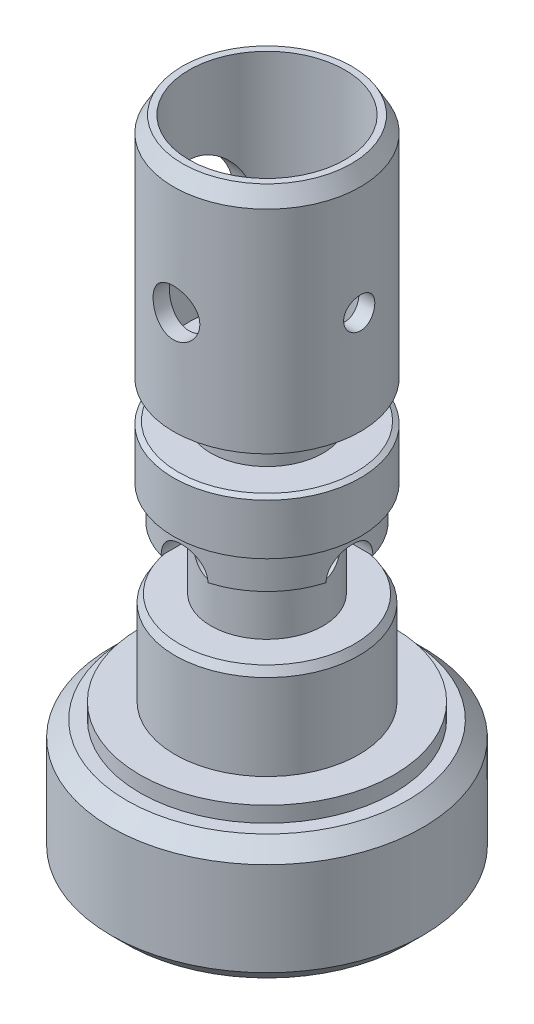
ISO-10303-21;
HEADER;
FILE_DESCRIPTION(('STEP AP214'),'2;1');
FILE_NAME('part.step','',(''),(''),'','','');
FILE_SCHEMA(('AUTOMOTIVE_DESIGN { 1 0 10303 214 1 1 1 1 }'));
ENDSEC;
DATA;
#1=APPLICATION_CONTEXT('core data for automotive mechanical design processes');
#2=APPLICATION_PROTOCOL_DEFINITION('international standard','automotive_design',2000,#1);
#3=PRODUCT_CONTEXT('',#1,'mechanical');
#4=PRODUCT('Part','Part','',(#3));
#5=PRODUCT_RELATED_PRODUCT_CATEGORY('part','',(#4));
#6=PRODUCT_DEFINITION_FORMATION('','',#4);
#7=PRODUCT_DEFINITION_CONTEXT('part definition',#1,'design');
#8=PRODUCT_DEFINITION('design','',#6,#7);
#9=PRODUCT_DEFINITION_SHAPE('','',#8);
#10=(LENGTH_UNIT() NAMED_UNIT(*) SI_UNIT(.MILLI.,.METRE.));
#11=(NAMED_UNIT(*) PLANE_ANGLE_UNIT() SI_UNIT($,.RADIAN.));
#12=(NAMED_UNIT(*) SI_UNIT($,.STERADIAN.) SOLID_ANGLE_UNIT());
#13=UNCERTAINTY_MEASURE_WITH_UNIT(LENGTH_MEASURE(1.E-05),#10,'distance_accuracy_value','');
#14=(GEOMETRIC_REPRESENTATION_CONTEXT(3) GLOBAL_UNCERTAINTY_ASSIGNED_CONTEXT((#13)) GLOBAL_UNIT_ASSIGNED_CONTEXT((#10,
#11,#12)) REPRESENTATION_CONTEXT('',''));
#15=CARTESIAN_POINT('',(0.,0.,0.));
#16=DIRECTION('',(0.,0.,1.));
#17=DIRECTION('',(1.,0.,0.));
#18=AXIS2_PLACEMENT_3D('',#15,#16,#17);
#19=CARTESIAN_POINT('',(0.,100.,0.));
#20=DIRECTION('',(0.,1.,0.));
#21=DIRECTION('',(0.,0.,1.));
#22=AXIS2_PLACEMENT_3D('',#19,#20,#21);
#23=CYLINDRICAL_SURFACE('',#22,5.99999999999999);
#24=CARTESIAN_POINT('',(0.,-9.50000000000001,5.99999999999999));
#25=CARTESIAN_POINT('',(-0.0828760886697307,-9.49999767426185,5.99999859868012));
#26=CARTESIAN_POINT('',(-0.165778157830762,-9.49310844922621,5.99826578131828));
#27=CARTESIAN_POINT('',(-0.329206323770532,-9.46577484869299,5.99152113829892));
#28=CARTESIAN_POINT('',(-0.409731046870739,-9.44532279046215,5.98650745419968));
#29=CARTESIAN_POINT('',(-0.566020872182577,-9.39156074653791,5.97375626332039));
#30=CARTESIAN_POINT('',(-0.641791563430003,-9.35826620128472,5.96602202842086));
#31=CARTESIAN_POINT('',(-0.786672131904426,-9.27981860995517,5.94865343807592));
#32=CARTESIAN_POINT('',(-0.855781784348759,-9.23466516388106,5.9390190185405));
#33=CARTESIAN_POINT('',(-0.986801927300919,-9.13279921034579,5.91867413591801));
#34=CARTESIAN_POINT('',(-1.04855569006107,-9.07588842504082,5.90794707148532));
#35=CARTESIAN_POINT('',(-1.1617489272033,-8.95254779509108,5.88673620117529));
#36=CARTESIAN_POINT('',(-1.21318723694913,-8.8861168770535,5.87625242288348));
#37=CARTESIAN_POINT('',(-1.30502654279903,-8.74440477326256,5.8565477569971));
#38=CARTESIAN_POINT('',(-1.34525221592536,-8.6690067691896,5.84734794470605));
#39=CARTESIAN_POINT('',(-1.41239690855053,-8.51225158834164,5.83149494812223));
#40=CARTESIAN_POINT('',(-1.43931805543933,-8.43089536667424,5.82484135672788));
#41=CARTESIAN_POINT('',(-1.47855483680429,-8.26625650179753,5.8150047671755));
#42=CARTESIAN_POINT('',(-1.49115226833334,-8.1830451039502,5.81175491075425));
#43=CARTESIAN_POINT('',(-1.50226177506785,-8.01563143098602,5.8088936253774));
#44=CARTESIAN_POINT('',(-1.50077614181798,-7.93142931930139,5.80928160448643));
#45=CARTESIAN_POINT('',(-1.48398652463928,-7.76658419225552,5.81359205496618));
#46=CARTESIAN_POINT('',(-1.46901834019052,-7.6859043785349,5.81742863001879));
#47=CARTESIAN_POINT('',(-1.42622418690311,-7.52823894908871,5.82806709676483));
#48=CARTESIAN_POINT('',(-1.39839730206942,-7.45125359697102,5.83486919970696));
#49=CARTESIAN_POINT('',(-1.33038947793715,-7.30226198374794,5.85075113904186));
#50=CARTESIAN_POINT('',(-1.29008666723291,-7.23031382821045,5.85985327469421));
#51=CARTESIAN_POINT('',(-1.19835627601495,-7.09408129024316,5.87929710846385));
#52=CARTESIAN_POINT('',(-1.14692674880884,-7.02979825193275,5.88963902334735));
#53=CARTESIAN_POINT('',(-1.03266342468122,-6.9087963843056,5.9107588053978));
#54=CARTESIAN_POINT('',(-0.96954625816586,-6.85234550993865,5.92154069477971));
#55=CARTESIAN_POINT('',(-0.8346119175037,-6.7507787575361,5.94205965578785));
#56=CARTESIAN_POINT('',(-0.762794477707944,-6.70566322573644,5.95179669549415));
#57=CARTESIAN_POINT('',(-0.612115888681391,-6.62794941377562,5.96917732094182));
#58=CARTESIAN_POINT('',(-0.533231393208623,-6.59539465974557,5.97681360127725));
#59=CARTESIAN_POINT('',(-0.370876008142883,-6.54408269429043,5.98907916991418));
#60=CARTESIAN_POINT('',(-0.287405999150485,-6.52532284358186,5.9937090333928));
#61=CARTESIAN_POINT('',(-0.120539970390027,-6.50254243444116,5.99935499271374));
#62=CARTESIAN_POINT('',(-0.0371967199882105,-6.4981569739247,6.00046053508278));
#63=CARTESIAN_POINT('',(0.129032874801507,-6.50324900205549,5.9991880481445));
#64=CARTESIAN_POINT('',(0.211919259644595,-6.51272524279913,5.99681033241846));
#65=CARTESIAN_POINT('',(0.373614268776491,-6.54497090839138,5.98889581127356));
#66=CARTESIAN_POINT('',(0.452465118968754,-6.56754126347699,5.98340634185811));
#67=CARTESIAN_POINT('',(0.60525729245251,-6.62510708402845,5.96988706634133));
#68=CARTESIAN_POINT('',(0.679198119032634,-6.66010380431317,5.96185700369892));
#69=CARTESIAN_POINT('',(0.821523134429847,-6.74223612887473,5.9439330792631));
#70=CARTESIAN_POINT('',(0.88978544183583,-6.78957611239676,5.93400867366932));
#71=CARTESIAN_POINT('',(1.01752661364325,-6.89478990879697,5.91344509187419));
#72=CARTESIAN_POINT('',(1.07700395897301,-6.95266553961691,5.90280579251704));
#73=CARTESIAN_POINT('',(1.18699056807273,-7.07900196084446,5.88168956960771));
#74=CARTESIAN_POINT('',(1.23724386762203,-7.14768770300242,5.87122304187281));
#75=CARTESIAN_POINT('',(1.3255107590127,-7.29273263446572,5.85192878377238));
#76=CARTESIAN_POINT('',(1.36352489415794,-7.36909148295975,5.84310098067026));
#77=CARTESIAN_POINT('',(1.42595142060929,-7.52690572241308,5.82818094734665));
#78=CARTESIAN_POINT('',(1.45044439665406,-7.60832762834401,5.82207255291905));
#79=CARTESIAN_POINT('',(1.48534565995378,-7.77430963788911,5.81326744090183));
#80=CARTESIAN_POINT('',(1.49575702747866,-7.85886905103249,5.81056997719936));
#81=CARTESIAN_POINT('',(1.50203859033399,-8.0261210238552,5.80894901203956));
#82=CARTESIAN_POINT('',(1.49831789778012,-8.10879743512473,5.80991932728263));
#83=CARTESIAN_POINT('',(1.47737727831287,-8.27230388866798,5.81527909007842));
#84=CARTESIAN_POINT('',(1.46015762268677,-8.35313396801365,5.81966846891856));
#85=CARTESIAN_POINT('',(1.41293131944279,-8.51020845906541,5.83131260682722));
#86=CARTESIAN_POINT('',(1.38300140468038,-8.58647730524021,5.83855015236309));
#87=CARTESIAN_POINT('',(1.31126491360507,-8.73296538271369,5.85507755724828));
#88=CARTESIAN_POINT('',(1.26945669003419,-8.80318377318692,5.86436770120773));
#89=CARTESIAN_POINT('',(1.17386774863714,-8.93755462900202,5.88425634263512));
#90=CARTESIAN_POINT('',(1.11980316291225,-9.00150107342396,5.89488264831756));
#91=CARTESIAN_POINT('',(1.00178937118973,-9.11954704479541,5.91608027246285));
#92=CARTESIAN_POINT('',(0.937837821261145,-9.17364423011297,5.92665157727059));
#93=CARTESIAN_POINT('',(0.80046758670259,-9.27141130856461,5.94677655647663));
#94=CARTESIAN_POINT('',(0.726898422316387,-9.31487461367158,5.95630833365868));
#95=CARTESIAN_POINT('',(0.573266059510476,-9.38874746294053,5.97304924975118));
#96=CARTESIAN_POINT('',(0.49320756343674,-9.41916636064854,5.98026005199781));
#97=CARTESIAN_POINT('',(0.344410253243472,-9.46157183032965,5.99048059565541));
#98=CARTESIAN_POINT('',(0.276380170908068,-9.47595124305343,5.9940258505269));
#99=CARTESIAN_POINT('',(0.138906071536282,-9.49516594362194,5.99878605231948));
#100=CARTESIAN_POINT('',(0.0694621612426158,-9.50000194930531,6.00000117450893));
#101=CARTESIAN_POINT('',(0.,-9.50000000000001,5.99999999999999));
#102=B_SPLINE_CURVE_WITH_KNOTS('',3,(#24,#25,#26,#27,#28,#29,#30,#31,#32,#33,#34,#35,#36,#37,
#38,#39,#40,#41,#42,#43,#44,#45,#46,#47,#48,#49,#50,#51,#52,#53,#54,#55,#56,#57,#58,#59,#60,#61,
#62,#63,#64,#65,#66,#67,#68,#69,#70,#71,#72,#73,#74,#75,#76,#77,#78,#79,#80,#81,#82,#83,#84,#85,
#86,#87,#88,#89,#90,#91,#92,#93,#94,#95,#96,#97,#98,#99,#100,#101),.UNSPECIFIED.,.T.,.F.,(4,2,2,
2,2,2,2,2,2,2,2,2,2,2,2,2,2,2,2,2,2,2,2,2,2,2,2,2,2,2,2,2,2,2,2,2,2,2,4),(0.,0.248373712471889,
0.4968882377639,0.745104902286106,0.993329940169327,1.24614435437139,1.49898729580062,
1.75558647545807,2.01214461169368,2.2635629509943,2.51494038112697,2.76022497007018,
3.00552703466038,3.25330527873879,3.50112690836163,3.75601500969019,4.01091089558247,
4.26668229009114,4.52240473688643,4.77158308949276,5.02073901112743,5.26620274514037,
5.5116912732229,5.76153587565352,6.01142363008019,6.26744509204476,6.52345518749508,
6.77792254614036,7.03233423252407,7.27943780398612,7.52653640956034,7.77216400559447,
8.01782568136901,8.2698957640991,8.52202569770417,8.77872185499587,9.03523363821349,
9.24342242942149,9.45159556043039),.UNSPECIFIED.);
#103=CARTESIAN_POINT('',(0.,-9.50000000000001,5.99999999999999));
#104=VERTEX_POINT('',#103);
#105=EDGE_CURVE('E481',#104,#104,#102,.T.);
#106=ORIENTED_EDGE('',*,*,#105,.T.);
#107=EDGE_LOOP('',(#106));
#108=FACE_BOUND('',#107,.T.);
#109=CARTESIAN_POINT('',(0.500000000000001,-8.,-5.97913037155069));
#110=CARTESIAN_POINT('',(0.499998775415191,-8.0280328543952,-5.9791306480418));
#111=CARTESIAN_POINT('',(0.497634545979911,-8.05608479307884,-5.97932963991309));
#112=CARTESIAN_POINT('',(0.488237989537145,-8.11141251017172,-5.98010409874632));
#113=CARTESIAN_POINT('',(0.481200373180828,-8.13868737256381,-5.98067999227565));
#114=CARTESIAN_POINT('',(0.462661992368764,-8.19165159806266,-5.98214257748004));
#115=CARTESIAN_POINT('',(0.451163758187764,-8.21734185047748,-5.98302909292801));
#116=CARTESIAN_POINT('',(0.424035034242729,-8.26642159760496,-5.98501281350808));
#117=CARTESIAN_POINT('',(0.408405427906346,-8.28981158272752,-5.98610997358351));
#118=CARTESIAN_POINT('',(0.373414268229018,-8.33369300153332,-5.98839452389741));
#119=CARTESIAN_POINT('',(0.35404430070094,-8.35417771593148,-5.98958211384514));
#120=CARTESIAN_POINT('',(0.312140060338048,-8.39160938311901,-5.99191188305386));
#121=CARTESIAN_POINT('',(0.28960564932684,-8.40855618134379,-5.99305406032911));
#122=CARTESIAN_POINT('',(0.241972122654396,-8.43845330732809,-5.99516620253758));
#123=CARTESIAN_POINT('',(0.216869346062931,-8.45139782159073,-5.99613591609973));
#124=CARTESIAN_POINT('',(0.164837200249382,-8.47288574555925,-5.99779171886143));
#125=CARTESIAN_POINT('',(0.137907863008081,-8.4814292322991,-5.99847781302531));
#126=CARTESIAN_POINT('',(0.083053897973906,-8.49385324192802,-5.99948767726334));
#127=CARTESIAN_POINT('',(0.0551317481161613,-8.49774463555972,-5.99981229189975));
#128=CARTESIAN_POINT('',(-0.000971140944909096,-8.5007876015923,-6.00006548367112));
#129=CARTESIAN_POINT('',(-0.0291518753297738,-8.49993926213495,-5.9999940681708));
#130=CARTESIAN_POINT('',(-0.0848982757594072,-8.49353573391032,-5.99946394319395));
#131=CARTESIAN_POINT('',(-0.112465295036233,-8.4879922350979,-5.99900619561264));
#132=CARTESIAN_POINT('',(-0.166276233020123,-8.47237392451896,-5.99775599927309));
#133=CARTESIAN_POINT('',(-0.192520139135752,-8.46229906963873,-5.99696354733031));
#134=CARTESIAN_POINT('',(-0.242977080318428,-8.43789100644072,-5.99513143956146));
#135=CARTESIAN_POINT('',(-0.267187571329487,-8.42355256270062,-5.99409148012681));
#136=CARTESIAN_POINT('',(-0.312862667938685,-8.39102813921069,-5.99188122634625));
#137=CARTESIAN_POINT('',(-0.334327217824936,-8.3728420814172,-5.99071092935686));
#138=CARTESIAN_POINT('',(-0.373969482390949,-8.33307278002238,-5.98836732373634));
#139=CARTESIAN_POINT('',(-0.392137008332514,-8.3114793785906,-5.98719401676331));
#140=CARTESIAN_POINT('',(-0.424590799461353,-8.26554374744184,-5.98498020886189));
#141=CARTESIAN_POINT('',(-0.438877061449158,-8.24120151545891,-5.98393970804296));
#142=CARTESIAN_POINT('',(-0.463162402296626,-8.1904520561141,-5.98210913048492));
#143=CARTESIAN_POINT('',(-0.473160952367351,-8.16404457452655,-5.98131908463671));
#144=CARTESIAN_POINT('',(-0.488579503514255,-8.1099176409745,-5.9800794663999));
#145=CARTESIAN_POINT('',(-0.493999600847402,-8.0821982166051,-5.9796298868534));
#146=CARTESIAN_POINT('',(-0.500094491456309,-8.02632340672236,-5.97912326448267));
#147=CARTESIAN_POINT('',(-0.500783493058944,-7.99816958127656,-5.97906504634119));
#148=CARTESIAN_POINT('',(-0.497433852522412,-7.94214682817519,-5.97934463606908));
#149=CARTESIAN_POINT('',(-0.493395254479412,-7.91427789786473,-5.97968244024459));
#150=CARTESIAN_POINT('',(-0.480716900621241,-7.85965682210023,-5.98071494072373));
#151=CARTESIAN_POINT('',(-0.472083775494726,-7.83290312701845,-5.98140912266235));
#152=CARTESIAN_POINT('',(-0.45046817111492,-7.78122395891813,-5.98307573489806));
#153=CARTESIAN_POINT('',(-0.437485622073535,-7.75629851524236,-5.98404816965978));
#154=CARTESIAN_POINT('',(-0.407503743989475,-7.70891837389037,-5.98616456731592));
#155=CARTESIAN_POINT('',(-0.390494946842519,-7.68646968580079,-5.98730893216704));
#156=CARTESIAN_POINT('',(-0.352957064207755,-7.64474102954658,-5.98963888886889));
#157=CARTESIAN_POINT('',(-0.332427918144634,-7.62546111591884,-5.99082448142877));
#158=CARTESIAN_POINT('',(-0.288370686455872,-7.59056879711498,-5.99310680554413));
#159=CARTESIAN_POINT('',(-0.264835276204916,-7.57496562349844,-5.99420330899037));
#160=CARTESIAN_POINT('',(-0.215470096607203,-7.54793304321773,-5.99618061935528));
#161=CARTESIAN_POINT('',(-0.189640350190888,-7.53650359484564,-5.99706142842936));
#162=CARTESIAN_POINT('',(-0.136452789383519,-7.51815875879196,-5.99850705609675));
#163=CARTESIAN_POINT('',(-0.109096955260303,-7.51123766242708,-5.99907227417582));
#164=CARTESIAN_POINT('',(-0.0536065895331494,-7.50208733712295,-5.99982465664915));
#165=CARTESIAN_POINT('',(-0.0254720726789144,-7.49985801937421,-6.00001182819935));
#166=CARTESIAN_POINT('',(0.0306860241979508,-7.50015556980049,-5.9999870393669));
#167=CARTESIAN_POINT('',(0.0587096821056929,-7.50266805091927,-5.99977628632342));
#168=CARTESIAN_POINT('',(0.113935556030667,-7.51234787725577,-5.99898171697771));
#169=CARTESIAN_POINT('',(0.14113777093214,-7.51951522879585,-5.99839790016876));
#170=CARTESIAN_POINT('',(0.193949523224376,-7.53829768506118,-5.99692270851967));
#171=CARTESIAN_POINT('',(0.21955915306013,-7.54991253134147,-5.99603135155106));
#172=CARTESIAN_POINT('',(0.268467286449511,-7.57725862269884,-5.99404079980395));
#173=CARTESIAN_POINT('',(0.291765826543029,-7.5929898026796,-5.99294160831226));
#174=CARTESIAN_POINT('',(0.33546404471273,-7.62817600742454,-5.99065479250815));
#175=CARTESIAN_POINT('',(0.355855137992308,-7.64764167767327,-5.98946692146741));
#176=CARTESIAN_POINT('',(0.393088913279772,-7.68972508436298,-5.98713872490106));
#177=CARTESIAN_POINT('',(0.409930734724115,-7.71234358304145,-5.98599841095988));
#178=CARTESIAN_POINT('',(0.439610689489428,-7.76013450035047,-5.98389212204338));
#179=CARTESIAN_POINT('',(0.452441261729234,-7.78531162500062,-5.98292647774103));
#180=CARTESIAN_POINT('',(0.473676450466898,-7.8374537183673,-5.98128289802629));
#181=CARTESIAN_POINT('',(0.482086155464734,-7.86441659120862,-5.9806046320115));
#182=CARTESIAN_POINT('',(0.492099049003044,-7.9096154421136,-5.97978704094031));
#183=CARTESIAN_POINT('',(0.495057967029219,-7.92756072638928,-5.97954192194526));
#184=CARTESIAN_POINT('',(0.49900883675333,-7.96366800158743,-5.97921349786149));
#185=CARTESIAN_POINT('',(0.500000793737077,-7.9818299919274,-5.97913019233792));
#186=CARTESIAN_POINT('',(0.500000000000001,-8.,-5.97913037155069));
#187=B_SPLINE_CURVE_WITH_KNOTS('',3,(#109,#110,#111,#112,#113,#114,#115,#116,#117,#118,#119,
#120,#121,#122,#123,#124,#125,#126,#127,#128,#129,#130,#131,#132,#133,#134,#135,#136,#137,#138,
#139,#140,#141,#142,#143,#144,#145,#146,#147,#148,#149,#150,#151,#152,#153,#154,#155,#156,#157,
#158,#159,#160,#161,#162,#163,#164,#165,#166,#167,#168,#169,#170,#171,#172,#173,#174,#175,#176,
#177,#178,#179,#180,#181,#182,#183,#184,#185,#186),.UNSPECIFIED.,.T.,.F.,(4,2,2,2,2,2,2,2,2,2,2,
2,2,2,2,2,2,2,2,2,2,2,2,2,2,2,2,2,2,2,2,2,2,2,2,2,2,2,4),(0.,0.0840322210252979,
0.168159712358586,0.252239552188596,0.336301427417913,0.420554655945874,0.504811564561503,
0.589190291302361,0.673567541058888,0.757747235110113,0.841925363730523,0.925894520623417,
1.00986447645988,1.09393797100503,1.17801317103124,1.26234392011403,1.34667473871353,
1.4310159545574,1.51535539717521,1.59944144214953,1.68352670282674,1.76749094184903,
1.85145652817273,1.93562156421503,2.01978804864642,2.10416365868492,2.18853842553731,
2.27280614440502,2.35707226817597,2.44108313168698,2.525094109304,2.60910020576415,
2.69310497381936,2.77735286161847,2.86162115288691,2.94604734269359,3.03037614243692,
3.084843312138,3.13931033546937),.UNSPECIFIED.);
#188=CARTESIAN_POINT('',(0.500000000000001,-8.,-5.97913037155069));
#189=VERTEX_POINT('',#188);
#190=EDGE_CURVE('E473',#189,#189,#187,.T.);
#191=ORIENTED_EDGE('',*,*,#190,.F.);
#192=EDGE_LOOP('',(#191));
#193=FACE_BOUND('',#192,.T.);
#194=CARTESIAN_POINT('',(0.,-0.999999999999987,0.));
#195=DIRECTION('',(0.,1.,0.));
#196=DIRECTION('',(0.,0.,1.));
#197=AXIS2_PLACEMENT_3D('',#194,#195,#196);
#198=CIRCLE('',#197,5.99999999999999);
#199=CARTESIAN_POINT('',(0.,-0.999999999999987,5.99999999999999));
#200=VERTEX_POINT('',#199);
#201=EDGE_CURVE('E667',#200,#200,#198,.F.);
#202=ORIENTED_EDGE('',*,*,#201,.T.);
#203=EDGE_LOOP('',(#202));
#204=FACE_BOUND('',#203,.T.);
#205=CARTESIAN_POINT('',(0.,-14.6,0.));
#206=DIRECTION('',(0.,1.,0.));
#207=DIRECTION('',(0.,0.,1.));
#208=AXIS2_PLACEMENT_3D('',#205,#206,#207);
#209=CIRCLE('',#208,5.99999999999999);
#210=CARTESIAN_POINT('',(0.,-14.6,5.99999999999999));
#211=VERTEX_POINT('',#210);
#212=EDGE_CURVE('E716',#211,#211,#209,.T.);
#213=ORIENTED_EDGE('',*,*,#212,.T.);
#214=EDGE_LOOP('',(#213));
#215=FACE_BOUND('',#214,.T.);
#216=CARTESIAN_POINT('',(-5.19615242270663,-8.,-3.));
#217=CARTESIAN_POINT('',(-5.19615338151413,-8.0782002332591,-2.99999910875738));
#218=CARTESIAN_POINT('',(-5.19792581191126,-8.15640999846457,-2.99693611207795));
#219=CARTESIAN_POINT('',(-5.20493931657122,-8.31220807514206,-2.98473565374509));
#220=CARTESIAN_POINT('',(-5.21018200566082,-8.3897960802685,-2.97559536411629));
#221=CARTESIAN_POINT('',(-5.23088200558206,-8.62094401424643,-2.9391691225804));
#222=CARTESIAN_POINT('',(-5.25131076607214,-8.77275091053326,-2.902878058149));
#223=CARTESIAN_POINT('',(-5.30247746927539,-9.06639163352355,-2.80829998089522));
#224=CARTESIAN_POINT('',(-5.33316051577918,-9.2082738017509,-2.75012989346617));
#225=CARTESIAN_POINT('',(-5.40128072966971,-9.48026276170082,-2.61380253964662));
#226=CARTESIAN_POINT('',(-5.43871826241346,-9.61036891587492,-2.53564419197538));
#227=CARTESIAN_POINT('',(-5.51990583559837,-9.86692014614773,-2.35399963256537));
#228=CARTESIAN_POINT('',(-5.5639218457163,-9.99217820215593,-2.24895611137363));
#229=CARTESIAN_POINT('',(-5.65115954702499,-10.2242243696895,-2.01976141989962));
#230=CARTESIAN_POINT('',(-5.6943808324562,-10.3310032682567,-1.89560077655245));
#231=CARTESIAN_POINT('',(-5.77864428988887,-10.5301016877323,-1.62146869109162));
#232=CARTESIAN_POINT('',(-5.81934318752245,-10.6209613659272,-1.47032156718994));
#233=CARTESIAN_POINT('',(-5.89052268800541,-10.7754224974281,-1.15247107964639));
#234=CARTESIAN_POINT('',(-5.92100973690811,-10.8390411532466,-0.985777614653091));
#235=CARTESIAN_POINT('',(-5.96641383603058,-10.9325139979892,-0.654134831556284));
#236=CARTESIAN_POINT('',(-5.98228440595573,-10.9644485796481,-0.489905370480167));
#237=CARTESIAN_POINT('',(-6.00022751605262,-11.000498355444,-0.157711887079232));
#238=CARTESIAN_POINT('',(-6.00230840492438,-11.0046303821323,0.0102498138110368));
#239=CARTESIAN_POINT('',(-5.9928894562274,-10.9857599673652,0.329497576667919));
#240=CARTESIAN_POINT('',(-5.98255487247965,-10.965085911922,0.480963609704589));
#241=CARTESIAN_POINT('',(-5.9512273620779,-10.9013575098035,0.77794130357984));
#242=CARTESIAN_POINT('',(-5.93023363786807,-10.8583014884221,0.923452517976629));
#243=CARTESIAN_POINT('',(-5.87914748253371,-10.7507521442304,1.20692822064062));
#244=CARTESIAN_POINT('',(-5.84893318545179,-10.6859704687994,1.34476044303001));
#245=CARTESIAN_POINT('',(-5.78212944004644,-10.5372103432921,1.60793023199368));
#246=CARTESIAN_POINT('',(-5.74553771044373,-10.4532250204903,1.73326330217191));
#247=CARTESIAN_POINT('',(-5.66533158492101,-10.2593115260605,1.98052168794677));
#248=CARTESIAN_POINT('',(-5.62138031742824,-10.1476814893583,2.10100497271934));
#249=CARTESIAN_POINT('',(-5.53363118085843,-9.90624025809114,2.32231036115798));
#250=CARTESIAN_POINT('',(-5.48983345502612,-9.77641520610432,2.42311733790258));
#251=CARTESIAN_POINT('',(-5.40432084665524,-9.49201785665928,2.6085269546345));
#252=CARTESIAN_POINT('',(-5.36291485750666,-9.33639756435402,2.691694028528));
#253=CARTESIAN_POINT('',(-5.30915194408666,-9.09243694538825,2.79542837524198));
#254=CARTESIAN_POINT('',(-5.29261946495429,-9.00934368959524,2.82650797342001));
#255=CARTESIAN_POINT('',(-5.26298473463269,-8.84019139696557,2.88131297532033));
#256=CARTESIAN_POINT('',(-5.24988036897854,-8.75413422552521,2.90504291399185));
#257=CARTESIAN_POINT('',(-5.22855455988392,-8.58662837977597,2.94323927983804));
#258=CARTESIAN_POINT('',(-5.22002982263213,-8.50535057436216,2.95828810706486));
#259=CARTESIAN_POINT('',(-5.2067273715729,-8.34156476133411,2.98163903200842));
#260=CARTESIAN_POINT('',(-5.20194770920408,-8.25905741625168,2.98994463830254));
#261=CARTESIAN_POINT('',(-5.19633662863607,-8.0935289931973,2.99968663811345));
#262=CARTESIAN_POINT('',(-5.19550374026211,-8.0105081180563,3.00112558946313));
#263=CARTESIAN_POINT('',(-5.19780953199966,-7.84471353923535,2.99712742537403));
#264=CARTESIAN_POINT('',(-5.20094794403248,-7.76193981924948,2.99169077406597));
#265=CARTESIAN_POINT('',(-5.21504493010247,-7.53314086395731,2.96710135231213));
#266=CARTESIAN_POINT('',(-5.23019160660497,-7.38808918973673,2.9405616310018));
#267=CARTESIAN_POINT('',(-5.27081666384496,-7.10486908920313,2.86709067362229));
#268=CARTESIAN_POINT('',(-5.29629839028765,-6.96670290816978,2.82015283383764));
#269=CARTESIAN_POINT('',(-5.35608780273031,-6.69377389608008,2.70494224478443));
#270=CARTESIAN_POINT('',(-5.3907496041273,-6.5594650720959,2.63578205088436));
#271=CARTESIAN_POINT('',(-5.46468327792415,-6.30359006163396,2.47886133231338));
#272=CARTESIAN_POINT('',(-5.50395751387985,-6.18203046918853,2.39109125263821));
#273=CARTESIAN_POINT('',(-5.58864005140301,-5.93906437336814,2.18651145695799));
#274=CARTESIAN_POINT('',(-5.63419752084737,-5.81960872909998,2.067435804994));
#275=CARTESIAN_POINT('',(-5.72202702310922,-5.60176310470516,1.8102134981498));
#276=CARTESIAN_POINT('',(-5.76429794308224,-5.5033802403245,1.67206042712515));
#277=CARTESIAN_POINT('',(-5.84224085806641,-5.32827887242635,1.37560608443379));
#278=CARTESIAN_POINT('',(-5.87770925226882,-5.25220065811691,1.21686929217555));
#279=CARTESIAN_POINT('',(-5.93650064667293,-5.12858627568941,0.886567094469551));
#280=CARTESIAN_POINT('',(-5.95983430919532,-5.08102504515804,0.715013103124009));
#281=CARTESIAN_POINT('',(-5.99002524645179,-5.01989430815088,0.380939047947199));
#282=CARTESIAN_POINT('',(-5.99819783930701,-5.00360636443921,0.219034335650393));
#283=CARTESIAN_POINT('',(-6.00126390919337,-4.99747021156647,-0.105377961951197));
#284=CARTESIAN_POINT('',(-5.99616203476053,-5.00761274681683,-0.267885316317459));
#285=CARTESIAN_POINT('',(-5.97401907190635,-5.05224919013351,-0.57761396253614));
#286=CARTESIAN_POINT('',(-5.95778686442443,-5.08509443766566,-0.725136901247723));
#287=CARTESIAN_POINT('',(-5.91576278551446,-5.17198110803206,-1.01233790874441));
#288=CARTESIAN_POINT('',(-5.88996954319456,-5.22602557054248,-1.15201484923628));
#289=CARTESIAN_POINT('',(-5.82977801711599,-5.35618072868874,-1.42627001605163));
#290=CARTESIAN_POINT('',(-5.79505887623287,-5.43313634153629,-1.56037465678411));
#291=CARTESIAN_POINT('',(-5.72064363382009,-5.60587542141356,-1.81432469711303));
#292=CARTESIAN_POINT('',(-5.6809452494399,-5.70166753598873,-1.93416350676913));
#293=CARTESIAN_POINT('',(-5.59585978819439,-5.92038472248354,-2.16873884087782));
#294=CARTESIAN_POINT('',(-5.55029975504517,-6.0450613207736,-2.28178066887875));
#295=CARTESIAN_POINT('',(-5.46188649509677,-6.31237832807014,-2.48600225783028));
#296=CARTESIAN_POINT('',(-5.41903568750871,-6.45503446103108,-2.57716267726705));
#297=CARTESIAN_POINT('',(-5.36004774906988,-6.68253179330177,-2.69665559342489));
#298=CARTESIAN_POINT('',(-5.34101219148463,-6.76197580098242,-2.73405408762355));
#299=CARTESIAN_POINT('',(-5.30572783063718,-6.92435328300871,-2.80191257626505));
#300=CARTESIAN_POINT('',(-5.28947759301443,-7.007284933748,-2.83237614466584));
#301=CARTESIAN_POINT('',(-5.26045215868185,-7.17584473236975,-2.88592624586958));
#302=CARTESIAN_POINT('',(-5.24766803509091,-7.26146530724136,-2.90903175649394));
#303=CARTESIAN_POINT('',(-5.22608869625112,-7.43485525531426,-2.9476242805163));
#304=CARTESIAN_POINT('',(-5.21729069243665,-7.52262308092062,-2.96311662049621));
#305=CARTESIAN_POINT('',(-5.20588528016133,-7.67539881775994,-2.9830938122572));
#306=CARTESIAN_POINT('',(-5.20224442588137,-7.74009480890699,-2.9894274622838));
#307=CARTESIAN_POINT('',(-5.19737751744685,-7.86985831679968,-2.99788106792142));
#308=CARTESIAN_POINT('',(-5.19615162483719,-7.93492585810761,-3.00000074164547));
#309=CARTESIAN_POINT('',(-5.19615242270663,-8.,-3.));
#310=B_SPLINE_CURVE_WITH_KNOTS('',3,(#216,#217,#218,#219,#220,#221,#222,#223,#224,#225,#226,
#227,#228,#229,#230,#231,#232,#233,#234,#235,#236,#237,#238,#239,#240,#241,#242,#243,#244,#245,
#246,#247,#248,#249,#250,#251,#252,#253,#254,#255,#256,#257,#258,#259,#260,#261,#262,#263,#264,
#265,#266,#267,#268,#269,#270,#271,#272,#273,#274,#275,#276,#277,#278,#279,#280,#281,#282,#283,
#284,#285,#286,#287,#288,#289,#290,#291,#292,#293,#294,#295,#296,#297,#298,#299,#300,#301,#302,
#303,#304,#305,#306,#307,#308,#309),.UNSPECIFIED.,.T.,.F.,(4,2,2,2,2,2,2,2,2,2,2,2,2,2,2,2,2,2,
2,2,2,2,2,2,2,2,2,2,2,2,2,2,2,2,2,2,2,2,2,2,2,2,2,2,2,2,4),(0.,0.234529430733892,
0.469168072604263,0.938850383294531,1.40605749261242,1.87328988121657,2.37905864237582,
2.88507883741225,3.42520847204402,3.96499651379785,4.46637625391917,4.96745241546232,
5.42495462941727,5.88249108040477,6.34635774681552,6.81039068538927,7.31828744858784,
7.82657315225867,8.36713695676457,8.63752916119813,8.90775419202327,9.15669600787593,
9.40550821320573,9.65422772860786,9.90293045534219,10.3454331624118,10.7880792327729,
11.2512265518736,11.7146122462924,12.2364099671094,12.7583836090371,13.29413310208,
13.8294110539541,14.3155757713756,14.8015702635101,15.2555404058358,15.7095756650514,
16.1830301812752,16.6567025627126,17.177514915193,17.6987859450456,17.9680115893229,
18.2370981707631,18.5054849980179,18.7736837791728,18.9688338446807,19.1639969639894),.UNSPECIFIED.);
#311=CARTESIAN_POINT('',(-5.19615242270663,-8.,-3.));
#312=VERTEX_POINT('',#311);
#313=EDGE_CURVE('E486',#312,#312,#310,.T.);
#314=ORIENTED_EDGE('',*,*,#313,.F.);
#315=EDGE_LOOP('',(#314));
#316=FACE_BOUND('',#315,.T.);
#317=CARTESIAN_POINT('',(5.91607978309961,-8.,1.));
#318=CARTESIAN_POINT('',(5.9160807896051,-7.94424970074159,0.999997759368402));
#319=CARTESIAN_POINT('',(5.91687637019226,-7.88846895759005,0.995322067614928));
#320=CARTESIAN_POINT('',(5.91996982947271,-7.77847258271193,0.976750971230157));
#321=CARTESIAN_POINT('',(5.9222690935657,-7.72425844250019,0.962847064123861));
#322=CARTESIAN_POINT('',(5.92810243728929,-7.61900308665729,0.926251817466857));
#323=CARTESIAN_POINT('',(5.9316354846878,-7.56795926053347,0.903567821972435));
#324=CARTESIAN_POINT('',(5.93953708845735,-7.47040761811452,0.850074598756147));
#325=CARTESIAN_POINT('',(5.94390555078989,-7.4238992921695,0.819266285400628));
#326=CARTESIAN_POINT('',(5.95303388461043,-7.33627486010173,0.75007501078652));
#327=CARTESIAN_POINT('',(5.95779686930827,-7.29520994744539,0.711627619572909));
#328=CARTESIAN_POINT('',(5.96714992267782,-7.22008267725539,0.628388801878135));
#329=CARTESIAN_POINT('',(5.97173998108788,-7.18602073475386,0.583596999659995));
#330=CARTESIAN_POINT('',(5.98026294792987,-7.12567417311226,0.488609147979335));
#331=CARTESIAN_POINT('',(5.9841917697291,-7.09943719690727,0.438382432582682));
#332=CARTESIAN_POINT('',(5.99091494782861,-7.05579157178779,0.334158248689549));
#333=CARTESIAN_POINT('',(5.99370937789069,-7.03838234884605,0.280161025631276));
#334=CARTESIAN_POINT('',(5.99782693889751,-7.01304298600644,0.170457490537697));
#335=CARTESIAN_POINT('',(5.99916341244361,-7.00502683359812,0.114771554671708));
#336=CARTESIAN_POINT('',(6.00026031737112,-6.99843369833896,0.00283011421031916));
#337=CARTESIAN_POINT('',(6.00002085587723,-6.99985607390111,-0.0534253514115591));
#338=CARTESIAN_POINT('',(5.99800343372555,-7.01203254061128,-0.16432087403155));
#339=CARTESIAN_POINT('',(5.99624073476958,-7.02269406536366,-0.218971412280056));
#340=CARTESIAN_POINT('',(5.99139191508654,-7.0529004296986,-0.325696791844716));
#341=CARTESIAN_POINT('',(5.98830575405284,-7.0724455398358,-0.377771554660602));
#342=CARTESIAN_POINT('',(5.98113079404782,-7.11995625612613,-0.478142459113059));
#343=CARTESIAN_POINT('',(5.97703746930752,-7.14796000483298,-0.526420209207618));
#344=CARTESIAN_POINT('',(5.96830295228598,-7.21156512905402,-0.617626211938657));
#345=CARTESIAN_POINT('',(5.96366171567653,-7.24716711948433,-0.66055403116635));
#346=CARTESIAN_POINT('',(5.95428107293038,-7.32547152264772,-0.740388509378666));
#347=CARTESIAN_POINT('',(5.94954115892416,-7.36825483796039,-0.777215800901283));
#348=CARTESIAN_POINT('',(5.94055183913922,-7.45943483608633,-0.843181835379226));
#349=CARTESIAN_POINT('',(5.93630243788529,-7.50783157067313,-0.872320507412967));
#350=CARTESIAN_POINT('',(5.92877501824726,-7.60895665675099,-0.922097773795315));
#351=CARTESIAN_POINT('',(5.9254980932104,-7.66168979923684,-0.942726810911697));
#352=CARTESIAN_POINT('',(5.92030475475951,-7.76993962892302,-0.974811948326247));
#353=CARTESIAN_POINT('',(5.91838822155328,-7.82545607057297,-0.986268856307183));
#354=CARTESIAN_POINT('',(5.91615583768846,-7.93698646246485,-0.999572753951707));
#355=CARTESIAN_POINT('',(5.91582114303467,-7.99298655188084,-1.00153288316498));
#356=CARTESIAN_POINT('',(5.91674013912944,-8.10451466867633,-0.996089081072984));
#357=CARTESIAN_POINT('',(5.91799376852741,-8.16004271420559,-0.988685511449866));
#358=CARTESIAN_POINT('',(5.92193074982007,-8.26869110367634,-0.964820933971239));
#359=CARTESIAN_POINT('',(5.92460500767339,-8.3218244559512,-0.948417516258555));
#360=CARTESIAN_POINT('',(5.931074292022,-8.4245880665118,-0.907079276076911));
#361=CARTESIAN_POINT('',(5.93486938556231,-8.47421811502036,-0.882143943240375));
#362=CARTESIAN_POINT('',(5.94319651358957,-8.56906983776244,-0.824182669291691));
#363=CARTESIAN_POINT('',(5.94773502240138,-8.61424662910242,-0.791084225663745));
#364=CARTESIAN_POINT('',(5.95701866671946,-8.698445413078,-0.717835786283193));
#365=CARTESIAN_POINT('',(5.96176381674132,-8.7374669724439,-0.677685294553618));
#366=CARTESIAN_POINT('',(5.97098568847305,-8.80866075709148,-0.590971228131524));
#367=CARTESIAN_POINT('',(5.97545910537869,-8.84075753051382,-0.544345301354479));
#368=CARTESIAN_POINT('',(5.98358044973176,-8.89666213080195,-0.446297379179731));
#369=CARTESIAN_POINT('',(5.9872284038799,-8.92047022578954,-0.394875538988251));
#370=CARTESIAN_POINT('',(5.99327343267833,-8.95900423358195,-0.288919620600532));
#371=CARTESIAN_POINT('',(5.99567593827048,-8.97376963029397,-0.234400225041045));
#372=CARTESIAN_POINT('',(5.99898233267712,-8.99392623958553,-0.123612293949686));
#373=CARTESIAN_POINT('',(5.9998863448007,-8.99931822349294,-0.0673439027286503));
#374=CARTESIAN_POINT('',(6.0000921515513,-9.00055275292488,0.0446165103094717));
#375=CARTESIAN_POINT('',(5.99941320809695,-8.99651010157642,0.100307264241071));
#376=CARTESIAN_POINT('',(5.99656871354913,-8.97923843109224,0.210204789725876));
#377=CARTESIAN_POINT('',(5.99440317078,-8.96600946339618,0.26441156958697));
#378=CARTESIAN_POINT('',(5.98882795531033,-8.9307847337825,0.369758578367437));
#379=CARTESIAN_POINT('',(5.98541966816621,-8.90879873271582,0.420902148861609));
#380=CARTESIAN_POINT('',(5.9777310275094,-8.85669682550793,0.518792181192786));
#381=CARTESIAN_POINT('',(5.97345063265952,-8.82658053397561,0.565538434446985));
#382=CARTESIAN_POINT('',(5.96443051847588,-8.7586659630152,0.653885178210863));
#383=CARTESIAN_POINT('',(5.95968609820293,-8.72078361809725,0.695420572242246));
#384=CARTESIAN_POINT('',(5.95030521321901,-8.63858867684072,0.771585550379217));
#385=CARTESIAN_POINT('',(5.94566877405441,-8.59427457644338,0.806213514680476));
#386=CARTESIAN_POINT('',(5.93699337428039,-8.50010187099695,0.867805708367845));
#387=CARTESIAN_POINT('',(5.93295887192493,-8.45020626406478,0.894713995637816));
#388=CARTESIAN_POINT('',(5.92599684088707,-8.34655630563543,0.939725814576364));
#389=CARTESIAN_POINT('',(5.92306820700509,-8.29280587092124,0.95783814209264));
#390=CARTESIAN_POINT('',(5.91929897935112,-8.19903849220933,0.980810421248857));
#391=CARTESIAN_POINT('',(5.91809849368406,-8.15958927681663,0.987994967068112));
#392=CARTESIAN_POINT('',(5.91648854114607,-8.08009860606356,0.997590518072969));
#393=CARTESIAN_POINT('',(5.9160790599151,-8.04005716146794,1.00000160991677));
#394=CARTESIAN_POINT('',(5.91607978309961,-8.,1.));
#395=B_SPLINE_CURVE_WITH_KNOTS('',3,(#317,#318,#319,#320,#321,#322,#323,#324,#325,#326,#327,
#328,#329,#330,#331,#332,#333,#334,#335,#336,#337,#338,#339,#340,#341,#342,#343,#344,#345,#346,
#347,#348,#349,#350,#351,#352,#353,#354,#355,#356,#357,#358,#359,#360,#361,#362,#363,#364,#365,
#366,#367,#368,#369,#370,#371,#372,#373,#374,#375,#376,#377,#378,#379,#380,#381,#382,#383,#384,
#385,#386,#387,#388,#389,#390,#391,#392,#393,#394),.UNSPECIFIED.,.T.,.F.,(4,2,2,2,2,2,2,2,2,2,2,
2,2,2,2,2,2,2,2,2,2,2,2,2,2,2,2,2,2,2,2,2,2,2,2,2,2,2,4),(0.,0.167104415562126,
0.334363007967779,0.501481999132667,0.668582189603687,0.83715663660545,1.00574107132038,
1.17533192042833,1.34491174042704,1.51292626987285,1.68092937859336,1.84726848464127,
2.01361265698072,2.18071841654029,2.34783770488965,2.51698449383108,2.68613284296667,
2.85547064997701,3.0247935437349,3.19209416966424,3.3593883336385,3.52562425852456,
3.69187012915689,3.8596493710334,4.02744041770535,4.19697645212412,4.36650700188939,
4.53529193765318,4.704062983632,4.87079110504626,5.03751829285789,5.20406015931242,
5.37060992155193,5.5390679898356,5.70756551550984,5.8772549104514,6.04677426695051,
6.16684268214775,6.28690891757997),.UNSPECIFIED.);
#396=CARTESIAN_POINT('',(5.91607978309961,-8.,1.));
#397=VERTEX_POINT('',#396);
#398=EDGE_CURVE('E493',#397,#397,#395,.T.);
#399=ORIENTED_EDGE('',*,*,#398,.T.);
#400=EDGE_LOOP('',(#399));
#401=FACE_BOUND('',#400,.T.);
#402=ADVANCED_FACE('F356',(#108,#193,#204,#215,#316,#401),#23,.T.);
#403=CARTESIAN_POINT('',(0.,-14.,0.));
#404=DIRECTION('',(0.,1.,0.));
#405=DIRECTION('',(0.,0.,1.));
#406=AXIS2_PLACEMENT_3D('',#403,#404,#405);
#407=CYLINDRICAL_SURFACE('',#406,5.);
#408=CARTESIAN_POINT('',(0.,-9.5,5.));
#409=CARTESIAN_POINT('',(-0.0822886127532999,-9.49999900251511,4.9999992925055));
#410=CARTESIAN_POINT('',(-0.164587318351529,-9.49320613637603,4.99794915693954));
#411=CARTESIAN_POINT('',(-0.326788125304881,-9.4662786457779,4.98997105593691));
#412=CARTESIAN_POINT('',(-0.40668950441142,-9.44614004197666,4.98404193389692));
#413=CARTESIAN_POINT('',(-0.561732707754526,-9.39325398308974,4.96895552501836));
#414=CARTESIAN_POINT('',(-0.636881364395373,-9.36052513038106,4.95980300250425));
#415=CARTESIAN_POINT('',(-0.780624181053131,-9.28346390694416,4.93922109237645));
#416=CARTESIAN_POINT('',(-0.849217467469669,-9.23912999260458,4.92779140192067));
#417=CARTESIAN_POINT('',(-0.979871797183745,-9.13877599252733,4.90350737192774));
#418=CARTESIAN_POINT('',(-1.04171807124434,-9.08248337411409,4.89062383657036));
#419=CARTESIAN_POINT('',(-1.15524920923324,-8.96039077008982,4.86505834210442));
#420=CARTESIAN_POINT('',(-1.20693236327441,-8.89458918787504,4.85237641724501));
#421=CARTESIAN_POINT('',(-1.29980037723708,-8.75352924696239,4.82834113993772));
#422=CARTESIAN_POINT('',(-1.34072309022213,-8.67809153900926,4.81702406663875));
#423=CARTESIAN_POINT('',(-1.4092139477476,-8.52101074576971,4.79743620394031));
#424=CARTESIAN_POINT('',(-1.43678529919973,-8.43936915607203,4.78916468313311));
#425=CARTESIAN_POINT('',(-1.47701633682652,-8.27460973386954,4.77690870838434));
#426=CARTESIAN_POINT('',(-1.49007196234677,-8.19159725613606,4.77281069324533));
#427=CARTESIAN_POINT('',(-1.50213730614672,-8.02446684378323,4.76902789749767));
#428=CARTESIAN_POINT('',(-1.50115042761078,-7.94034918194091,4.76934204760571));
#429=CARTESIAN_POINT('',(-1.48546977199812,-7.77661609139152,4.77424744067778));
#430=CARTESIAN_POINT('',(-1.47127205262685,-7.69694774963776,4.77868388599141));
#431=CARTESIAN_POINT('',(-1.43037420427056,-7.54118021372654,4.79108356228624));
#432=CARTESIAN_POINT('',(-1.40367284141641,-7.46508137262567,4.79904714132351));
#433=CARTESIAN_POINT('',(-1.33816026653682,-7.31739965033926,4.81772733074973));
#434=CARTESIAN_POINT('',(-1.29918816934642,-7.24589291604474,4.82848016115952));
#435=CARTESIAN_POINT('',(-1.21035222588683,-7.11026797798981,4.85150987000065));
#436=CARTESIAN_POINT('',(-1.16048574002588,-7.04615157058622,4.86378711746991));
#437=CARTESIAN_POINT('',(-1.04881290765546,-6.92431380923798,4.88911011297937));
#438=CARTESIAN_POINT('',(-0.986594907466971,-6.86697133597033,4.90216654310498));
#439=CARTESIAN_POINT('',(-0.853263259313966,-6.76344601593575,4.92712244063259));
#440=CARTESIAN_POINT('',(-0.782149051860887,-6.71726387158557,4.9390218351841));
#441=CARTESIAN_POINT('',(-0.632355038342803,-6.63714007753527,4.9604316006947));
#442=CARTESIAN_POINT('',(-0.55362774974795,-6.60328248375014,4.96992543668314));
#443=CARTESIAN_POINT('',(-0.39124541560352,-6.54940040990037,4.98533521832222));
#444=CARTESIAN_POINT('',(-0.307591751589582,-6.52937207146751,4.99125216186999));
#445=CARTESIAN_POINT('',(-0.140952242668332,-6.50434782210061,4.99868364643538));
#446=CARTESIAN_POINT('',(-0.058050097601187,-6.49883841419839,5.0003485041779));
#447=CARTESIAN_POINT('',(0.107499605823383,-6.50156915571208,4.9995292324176));
#448=CARTESIAN_POINT('',(0.19014719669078,-6.50980746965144,4.99704565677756));
#449=CARTESIAN_POINT('',(0.350903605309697,-6.5393846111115,4.98830696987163));
#450=CARTESIAN_POINT('',(0.42907277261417,-6.56042338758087,4.98213829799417));
#451=CARTESIAN_POINT('',(0.580754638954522,-6.6146432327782,4.96674347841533));
#452=CARTESIAN_POINT('',(0.654266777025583,-6.64782576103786,4.95751696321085));
#453=CARTESIAN_POINT('',(0.796437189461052,-6.72625316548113,4.93669654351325));
#454=CARTESIAN_POINT('',(0.86494382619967,-6.77175934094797,4.92505280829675));
#455=CARTESIAN_POINT('',(0.993523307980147,-6.87322475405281,4.90073468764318));
#456=CARTESIAN_POINT('',(1.05359403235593,-6.92918661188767,4.8880600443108));
#457=CARTESIAN_POINT('',(1.16585744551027,-7.05238730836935,4.86253171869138));
#458=CARTESIAN_POINT('',(1.21768481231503,-7.11996187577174,4.84968825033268));
#459=CARTESIAN_POINT('',(1.30928995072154,-7.26312793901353,4.82576515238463));
#460=CARTESIAN_POINT('',(1.34906803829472,-7.33871922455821,4.81468547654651));
#461=CARTESIAN_POINT('',(1.41517347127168,-7.49553249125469,4.79567189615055));
#462=CARTESIAN_POINT('',(1.4415634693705,-7.57672618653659,4.78772337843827));
#463=CARTESIAN_POINT('',(1.48021730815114,-7.74268796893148,4.77591594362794));
#464=CARTESIAN_POINT('',(1.49248598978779,-7.82745482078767,4.772055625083));
#465=CARTESIAN_POINT('',(1.50221984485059,-7.99436151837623,4.76899972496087));
#466=CARTESIAN_POINT('',(1.5002805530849,-8.07646365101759,4.76961647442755));
#467=CARTESIAN_POINT('',(1.48307505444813,-8.2391141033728,4.77499401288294));
#468=CARTESIAN_POINT('',(1.46780938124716,-8.31966248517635,4.77975463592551));
#469=CARTESIAN_POINT('',(1.42476888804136,-8.47594539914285,4.79275763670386));
#470=CARTESIAN_POINT('',(1.39715175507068,-8.55172728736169,4.80095604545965));
#471=CARTESIAN_POINT('',(1.33031507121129,-8.69764243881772,4.81990278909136));
#472=CARTESIAN_POINT('',(1.29109329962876,-8.76777461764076,4.83065161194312));
#473=CARTESIAN_POINT('',(1.20048763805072,-8.90316311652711,4.85397676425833));
#474=CARTESIAN_POINT('',(1.14871276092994,-8.96814876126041,4.86660540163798));
#475=CARTESIAN_POINT('',(1.03517434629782,-9.08870249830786,4.89201320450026));
#476=CARTESIAN_POINT('',(0.973408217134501,-9.14426813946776,4.90479240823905));
#477=CARTESIAN_POINT('',(0.839465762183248,-9.24602341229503,4.92950936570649));
#478=CARTESIAN_POINT('',(0.767037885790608,-9.29189144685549,4.94141159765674));
#479=CARTESIAN_POINT('',(0.61514137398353,-9.37073516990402,4.96260680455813));
#480=CARTESIAN_POINT('',(0.535676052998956,-9.40371688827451,4.97190099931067));
#481=CARTESIAN_POINT('',(0.380757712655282,-9.45289527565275,4.98602174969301));
#482=CARTESIAN_POINT('',(0.305786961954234,-9.47051167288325,4.99122027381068));
#483=CARTESIAN_POINT('',(0.15388019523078,-9.49406352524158,4.99820944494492));
#484=CARTESIAN_POINT('',(0.0769445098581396,-9.50000093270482,5.0000006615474));
#485=CARTESIAN_POINT('',(0.,-9.5,5.));
#486=B_SPLINE_CURVE_WITH_KNOTS('',3,(#408,#409,#410,#411,#412,#413,#414,#415,#416,#417,#418,
#419,#420,#421,#422,#423,#424,#425,#426,#427,#428,#429,#430,#431,#432,#433,#434,#435,#436,#437,
#438,#439,#440,#441,#442,#443,#444,#445,#446,#447,#448,#449,#450,#451,#452,#453,#454,#455,#456,
#457,#458,#459,#460,#461,#462,#463,#464,#465,#466,#467,#468,#469,#470,#471,#472,#473,#474,#475,
#476,#477,#478,#479,#480,#481,#482,#483,#484,#485),.UNSPECIFIED.,.T.,.F.,(4,2,2,2,2,2,2,2,2,2,2,
2,2,2,2,2,2,2,2,2,2,2,2,2,2,2,2,2,2,2,2,2,2,2,2,2,2,2,4),(0.,0.24658320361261,0.493239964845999,
0.739533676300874,0.985860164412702,1.23855602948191,1.49129437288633,1.74971481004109,
2.00807314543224,2.25919689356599,2.51025978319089,2.75226016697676,2.99428443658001,
3.23962426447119,3.48502360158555,3.74067104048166,3.99633456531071,4.25371046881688,
4.51101453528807,4.75908809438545,5.00712853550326,5.24956746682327,5.49203554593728,
5.74011305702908,5.98825282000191,6.24540400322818,6.5025484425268,6.75847814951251,
7.01432009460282,7.25950155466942,7.504673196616,7.74680040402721,7.98897397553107,
8.2399692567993,8.49102974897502,8.7494299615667,9.00770911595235,9.23831691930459,
9.46888616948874),.UNSPECIFIED.);
#487=CARTESIAN_POINT('',(0.,-9.5,5.));
#488=VERTEX_POINT('',#487);
#489=EDGE_CURVE('E491',#488,#488,#486,.T.);
#490=ORIENTED_EDGE('',*,*,#489,.F.);
#491=EDGE_LOOP('',(#490));
#492=FACE_BOUND('',#491,.T.);
#493=CARTESIAN_POINT('',(0.500000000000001,-8.,-4.9749371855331));
#494=CARTESIAN_POINT('',(0.499998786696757,-8.0280097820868,-4.97493751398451));
#495=CARTESIAN_POINT('',(0.497638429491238,-8.05603808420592,-4.97517628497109));
#496=CARTESIAN_POINT('',(0.488258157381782,-8.11131759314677,-4.97610543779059));
#497=CARTESIAN_POINT('',(0.481233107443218,-8.13856790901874,-4.9767963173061));
#498=CARTESIAN_POINT('',(0.462730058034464,-8.19148290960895,-4.97855066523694));
#499=CARTESIAN_POINT('',(0.45125475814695,-8.21714854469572,-4.97961390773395));
#500=CARTESIAN_POINT('',(0.424182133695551,-8.26618389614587,-4.9819929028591));
#501=CARTESIAN_POINT('',(0.408585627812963,-8.28955406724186,-4.98330860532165));
#502=CARTESIAN_POINT('',(0.373652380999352,-8.33342563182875,-4.98604963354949));
#503=CARTESIAN_POINT('',(0.354303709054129,-8.35391750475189,-4.98747530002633));
#504=CARTESIAN_POINT('',(0.312440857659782,-8.39136880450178,-4.99027252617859));
#505=CARTESIAN_POINT('',(0.289926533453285,-8.40832806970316,-4.99164408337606));
#506=CARTESIAN_POINT('',(0.242313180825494,-8.43826562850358,-4.99418191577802));
#507=CARTESIAN_POINT('',(0.217208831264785,-8.45123549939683,-4.99534775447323));
#508=CARTESIAN_POINT('',(0.165164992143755,-8.47277221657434,-4.99733908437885));
#509=CARTESIAN_POINT('',(0.13822554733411,-8.48133917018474,-4.99816458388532));
#510=CARTESIAN_POINT('',(0.0833723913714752,-8.49379895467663,-4.99937983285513));
#511=CARTESIAN_POINT('',(0.055462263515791,-8.49770741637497,-4.99977103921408));
#512=CARTESIAN_POINT('',(-0.000620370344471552,-8.50078763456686,-5.00007857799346));
#513=CARTESIAN_POINT('',(-0.0287928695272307,-8.49995951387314,-4.99999492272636));
#514=CARTESIAN_POINT('',(-0.0844944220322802,-8.49360276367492,-4.99936335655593));
#515=CARTESIAN_POINT('',(-0.11202541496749,-8.48809094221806,-4.99881710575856));
#516=CARTESIAN_POINT('',(-0.165769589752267,-8.47254943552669,-4.99732364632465));
#517=CARTESIAN_POINT('',(-0.191982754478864,-8.46251969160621,-4.99637643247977));
#518=CARTESIAN_POINT('',(-0.242400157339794,-8.43820861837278,-4.99418468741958));
#519=CARTESIAN_POINT('',(-0.266600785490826,-8.42391985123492,-4.99293963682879));
#520=CARTESIAN_POINT('',(-0.312266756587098,-8.39150173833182,-4.99029192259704));
#521=CARTESIAN_POINT('',(-0.333732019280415,-8.37337227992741,-4.98888925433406));
#522=CARTESIAN_POINT('',(-0.373416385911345,-8.33369288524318,-4.98607646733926));
#523=CARTESIAN_POINT('',(-0.391620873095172,-8.31212832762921,-4.98466634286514));
#524=CARTESIAN_POINT('',(-0.424153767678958,-8.26624156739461,-4.98200369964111));
#525=CARTESIAN_POINT('',(-0.438482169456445,-8.24191936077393,-4.98075118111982));
#526=CARTESIAN_POINT('',(-0.462856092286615,-8.19119648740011,-4.97854544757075));
#527=CARTESIAN_POINT('',(-0.47290071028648,-8.16479538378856,-4.97759229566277));
#528=CARTESIAN_POINT('',(-0.488410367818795,-8.11066969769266,-4.97609450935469));
#529=CARTESIAN_POINT('',(-0.493875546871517,-8.08294515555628,-4.97554986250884));
#530=CARTESIAN_POINT('',(-0.50005238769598,-8.02708791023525,-4.97493290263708));
#531=CARTESIAN_POINT('',(-0.500784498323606,-7.99895748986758,-4.97485855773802));
#532=CARTESIAN_POINT('',(-0.497528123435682,-7.94297436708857,-4.97518525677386));
#533=CARTESIAN_POINT('',(-0.493539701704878,-7.91512166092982,-4.97558629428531));
#534=CARTESIAN_POINT('',(-0.48097258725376,-7.86054420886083,-4.97681672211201));
#535=CARTESIAN_POINT('',(-0.472403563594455,-7.83381721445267,-4.97764521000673));
#536=CARTESIAN_POINT('',(-0.450928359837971,-7.78217997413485,-4.97963645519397));
#537=CARTESIAN_POINT('',(-0.438022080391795,-7.75726976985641,-4.98079922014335));
#538=CARTESIAN_POINT('',(-0.408187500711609,-7.70988001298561,-4.98333292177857));
#539=CARTESIAN_POINT('',(-0.391245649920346,-7.68740902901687,-4.98470455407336));
#540=CARTESIAN_POINT('',(-0.353840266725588,-7.64562247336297,-4.98749916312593));
#541=CARTESIAN_POINT('',(-0.333376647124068,-7.62630697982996,-4.98892214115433));
#542=CARTESIAN_POINT('',(-0.289419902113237,-7.59130918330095,-4.99166523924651));
#543=CARTESIAN_POINT('',(-0.265916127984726,-7.57564022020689,-4.99298497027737));
#544=CARTESIAN_POINT('',(-0.216598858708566,-7.54847206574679,-4.99536721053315));
#545=CARTESIAN_POINT('',(-0.190785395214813,-7.53697281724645,-4.99642972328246));
#546=CARTESIAN_POINT('',(-0.137628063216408,-7.51849311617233,-4.99817605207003));
#547=CARTESIAN_POINT('',(-0.11028701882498,-7.51150460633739,-4.99886054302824));
#548=CARTESIAN_POINT('',(-0.0548124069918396,-7.50221846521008,-4.99977647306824));
#549=CARTESIAN_POINT('',(-0.0266788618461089,-7.49992070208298,-5.00000792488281));
#550=CARTESIAN_POINT('',(0.0294511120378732,-7.50008313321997,-4.99999169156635));
#551=CARTESIAN_POINT('',(0.0574476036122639,-7.50252261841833,-4.99974609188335));
#552=CARTESIAN_POINT('',(0.112630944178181,-7.51204687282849,-4.99880746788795));
#553=CARTESIAN_POINT('',(0.139817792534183,-7.51913164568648,-4.99811444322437));
#554=CARTESIAN_POINT('',(0.192609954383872,-7.53773962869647,-4.99635861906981));
#555=CARTESIAN_POINT('',(0.218215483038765,-7.54926223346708,-4.99529587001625));
#556=CARTESIAN_POINT('',(0.267132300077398,-7.57641658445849,-4.99291906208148));
#557=CARTESIAN_POINT('',(0.29044360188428,-7.59204830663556,-4.99160500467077));
#558=CARTESIAN_POINT('',(0.33421636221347,-7.62705480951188,-4.98886592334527));
#559=CARTESIAN_POINT('',(0.354665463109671,-7.6464450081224,-4.9874404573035));
#560=CARTESIAN_POINT('',(0.392028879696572,-7.68838767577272,-4.98464295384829));
#561=CARTESIAN_POINT('',(0.408942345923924,-7.71094090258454,-4.98327092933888));
#562=CARTESIAN_POINT('',(0.438788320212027,-7.75863217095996,-4.980731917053));
#563=CARTESIAN_POINT('',(0.451710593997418,-7.78377664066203,-4.97956545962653));
#564=CARTESIAN_POINT('',(0.473132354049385,-7.83587414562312,-4.97757597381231));
#565=CARTESIAN_POINT('',(0.481636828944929,-7.86282510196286,-4.9767525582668));
#566=CARTESIAN_POINT('',(0.491860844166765,-7.90827387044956,-4.97575003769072));
#567=CARTESIAN_POINT('',(0.494908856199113,-7.92648112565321,-4.97544665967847));
#568=CARTESIAN_POINT('',(0.498978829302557,-7.96312291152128,-4.97504012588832));
#569=CARTESIAN_POINT('',(0.500000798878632,-7.9815574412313,-4.97493696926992));
#570=CARTESIAN_POINT('',(0.500000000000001,-8.,-4.9749371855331));
#571=B_SPLINE_CURVE_WITH_KNOTS('',3,(#493,#494,#495,#496,#497,#498,#499,#500,#501,#502,#503,
#504,#505,#506,#507,#508,#509,#510,#511,#512,#513,#514,#515,#516,#517,#518,#519,#520,#521,#522,
#523,#524,#525,#526,#527,#528,#529,#530,#531,#532,#533,#534,#535,#536,#537,#538,#539,#540,#541,
#542,#543,#544,#545,#546,#547,#548,#549,#550,#551,#552,#553,#554,#555,#556,#557,#558,#559,#560,
#561,#562,#563,#564,#565,#566,#567,#568,#569,#570),.UNSPECIFIED.,.T.,.F.,(4,2,2,2,2,2,2,2,2,2,2,
2,2,2,2,2,2,2,2,2,2,2,2,2,2,2,2,2,2,2,2,2,2,2,2,2,2,2,4),(0.,0.0839619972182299,
0.168016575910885,0.252020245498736,0.336007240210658,0.420265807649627,0.504528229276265,
0.588967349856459,0.673404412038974,0.757557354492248,0.841708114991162,0.925558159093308,
1.00940929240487,1.09340772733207,1.17740862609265,1.26177712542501,1.34614574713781,
1.43053214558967,1.51491597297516,1.59893498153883,1.68295285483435,1.76679407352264,
1.85063721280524,1.93476594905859,2.01889676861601,2.10333068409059,2.18776344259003,
2.27204496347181,2.35632411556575,2.44023566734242,2.52414728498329,2.60804745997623,
2.691947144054,2.77619857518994,2.86047022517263,2.94495620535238,3.02934657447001,
3.08463013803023,3.13991346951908),.UNSPECIFIED.);
#572=CARTESIAN_POINT('',(0.500000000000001,-8.,-4.9749371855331));
#573=VERTEX_POINT('',#572);
#574=EDGE_CURVE('E517',#573,#573,#571,.T.);
#575=ORIENTED_EDGE('',*,*,#574,.T.);
#576=EDGE_LOOP('',(#575));
#577=FACE_BOUND('',#576,.T.);
#578=CARTESIAN_POINT('',(0.,-14.,0.));
#579=DIRECTION('',(0.,1.,0.));
#580=DIRECTION('',(0.,0.,1.));
#581=AXIS2_PLACEMENT_3D('',#578,#579,#580);
#582=CIRCLE('',#581,5.);
#583=CARTESIAN_POINT('',(0.,-14.,5.));
#584=VERTEX_POINT('',#583);
#585=EDGE_CURVE('E721',#584,#584,#582,.T.);
#586=ORIENTED_EDGE('',*,*,#585,.F.);
#587=EDGE_LOOP('',(#586));
#588=FACE_BOUND('',#587,.T.);
#589=CARTESIAN_POINT('',(0.,0.,0.));
#590=DIRECTION('',(0.,1.,0.));
#591=DIRECTION('',(0.,0.,1.));
#592=AXIS2_PLACEMENT_3D('',#589,#590,#591);
#593=CIRCLE('',#592,5.);
#594=CARTESIAN_POINT('',(0.,0.,5.));
#595=VERTEX_POINT('',#594);
#596=EDGE_CURVE('E884',#595,#595,#593,.T.);
#597=ORIENTED_EDGE('',*,*,#596,.T.);
#598=EDGE_LOOP('',(#597));
#599=FACE_BOUND('',#598,.T.);
#600=CARTESIAN_POINT('',(-4.,-8.,-3.));
#601=CARTESIAN_POINT('',(-3.99999997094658,-8.07546161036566,-2.9999999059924));
#602=CARTESIAN_POINT('',(-4.00214560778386,-8.15091995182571,-2.99714660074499));
#603=CARTESIAN_POINT('',(-4.01061905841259,-8.30118357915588,-2.98579602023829));
#604=CARTESIAN_POINT('',(-4.01694847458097,-8.37598860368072,-2.97729658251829));
#605=CARTESIAN_POINT('',(-4.04185988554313,-8.59854240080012,-2.94350195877));
#606=CARTESIAN_POINT('',(-4.06636523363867,-8.74446616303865,-2.90991036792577));
#607=CARTESIAN_POINT('',(-4.12724466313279,-9.02619529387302,-2.82286888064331));
#608=CARTESIAN_POINT('',(-4.16353284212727,-9.16206540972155,-2.76956233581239));
#609=CARTESIAN_POINT('',(-4.24371857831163,-9.42286717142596,-2.64505893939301));
#610=CARTESIAN_POINT('',(-4.28761840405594,-9.54779553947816,-2.57385675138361));
#611=CARTESIAN_POINT('',(-4.3845721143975,-9.79990131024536,-2.40542341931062));
#612=CARTESIAN_POINT('',(-4.43808896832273,-9.92548608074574,-2.30607419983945));
#613=CARTESIAN_POINT('',(-4.54452303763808,-10.1595253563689,-2.08854542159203));
#614=CARTESIAN_POINT('',(-4.59743977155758,-10.2679669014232,-1.97035175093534));
#615=CARTESIAN_POINT('',(-4.70351798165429,-10.4762824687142,-1.70284578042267));
#616=CARTESIAN_POINT('',(-4.75608869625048,-10.5739664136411,-1.55155129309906));
#617=CARTESIAN_POINT('',(-4.82570563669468,-10.699746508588,-1.31132430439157));
#618=CARTESIAN_POINT('',(-4.84737661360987,-10.7382241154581,-1.22900736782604));
#619=CARTESIAN_POINT('',(-4.88701002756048,-10.8077909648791,-1.06047221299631));
#620=CARTESIAN_POINT('',(-4.90497491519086,-10.8388850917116,-0.974256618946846));
#621=CARTESIAN_POINT('',(-4.9351119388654,-10.8906274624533,-0.806968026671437));
#622=CARTESIAN_POINT('',(-4.94767216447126,-10.9119872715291,-0.726184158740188));
#623=CARTESIAN_POINT('',(-4.96892323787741,-10.947949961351,-0.562666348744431));
#624=CARTESIAN_POINT('',(-4.97761624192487,-10.9625566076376,-0.479933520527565));
#625=CARTESIAN_POINT('',(-4.99087754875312,-10.9847846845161,-0.313244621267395));
#626=CARTESIAN_POINT('',(-4.99544805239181,-10.9924098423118,-0.229289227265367));
#627=CARTESIAN_POINT('',(-5.00033941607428,-11.0005666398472,-0.0609397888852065));
#628=CARTESIAN_POINT('',(-5.00066070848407,-11.0010990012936,0.0234542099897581));
#629=CARTESIAN_POINT('',(-4.99565270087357,-10.9927572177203,0.255171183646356));
#630=CARTESIAN_POINT('',(-4.98590479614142,-10.9765288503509,0.402219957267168));
#631=CARTESIAN_POINT('',(-4.95416390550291,-10.9230445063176,0.690956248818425));
#632=CARTESIAN_POINT('',(-4.9321700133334,-10.8857869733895,0.832643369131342));
#633=CARTESIAN_POINT('',(-4.87769707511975,-10.791667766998,1.10810607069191));
#634=CARTESIAN_POINT('',(-4.84515792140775,-10.7346935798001,1.2418309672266));
#635=CARTESIAN_POINT('',(-4.77219304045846,-10.6032310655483,1.49797933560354));
#636=CARTESIAN_POINT('',(-4.73176526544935,-10.5287381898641,1.62039986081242));
#637=CARTESIAN_POINT('',(-4.64075842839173,-10.3543217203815,1.86614789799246));
#638=CARTESIAN_POINT('',(-4.58954363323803,-10.2524233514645,1.98783715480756));
#639=CARTESIAN_POINT('',(-4.48511110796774,-10.0311917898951,2.2134294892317));
#640=CARTESIAN_POINT('',(-4.43189074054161,-9.91183500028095,2.31730807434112));
#641=CARTESIAN_POINT('',(-4.32222149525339,-9.64269317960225,2.51649670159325));
#642=CARTESIAN_POINT('',(-4.26611322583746,-9.4909848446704,2.60941864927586));
#643=CARTESIAN_POINT('',(-4.16501759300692,-9.17058753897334,2.76794435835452));
#644=CARTESIAN_POINT('',(-4.12000980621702,-9.00193056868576,2.83359844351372));
#645=CARTESIAN_POINT('',(-4.05791730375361,-8.69521273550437,2.92154993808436));
#646=CARTESIAN_POINT('',(-4.03667777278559,-8.55991873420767,2.95055806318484));
#647=CARTESIAN_POINT('',(-4.00784301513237,-8.28525278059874,2.98961745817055));
#648=CARTESIAN_POINT('',(-4.00023192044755,-8.1458857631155,2.9996907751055));
#649=CARTESIAN_POINT('',(-3.9997782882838,-7.86689663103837,3.00029561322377));
#650=CARTESIAN_POINT('',(-4.00695621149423,-7.72727443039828,2.99080006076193));
#651=CARTESIAN_POINT('',(-4.03503040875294,-7.45202532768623,2.95280584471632));
#652=CARTESIAN_POINT('',(-4.05593752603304,-7.3164016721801,2.92429216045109));
#653=CARTESIAN_POINT('',(-4.10863539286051,-7.05257078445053,2.84976612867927));
#654=CARTESIAN_POINT('',(-4.14041253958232,-6.92435451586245,2.80377564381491));
#655=CARTESIAN_POINT('',(-4.21143069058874,-6.67704477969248,2.69592568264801));
#656=CARTESIAN_POINT('',(-4.25067450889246,-6.5579547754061,2.63406022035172));
#657=CARTESIAN_POINT('',(-4.34073681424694,-6.3095189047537,2.48334675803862));
#658=CARTESIAN_POINT('',(-4.39236652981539,-6.18219456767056,2.391645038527));
#659=CARTESIAN_POINT('',(-4.49643335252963,-5.94343279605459,2.18975614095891));
#660=CARTESIAN_POINT('',(-4.54887118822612,-5.83201075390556,2.07955127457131));
#661=CARTESIAN_POINT('',(-4.65671991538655,-5.61353600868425,1.82651475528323));
#662=CARTESIAN_POINT('',(-4.71163080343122,-5.50893529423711,1.68130397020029));
#663=CARTESIAN_POINT('',(-4.78599458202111,-5.37184550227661,1.44944631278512));
#664=CARTESIAN_POINT('',(-4.80945640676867,-5.32943799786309,1.36978605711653));
#665=CARTESIAN_POINT('',(-4.85305400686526,-5.25169611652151,1.20623656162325));
#666=CARTESIAN_POINT('',(-4.87319187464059,-5.2163572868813,1.12235002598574));
#667=CARTESIAN_POINT('',(-4.9082066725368,-5.15552035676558,0.957140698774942));
#668=CARTESIAN_POINT('',(-4.9233583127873,-5.12949628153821,0.876069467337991));
#669=CARTESIAN_POINT('',(-4.94982497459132,-5.08433501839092,0.71146061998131));
#670=CARTESIAN_POINT('',(-4.96114214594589,-5.06519397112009,0.627924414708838));
#671=CARTESIAN_POINT('',(-4.9795990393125,-5.0340996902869,0.459119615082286));
#672=CARTESIAN_POINT('',(-4.98674160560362,-5.02214156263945,0.373852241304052));
#673=CARTESIAN_POINT('',(-4.99664216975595,-5.00559323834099,0.202384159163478));
#674=CARTESIAN_POINT('',(-4.99940073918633,-5.00100208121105,0.116183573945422));
#675=CARTESIAN_POINT('',(-5.00079353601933,-4.99867171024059,-0.119519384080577));
#676=CARTESIAN_POINT('',(-4.9949361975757,-5.0083989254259,-0.269213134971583));
#677=CARTESIAN_POINT('',(-4.97026391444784,-5.04978205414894,-0.564325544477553));
#678=CARTESIAN_POINT('',(-4.95144882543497,-5.08143821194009,-0.709744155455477));
#679=CARTESIAN_POINT('',(-4.90298726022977,-5.16444057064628,-0.990283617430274));
#680=CARTESIAN_POINT('',(-4.87351900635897,-5.215463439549,-1.1255320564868));
#681=CARTESIAN_POINT('',(-4.8060670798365,-5.33528094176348,-1.38556595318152));
#682=CARTESIAN_POINT('',(-4.76808149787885,-5.40407956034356,-1.51034905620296));
#683=CARTESIAN_POINT('',(-4.68186861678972,-5.56584990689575,-1.76052652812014));
#684=CARTESIAN_POINT('',(-4.63297714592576,-5.66063506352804,-1.88451663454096));
#685=CARTESIAN_POINT('',(-4.5320378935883,-5.86750842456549,-2.11579577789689));
#686=CARTESIAN_POINT('',(-4.47998665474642,-5.97961579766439,-2.22306604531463));
#687=CARTESIAN_POINT('',(-4.37056449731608,-6.23456104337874,-2.43181699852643));
#688=CARTESIAN_POINT('',(-4.31335603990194,-6.37949308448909,-2.53083841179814));
#689=CARTESIAN_POINT('',(-4.20752457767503,-6.68700957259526,-2.70314606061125));
#690=CARTESIAN_POINT('',(-4.15889711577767,-6.84958478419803,-2.77644567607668));
#691=CARTESIAN_POINT('',(-4.10004730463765,-7.09662255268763,-2.86193484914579));
#692=CARTESIAN_POINT('',(-4.0832950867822,-7.17565859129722,-2.88571236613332));
#693=CARTESIAN_POINT('',(-4.05395087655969,-7.33613044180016,-2.92679381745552));
#694=CARTESIAN_POINT('',(-4.04135625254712,-7.41756469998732,-2.94410184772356));
#695=CARTESIAN_POINT('',(-4.0209497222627,-7.58204655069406,-2.97191221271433));
#696=CARTESIAN_POINT('',(-4.01313023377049,-7.66509136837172,-2.98242533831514));
#697=CARTESIAN_POINT('',(-4.00265571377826,-7.83209221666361,-2.99646884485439));
#698=CARTESIAN_POINT('',(-4.00000003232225,-7.91604813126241,-3.00000010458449));
#699=CARTESIAN_POINT('',(-4.,-8.,-3.));
#700=B_SPLINE_CURVE_WITH_KNOTS('',3,(#600,#601,#602,#603,#604,#605,#606,#607,#608,#609,#610,
#611,#612,#613,#614,#615,#616,#617,#618,#619,#620,#621,#622,#623,#624,#625,#626,#627,#628,#629,
#630,#631,#632,#633,#634,#635,#636,#637,#638,#639,#640,#641,#642,#643,#644,#645,#646,#647,#648,
#649,#650,#651,#652,#653,#654,#655,#656,#657,#658,#659,#660,#661,#662,#663,#664,#665,#666,#667,
#668,#669,#670,#671,#672,#673,#674,#675,#676,#677,#678,#679,#680,#681,#682,#683,#684,#685,#686,
#687,#688,#689,#690,#691,#692,#693,#694,#695,#696,#697,#698,#699),.UNSPECIFIED.,.T.,.F.,(4,2,2,
2,2,2,2,2,2,2,2,2,2,2,2,2,2,2,2,2,2,2,2,2,2,2,2,2,2,2,2,2,2,2,2,2,2,2,2,2,2,2,2,2,2,2,2,2,2,4),
(0.,0.226288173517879,0.452663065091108,0.905305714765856,1.35471981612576,1.80426809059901,
2.30878181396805,2.81367513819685,3.37309572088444,3.65297634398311,3.93267130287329,
4.18580566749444,4.43879871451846,4.69165661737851,4.94448879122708,5.38694235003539,
5.82942865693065,6.27448283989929,6.71965270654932,7.21799594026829,7.71701907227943,
8.27387316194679,8.82969494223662,9.24786570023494,9.66554925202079,10.0838110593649,
10.5024036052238,10.9204742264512,11.3387027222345,11.8323285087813,12.3264288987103,
12.884776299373,13.1641700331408,13.4433872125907,13.7024631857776,13.9613936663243,
14.2201475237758,14.4788676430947,14.9267946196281,15.3747265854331,15.8154875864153,
16.2563474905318,16.7450674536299,17.2343321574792,17.7856420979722,18.3366648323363,
18.5890061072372,18.8411873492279,19.0929671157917,19.3447151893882),.UNSPECIFIED.);
#701=CARTESIAN_POINT('',(-4.,-8.,-3.));
#702=VERTEX_POINT('',#701);
#703=EDGE_CURVE('E492',#702,#702,#700,.T.);
#704=ORIENTED_EDGE('',*,*,#703,.T.);
#705=EDGE_LOOP('',(#704));
#706=FACE_BOUND('',#705,.T.);
#707=CARTESIAN_POINT('',(4.89897948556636,-8.,1.));
#708=CARTESIAN_POINT('',(4.89898059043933,-7.94443562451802,0.999997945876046));
#709=CARTESIAN_POINT('',(4.89993508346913,-7.88884537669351,0.995353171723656));
#710=CARTESIAN_POINT('',(4.90364431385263,-7.77923749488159,0.976912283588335));
#711=CARTESIAN_POINT('',(4.90640049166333,-7.72522115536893,0.963108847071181));
#712=CARTESIAN_POINT('',(4.91338873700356,-7.62036269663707,0.926795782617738));
#713=CARTESIAN_POINT('',(4.91761933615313,-7.56951747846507,0.904294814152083));
#714=CARTESIAN_POINT('',(4.92707799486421,-7.47232515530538,0.851249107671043));
#715=CARTESIAN_POINT('',(4.93230599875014,-7.42597779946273,0.820704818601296));
#716=CARTESIAN_POINT('',(4.9432529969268,-7.3384389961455,0.75197907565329));
#717=CARTESIAN_POINT('',(4.94897737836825,-7.29732041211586,0.713705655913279));
#718=CARTESIAN_POINT('',(4.9602247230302,-7.22204246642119,0.63080678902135));
#719=CARTESIAN_POINT('',(4.96574767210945,-7.18788359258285,0.586180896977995));
#720=CARTESIAN_POINT('',(4.97602796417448,-7.12721198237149,0.491361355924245));
#721=CARTESIAN_POINT('',(4.9807782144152,-7.10076848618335,0.441122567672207));
#722=CARTESIAN_POINT('',(4.98891736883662,-7.05672506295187,0.336804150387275));
#723=CARTESIAN_POINT('',(4.99230640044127,-7.03912430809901,0.282724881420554));
#724=CARTESIAN_POINT('',(4.9973032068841,-7.01349280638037,0.173016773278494));
#725=CARTESIAN_POINT('',(4.99893386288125,-7.00533902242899,0.117417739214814));
#726=CARTESIAN_POINT('',(5.00030921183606,-6.99844904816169,0.00561856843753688));
#727=CARTESIAN_POINT('',(5.00005408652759,-6.99971195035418,-0.0505815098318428));
#728=CARTESIAN_POINT('',(4.99770434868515,-7.01152618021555,-0.161142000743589));
#729=CARTESIAN_POINT('',(4.99563598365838,-7.02194497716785,-0.21551721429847));
#730=CARTESIAN_POINT('',(4.98992177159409,-7.05156503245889,-0.321731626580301));
#731=CARTESIAN_POINT('',(4.98627586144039,-7.07076664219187,-0.373570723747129));
#732=CARTESIAN_POINT('',(4.97777296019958,-7.11753004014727,-0.473619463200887));
#733=CARTESIAN_POINT('',(4.97290848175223,-7.14514375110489,-0.5218041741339));
#734=CARTESIAN_POINT('',(4.96250469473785,-7.2079090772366,-0.612905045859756));
#735=CARTESIAN_POINT('',(4.95696530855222,-7.24306155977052,-0.655820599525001));
#736=CARTESIAN_POINT('',(4.9457096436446,-7.32063362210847,-0.735951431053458));
#737=CARTESIAN_POINT('',(4.93999196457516,-7.36316918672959,-0.773054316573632));
#738=CARTESIAN_POINT('',(4.92911571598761,-7.45391644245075,-0.839618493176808));
#739=CARTESIAN_POINT('',(4.92395715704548,-7.5021282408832,-0.869079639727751));
#740=CARTESIAN_POINT('',(4.91478047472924,-7.60302083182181,-0.919562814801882));
#741=CARTESIAN_POINT('',(4.91076481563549,-7.65571096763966,-0.94056664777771));
#742=CARTESIAN_POINT('',(4.90436476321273,-7.76397132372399,-0.973390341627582));
#743=CARTESIAN_POINT('',(4.90198015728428,-7.81954116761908,-0.985211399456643));
#744=CARTESIAN_POINT('',(4.89915479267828,-7.93096485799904,-0.999166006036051));
#745=CARTESIAN_POINT('',(4.89868147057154,-7.98679757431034,-1.00146185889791));
#746=CARTESIAN_POINT('',(4.89964485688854,-8.09804822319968,-0.996737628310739));
#747=CARTESIAN_POINT('',(4.90108145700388,-8.15346617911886,-0.989718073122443));
#748=CARTESIAN_POINT('',(4.90567232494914,-8.26176864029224,-0.966702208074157));
#749=CARTESIAN_POINT('',(4.90880999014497,-8.31467234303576,-0.950792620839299));
#750=CARTESIAN_POINT('',(4.91643489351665,-8.41706327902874,-0.910541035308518));
#751=CARTESIAN_POINT('',(4.9209222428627,-8.46655023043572,-0.886198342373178));
#752=CARTESIAN_POINT('',(4.93081405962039,-8.56141310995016,-0.829404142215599));
#753=CARTESIAN_POINT('',(4.93622971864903,-8.60672704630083,-0.796851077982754));
#754=CARTESIAN_POINT('',(4.94733723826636,-8.69130831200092,-0.724695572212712));
#755=CARTESIAN_POINT('',(4.95302912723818,-8.73057501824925,-0.685092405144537));
#756=CARTESIAN_POINT('',(4.96415345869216,-8.80256255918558,-0.59923227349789));
#757=CARTESIAN_POINT('',(4.96958057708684,-8.83517365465,-0.552882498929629));
#758=CARTESIAN_POINT('',(4.9794712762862,-8.89214588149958,-0.455267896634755));
#759=CARTESIAN_POINT('',(4.98393489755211,-8.91650735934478,-0.404003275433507));
#760=CARTESIAN_POINT('',(4.99137294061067,-8.95612887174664,-0.298302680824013));
#761=CARTESIAN_POINT('',(4.99435579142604,-8.97144051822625,-0.243886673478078));
#762=CARTESIAN_POINT('',(4.9985323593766,-8.99269124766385,-0.133189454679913));
#763=CARTESIAN_POINT('',(4.99972629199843,-8.99863145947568,-0.0769084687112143));
#764=CARTESIAN_POINT('',(5.00018540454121,-9.00092698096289,0.0348728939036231));
#765=CARTESIAN_POINT('',(4.99948378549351,-8.99744728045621,0.090369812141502));
#766=CARTESIAN_POINT('',(4.99630043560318,-8.98136604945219,0.199971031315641));
#767=CARTESIAN_POINT('',(4.99381872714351,-8.96876463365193,0.254075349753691));
#768=CARTESIAN_POINT('',(4.98735498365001,-8.93487100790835,0.359252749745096));
#769=CARTESIAN_POINT('',(4.98337637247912,-8.91359862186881,0.410332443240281));
#770=CARTESIAN_POINT('',(4.97434722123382,-8.8629877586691,0.508221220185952));
#771=CARTESIAN_POINT('',(4.96929659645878,-8.83364864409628,0.555029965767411));
#772=CARTESIAN_POINT('',(4.95857599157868,-8.76718061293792,0.643863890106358));
#773=CARTESIAN_POINT('',(4.95289733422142,-8.72993366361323,0.685799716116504));
#774=CARTESIAN_POINT('',(4.94161222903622,-8.64894975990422,0.762882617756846));
#775=CARTESIAN_POINT('',(4.93600579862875,-8.60521127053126,0.798028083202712));
#776=CARTESIAN_POINT('',(4.92543342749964,-8.51192068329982,0.8608922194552));
#777=CARTESIAN_POINT('',(4.92047503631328,-8.46231103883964,0.888526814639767));
#778=CARTESIAN_POINT('',(4.91185237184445,-8.35906722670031,0.935024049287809));
#779=CARTESIAN_POINT('',(4.90818692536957,-8.30543676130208,0.95389464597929));
#780=CARTESIAN_POINT('',(4.90329681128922,-8.20973754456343,0.978669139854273));
#781=CARTESIAN_POINT('',(4.90168784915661,-8.16821458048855,0.986653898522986));
#782=CARTESIAN_POINT('',(4.8995287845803,-8.08446604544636,0.997320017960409));
#783=CARTESIAN_POINT('',(4.89897864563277,-8.04224049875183,1.00000156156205));
#784=CARTESIAN_POINT('',(4.89897948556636,-8.,1.));
#785=B_SPLINE_CURVE_WITH_KNOTS('',3,(#707,#708,#709,#710,#711,#712,#713,#714,#715,#716,#717,
#718,#719,#720,#721,#722,#723,#724,#725,#726,#727,#728,#729,#730,#731,#732,#733,#734,#735,#736,
#737,#738,#739,#740,#741,#742,#743,#744,#745,#746,#747,#748,#749,#750,#751,#752,#753,#754,#755,
#756,#757,#758,#759,#760,#761,#762,#763,#764,#765,#766,#767,#768,#769,#770,#771,#772,#773,#774,
#775,#776,#777,#778,#779,#780,#781,#782,#783,#784),.UNSPECIFIED.,.T.,.F.,(4,2,2,2,2,2,2,2,2,2,2,
2,2,2,2,2,2,2,2,2,2,2,2,2,2,2,2,2,2,2,2,2,2,2,2,2,2,2,4),(0.,0.166538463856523,
0.333210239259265,0.499716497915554,0.666213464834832,0.834822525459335,1.00344340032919,
1.17353400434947,1.34360868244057,1.51144248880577,1.67926012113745,1.84468789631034,
2.01012229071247,2.176599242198,2.34309535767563,2.5124934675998,2.68189478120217,
2.85165863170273,3.02140035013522,3.1882375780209,3.35506534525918,3.52029341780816,
3.68553510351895,3.85293059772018,4.02034332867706,4.19032601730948,4.36030156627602,
4.52929813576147,4.69827434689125,4.86431017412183,5.03034391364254,5.19600017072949,
5.36166952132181,5.53001152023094,5.69839338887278,5.86858898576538,6.0386297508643,
6.16523803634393,6.29184195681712),.UNSPECIFIED.);
#786=CARTESIAN_POINT('',(4.89897948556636,-8.,1.));
#787=VERTEX_POINT('',#786);
#788=EDGE_CURVE('E360',#787,#787,#785,.T.);
#789=ORIENTED_EDGE('',*,*,#788,.F.);
#790=EDGE_LOOP('',(#789));
#791=FACE_BOUND('',#790,.T.);
#792=ADVANCED_FACE('F453',(#492,#577,#588,#599,#706,#791),#407,.F.);
#793=CARTESIAN_POINT('',(-3.59999999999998,-22.6,0.));
#794=DIRECTION('',(0.,-1.,0.));
#795=DIRECTION('',(0.,0.,-1.));
#796=AXIS2_PLACEMENT_3D('',#793,#794,#795);
#797=PLANE('',#796);
#798=DIRECTION('',(0.,0.,-1.));
#799=VECTOR('',#798,1.);
#800=CARTESIAN_POINT('',(-1.50000000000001,-22.6,0.768283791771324));
#801=LINE('',#800,#799);
#802=CARTESIAN_POINT('',(-1.50000000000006,-22.6,5.29150262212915));
#803=VERTEX_POINT('',#802);
#804=CARTESIAN_POINT('',(-1.50000000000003,-22.6,3.27261363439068));
#805=VERTEX_POINT('',#804);
#806=EDGE_CURVE('E540',#803,#805,#801,.T.);
#807=ORIENTED_EDGE('',*,*,#806,.F.);
#808=CARTESIAN_POINT('',(0.,-22.6,0.));
#809=DIRECTION('',(0.,1.,0.));
#810=DIRECTION('',(0.,0.,1.));
#811=AXIS2_PLACEMENT_3D('',#808,#809,#810);
#812=CIRCLE('',#811,5.49999999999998);
#813=CARTESIAN_POINT('',(-5.29150262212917,-22.6,1.5));
#814=VERTEX_POINT('',#813);
#815=EDGE_CURVE('E728',#814,#803,#812,.T.);
#816=ORIENTED_EDGE('',*,*,#815,.F.);
#817=DIRECTION('',(1.,0.,0.));
#818=VECTOR('',#817,1.);
#819=CARTESIAN_POINT('',(-0.768283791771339,-22.6,1.5));
#820=LINE('',#819,#818);
#821=CARTESIAN_POINT('',(-3.2726136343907,-22.6,1.5));
#822=VERTEX_POINT('',#821);
#823=EDGE_CURVE('E882',#822,#814,#820,.F.);
#824=ORIENTED_EDGE('',*,*,#823,.F.);
#825=CARTESIAN_POINT('',(0.,-22.6,0.));
#826=DIRECTION('',(0.,1.,0.));
#827=DIRECTION('',(0.,0.,1.));
#828=AXIS2_PLACEMENT_3D('',#825,#826,#827);
#829=CIRCLE('',#828,3.59999999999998);
#830=EDGE_CURVE('E733',#822,#805,#829,.T.);
#831=ORIENTED_EDGE('',*,*,#830,.T.);
#832=EDGE_LOOP('',(#807,#816,#824,#831));
#833=FACE_BOUND('',#832,.T.);
#834=ADVANCED_FACE('F460',(#833),#797,.T.);
#835=DIRECTION('',(0.,0.,-1.));
#836=VECTOR('',#835,1.);
#837=CARTESIAN_POINT('',(1.49999999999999,-22.6,0.768283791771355));
#838=LINE('',#837,#836);
#839=CARTESIAN_POINT('',(1.49999999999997,-22.6,3.27261363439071));
#840=VERTEX_POINT('',#839);
#841=CARTESIAN_POINT('',(1.49999999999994,-22.6,5.29150262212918));
#842=VERTEX_POINT('',#841);
#843=EDGE_CURVE('E376',#840,#842,#838,.F.);
#844=ORIENTED_EDGE('',*,*,#843,.F.);
#845=CARTESIAN_POINT('',(3.27261363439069,-22.6,1.50000000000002));
#846=VERTEX_POINT('',#845);
#847=EDGE_CURVE('E737',#840,#846,#829,.T.);
#848=ORIENTED_EDGE('',*,*,#847,.T.);
#849=DIRECTION('',(-1.,0.,0.));
#850=VECTOR('',#849,1.);
#851=CARTESIAN_POINT('',(0.768283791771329,-22.6,1.50000000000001));
#852=LINE('',#851,#850);
#853=CARTESIAN_POINT('',(5.29150262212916,-22.6,1.50000000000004));
#854=VERTEX_POINT('',#853);
#855=EDGE_CURVE('E576',#854,#846,#852,.T.);
#856=ORIENTED_EDGE('',*,*,#855,.F.);
#857=EDGE_CURVE('E732',#842,#854,#812,.T.);
#858=ORIENTED_EDGE('',*,*,#857,.F.);
#859=EDGE_LOOP('',(#844,#848,#856,#858));
#860=FACE_BOUND('',#859,.T.);
#861=ADVANCED_FACE('F853',(#860),#797,.T.);
#862=DIRECTION('',(-1.,0.,0.));
#863=VECTOR('',#862,1.);
#864=CARTESIAN_POINT('',(0.76828379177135,-22.6,-1.49999999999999));
#865=LINE('',#864,#863);
#866=CARTESIAN_POINT('',(3.27261363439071,-22.6,-1.49999999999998));
#867=VERTEX_POINT('',#866);
#868=CARTESIAN_POINT('',(5.29150262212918,-22.6,-1.49999999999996));
#869=VERTEX_POINT('',#868);
#870=EDGE_CURVE('E384',#867,#869,#865,.F.);
#871=ORIENTED_EDGE('',*,*,#870,.F.);
#872=CARTESIAN_POINT('',(1.50000000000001,-22.6,-3.27261363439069));
#873=VERTEX_POINT('',#872);
#874=EDGE_CURVE('E923',#867,#873,#829,.T.);
#875=ORIENTED_EDGE('',*,*,#874,.T.);
#876=DIRECTION('',(0.,0.,1.));
#877=VECTOR('',#876,1.);
#878=CARTESIAN_POINT('',(1.5,-22.6,-0.768283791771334));
#879=LINE('',#878,#877);
#880=CARTESIAN_POINT('',(1.50000000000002,-22.6,-5.29150262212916));
#881=VERTEX_POINT('',#880);
#882=EDGE_CURVE('E889',#881,#873,#879,.T.);
#883=ORIENTED_EDGE('',*,*,#882,.F.);
#884=EDGE_CURVE('E1027',#869,#881,#812,.T.);
#885=ORIENTED_EDGE('',*,*,#884,.F.);
#886=EDGE_LOOP('',(#871,#875,#883,#885));
#887=FACE_BOUND('',#886,.T.);
#888=ADVANCED_FACE('F832',(#887),#797,.T.);
#889=CARTESIAN_POINT('',(0.,-41.6,0.));
#890=DIRECTION('',(0.,-1.,0.));
#891=DIRECTION('',(0.,0.,-1.));
#892=AXIS2_PLACEMENT_3D('',#889,#890,#891);
#893=PLANE('',#892);
#894=CARTESIAN_POINT('',(0.,-41.6,0.));
#895=DIRECTION('',(0.,-1.,0.));
#896=DIRECTION('',(0.,0.,-1.));
#897=AXIS2_PLACEMENT_3D('',#894,#895,#896);
#898=CIRCLE('',#897,8.99999999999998);
#899=CARTESIAN_POINT('',(0.,-41.6,-8.99999999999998));
#900=VERTEX_POINT('',#899);
#901=EDGE_CURVE('E648',#900,#900,#898,.T.);
#902=ORIENTED_EDGE('',*,*,#901,.T.);
#903=EDGE_LOOP('',(#902));
#904=FACE_BOUND('',#903,.T.);
#905=ADVANCED_FACE('F358',(#904),#893,.T.);
#906=CARTESIAN_POINT('',(0.,100.,0.));
#907=DIRECTION('',(0.,1.,0.));
#908=DIRECTION('',(0.,0.,1.));
#909=AXIS2_PLACEMENT_3D('',#906,#907,#908);
#910=CYLINDRICAL_SURFACE('',#909,10.);
#911=CARTESIAN_POINT('',(0.,-40.6,0.));
#912=DIRECTION('',(0.,-1.,0.));
#913=DIRECTION('',(0.,0.,-1.));
#914=AXIS2_PLACEMENT_3D('',#911,#912,#913);
#915=CIRCLE('',#914,10.);
#916=CARTESIAN_POINT('',(0.,-40.6,-10.));
#917=VERTEX_POINT('',#916);
#918=EDGE_CURVE('E651',#917,#917,#915,.F.);
#919=ORIENTED_EDGE('',*,*,#918,.T.);
#920=EDGE_LOOP('',(#919));
#921=FACE_BOUND('',#920,.T.);
#922=CARTESIAN_POINT('',(0.,-34.6,0.));
#923=DIRECTION('',(0.,1.,0.));
#924=DIRECTION('',(0.,0.,1.));
#925=AXIS2_PLACEMENT_3D('',#922,#923,#924);
#926=CIRCLE('',#925,10.);
#927=CARTESIAN_POINT('',(0.,-34.6,10.));
#928=VERTEX_POINT('',#927);
#929=EDGE_CURVE('E653',#928,#928,#926,.F.);
#930=ORIENTED_EDGE('',*,*,#929,.T.);
#931=EDGE_LOOP('',(#930));
#932=FACE_BOUND('',#931,.T.);
#933=ADVANCED_FACE('F752',(#921,#932),#910,.T.);
#934=CARTESIAN_POINT('',(-10.,-33.6,0.));
#935=DIRECTION('',(0.,1.,0.));
#936=DIRECTION('',(0.,0.,1.));
#937=AXIS2_PLACEMENT_3D('',#934,#935,#936);
#938=PLANE('',#937);
#939=CARTESIAN_POINT('',(0.,-33.6,0.));
#940=DIRECTION('',(0.,1.,0.));
#941=DIRECTION('',(0.,0.,1.));
#942=AXIS2_PLACEMENT_3D('',#939,#940,#941);
#943=CIRCLE('',#942,8.99999999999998);
#944=CARTESIAN_POINT('',(0.,-33.6,8.99999999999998));
#945=VERTEX_POINT('',#944);
#946=EDGE_CURVE('E655',#945,#945,#943,.T.);
#947=ORIENTED_EDGE('',*,*,#946,.T.);
#948=EDGE_LOOP('',(#947));
#949=FACE_BOUND('',#948,.T.);
#950=CARTESIAN_POINT('',(0.,-33.6,0.));
#951=DIRECTION('',(0.,1.,0.));
#952=DIRECTION('',(0.,0.,1.));
#953=AXIS2_PLACEMENT_3D('',#950,#951,#952);
#954=CIRCLE('',#953,8.14999999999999);
#955=CARTESIAN_POINT('',(0.,-33.6,8.14999999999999));
#956=VERTEX_POINT('',#955);
#957=EDGE_CURVE('E658',#956,#956,#954,.T.);
#958=ORIENTED_EDGE('',*,*,#957,.F.);
#959=EDGE_LOOP('',(#958));
#960=FACE_BOUND('',#959,.T.);
#961=ADVANCED_FACE('F751',(#949,#960),#938,.T.);
#962=CARTESIAN_POINT('',(0.,100.,0.));
#963=DIRECTION('',(0.,1.,0.));
#964=DIRECTION('',(0.,0.,1.));
#965=AXIS2_PLACEMENT_3D('',#962,#963,#964);
#966=CYLINDRICAL_SURFACE('',#965,8.14999999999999);
#967=ORIENTED_EDGE('',*,*,#957,.T.);
#968=EDGE_LOOP('',(#967));
#969=FACE_BOUND('',#968,.T.);
#970=CARTESIAN_POINT('',(0.,-32.6,0.));
#971=DIRECTION('',(0.,1.,0.));
#972=DIRECTION('',(0.,0.,1.));
#973=AXIS2_PLACEMENT_3D('',#970,#971,#972);
#974=CIRCLE('',#973,8.14999999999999);
#975=CARTESIAN_POINT('',(0.,-32.6,8.14999999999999));
#976=VERTEX_POINT('',#975);
#977=EDGE_CURVE('E743',#976,#976,#974,.T.);
#978=ORIENTED_EDGE('',*,*,#977,.F.);
#979=EDGE_LOOP('',(#978));
#980=FACE_BOUND('',#979,.T.);
#981=ADVANCED_FACE('F748',(#969,#980),#966,.T.);
#982=CARTESIAN_POINT('',(-8.14999999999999,-32.6,0.));
#983=DIRECTION('',(0.,1.,0.));
#984=DIRECTION('',(0.,0.,1.));
#985=AXIS2_PLACEMENT_3D('',#982,#983,#984);
#986=PLANE('',#985);
#987=ORIENTED_EDGE('',*,*,#977,.T.);
#988=EDGE_LOOP('',(#987));
#989=FACE_BOUND('',#988,.T.);
#990=CARTESIAN_POINT('',(0.,-32.6,0.));
#991=DIRECTION('',(0.,1.,0.));
#992=DIRECTION('',(0.,0.,1.));
#993=AXIS2_PLACEMENT_3D('',#990,#991,#992);
#994=CIRCLE('',#993,5.89999999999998);
#995=CARTESIAN_POINT('',(0.,-32.6,5.89999999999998));
#996=VERTEX_POINT('',#995);
#997=EDGE_CURVE('E740',#996,#996,#994,.T.);
#998=ORIENTED_EDGE('',*,*,#997,.F.);
#999=EDGE_LOOP('',(#998));
#1000=FACE_BOUND('',#999,.T.);
#1001=ADVANCED_FACE('F759',(#989,#1000),#986,.T.);
#1002=CARTESIAN_POINT('',(0.,100.,0.));
#1003=DIRECTION('',(0.,1.,0.));
#1004=DIRECTION('',(0.,0.,1.));
#1005=AXIS2_PLACEMENT_3D('',#1002,#1003,#1004);
#1006=CYLINDRICAL_SURFACE('',#1005,5.89999999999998);
#1007=CARTESIAN_POINT('',(0.,-27.1,0.));
#1008=DIRECTION('',(0.,1.,0.));
#1009=DIRECTION('',(0.,0.,1.));
#1010=AXIS2_PLACEMENT_3D('',#1007,#1008,#1009);
#1011=CIRCLE('',#1010,5.89999999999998);
#1012=CARTESIAN_POINT('',(0.,-27.1,5.89999999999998));
#1013=VERTEX_POINT('',#1012);
#1014=EDGE_CURVE('E673',#1013,#1013,#1011,.F.);
#1015=ORIENTED_EDGE('',*,*,#1014,.T.);
#1016=EDGE_LOOP('',(#1015));
#1017=FACE_BOUND('',#1016,.T.);
#1018=ORIENTED_EDGE('',*,*,#997,.T.);
#1019=EDGE_LOOP('',(#1018));
#1020=FACE_BOUND('',#1019,.T.);
#1021=ADVANCED_FACE('F762',(#1017,#1020),#1006,.T.);
#1022=CARTESIAN_POINT('',(-5.89999999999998,-26.6,0.));
#1023=DIRECTION('',(0.,1.,0.));
#1024=DIRECTION('',(0.,0.,1.));
#1025=AXIS2_PLACEMENT_3D('',#1022,#1023,#1024);
#1026=PLANE('',#1025);
#1027=CARTESIAN_POINT('',(0.,-26.6,0.));
#1028=DIRECTION('',(0.,1.,0.));
#1029=DIRECTION('',(0.,0.,1.));
#1030=AXIS2_PLACEMENT_3D('',#1027,#1028,#1029);
#1031=CIRCLE('',#1030,5.61132486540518);
#1032=CARTESIAN_POINT('',(0.,-26.6,5.61132486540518));
#1033=VERTEX_POINT('',#1032);
#1034=EDGE_CURVE('E670',#1033,#1033,#1031,.T.);
#1035=ORIENTED_EDGE('',*,*,#1034,.T.);
#1036=EDGE_LOOP('',(#1035));
#1037=FACE_BOUND('',#1036,.T.);
#1038=CARTESIAN_POINT('',(0.,-26.6,0.));
#1039=DIRECTION('',(0.,1.,0.));
#1040=DIRECTION('',(0.,0.,1.));
#1041=AXIS2_PLACEMENT_3D('',#1038,#1039,#1040);
#1042=CIRCLE('',#1041,3.59999999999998);
#1043=CARTESIAN_POINT('',(0.,-26.6,3.59999999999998));
#1044=VERTEX_POINT('',#1043);
#1045=EDGE_CURVE('E736',#1044,#1044,#1042,.T.);
#1046=ORIENTED_EDGE('',*,*,#1045,.F.);
#1047=EDGE_LOOP('',(#1046));
#1048=FACE_BOUND('',#1047,.T.);
#1049=ADVANCED_FACE('F549',(#1037,#1048),#1026,.T.);
#1050=CARTESIAN_POINT('',(0.,100.,0.));
#1051=DIRECTION('',(0.,1.,0.));
#1052=DIRECTION('',(0.,0.,1.));
#1053=AXIS2_PLACEMENT_3D('',#1050,#1051,#1052);
#1054=CYLINDRICAL_SURFACE('',#1053,3.59999999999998);
#1055=CARTESIAN_POINT('',(0.,-24.1,3.59999999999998));
#1056=CARTESIAN_POINT('',(0.0803496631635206,-24.0999913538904,3.59999350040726));
#1057=CARTESIAN_POINT('',(0.16082567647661,-24.0935056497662,3.5972787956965));
#1058=CARTESIAN_POINT('',(0.319496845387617,-24.0677931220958,3.5866818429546));
#1059=CARTESIAN_POINT('',(0.397685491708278,-24.0485330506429,3.57878611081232));
#1060=CARTESIAN_POINT('',(0.549226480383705,-23.9981066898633,3.55867546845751));
#1061=CARTESIAN_POINT('',(0.622594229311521,-23.9669807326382,3.54647519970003));
#1062=CARTESIAN_POINT('',(0.76299570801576,-23.8938726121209,3.51894343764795));
#1063=CARTESIAN_POINT('',(0.830031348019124,-23.8518937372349,3.50361289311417));
#1064=CARTESIAN_POINT('',(0.959338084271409,-23.7560452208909,3.47049394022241));
#1065=CARTESIAN_POINT('',(1.02124952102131,-23.7017184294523,3.4526250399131));
#1066=CARTESIAN_POINT('',(1.13539178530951,-23.5836827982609,3.41679256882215));
#1067=CARTESIAN_POINT('',(1.18761751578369,-23.5199690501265,3.3988289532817));
#1068=CARTESIAN_POINT('',(1.28344485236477,-23.3811678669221,3.36385226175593));
#1069=CARTESIAN_POINT('',(1.32649569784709,-23.3056750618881,3.3469294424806));
#1070=CARTESIAN_POINT('',(1.39912728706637,-23.1477120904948,3.31722686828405));
#1071=CARTESIAN_POINT('',(1.42871497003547,-23.0652455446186,3.30444498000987));
#1072=CARTESIAN_POINT('',(1.47209517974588,-22.8998155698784,3.28534266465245));
#1073=CARTESIAN_POINT('',(1.48657989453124,-22.8170674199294,3.27874065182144));
#1074=CARTESIAN_POINT('',(1.50150251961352,-22.6500720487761,3.27193591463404));
#1075=CARTESIAN_POINT('',(1.50194817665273,-22.5658256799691,3.27172966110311));
#1076=CARTESIAN_POINT('',(1.48930140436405,-22.405119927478,3.27750143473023));
#1077=CARTESIAN_POINT('',(1.47724417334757,-22.3285586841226,3.28300659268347));
#1078=CARTESIAN_POINT('',(1.44167029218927,-22.1786654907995,3.29878179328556));
#1079=CARTESIAN_POINT('',(1.41815144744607,-22.1053341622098,3.30905274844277));
#1080=CARTESIAN_POINT('',(1.3598635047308,-21.9621307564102,3.33343421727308));
#1081=CARTESIAN_POINT('',(1.32486565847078,-21.8923654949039,3.34762178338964));
#1082=CARTESIAN_POINT('',(1.24477491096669,-21.7594267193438,3.37821997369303));
#1083=CARTESIAN_POINT('',(1.19967802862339,-21.6962558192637,3.39463147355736));
#1084=CARTESIAN_POINT('',(1.09619515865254,-21.5726800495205,3.42951572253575));
#1085=CARTESIAN_POINT('',(1.03700817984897,-21.5129601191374,3.44804545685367));
#1086=CARTESIAN_POINT('',(0.909275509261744,-21.4040637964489,3.48390807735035));
#1087=CARTESIAN_POINT('',(0.840727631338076,-21.3548898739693,3.50124068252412));
#1088=CARTESIAN_POINT('',(0.694137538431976,-21.2674770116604,3.53325940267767));
#1089=CARTESIAN_POINT('',(0.615912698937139,-21.2295166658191,3.54787519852));
#1090=CARTESIAN_POINT('',(0.453422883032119,-21.1675346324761,3.57227377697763));
#1091=CARTESIAN_POINT('',(0.369161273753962,-21.1435052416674,3.58205923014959));
#1092=CARTESIAN_POINT('',(0.202713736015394,-21.111500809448,3.59519569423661));
#1093=CARTESIAN_POINT('',(0.120733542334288,-21.1026065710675,3.59891449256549));
#1094=CARTESIAN_POINT('',(-0.0436255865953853,-21.0983845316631,3.60067260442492));
#1095=CARTESIAN_POINT('',(-0.126004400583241,-21.1030528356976,3.59871354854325));
#1096=CARTESIAN_POINT('',(-0.284517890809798,-21.1251653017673,3.58957461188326));
#1097=CARTESIAN_POINT('',(-0.360759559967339,-21.1419639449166,3.58265864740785));
#1098=CARTESIAN_POINT('',(-0.509259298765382,-21.1869618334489,3.56458328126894));
#1099=CARTESIAN_POINT('',(-0.581516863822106,-21.2151625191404,3.55342334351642));
#1100=CARTESIAN_POINT('',(-0.722530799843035,-21.2830851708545,3.52749924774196));
#1101=CARTESIAN_POINT('',(-0.79110868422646,-21.3231378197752,3.51263389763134));
#1102=CARTESIAN_POINT('',(-0.920815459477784,-21.41326405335,3.48088565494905));
#1103=CARTESIAN_POINT('',(-0.981941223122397,-21.4633418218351,3.46400192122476));
#1104=CARTESIAN_POINT('',(-1.09960011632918,-21.5762838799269,3.42854505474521));
#1105=CARTESIAN_POINT('',(-1.15549283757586,-21.6398062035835,3.40993741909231));
#1106=CARTESIAN_POINT('',(-1.25600381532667,-21.7756255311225,3.37421204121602));
#1107=CARTESIAN_POINT('',(-1.30061951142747,-21.8479245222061,3.35709463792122));
#1108=CARTESIAN_POINT('',(-1.37779152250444,-22.0007370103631,3.32617663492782));
#1109=CARTESIAN_POINT('',(-1.410167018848,-22.0813528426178,3.3124267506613));
#1110=CARTESIAN_POINT('',(-1.46060896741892,-22.2476447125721,3.29050026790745));
#1111=CARTESIAN_POINT('',(-1.47868721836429,-22.33331651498,3.28231907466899));
#1112=CARTESIAN_POINT('',(-1.49884896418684,-22.5001824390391,3.27315797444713));
#1113=CARTESIAN_POINT('',(-1.50205656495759,-22.5812135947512,3.27167221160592));
#1114=CARTESIAN_POINT('',(-1.49538690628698,-22.7426114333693,3.27472623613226));
#1115=CARTESIAN_POINT('',(-1.48551165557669,-22.8229782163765,3.27926509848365));
#1116=CARTESIAN_POINT('',(-1.45390085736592,-22.9769112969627,3.29339461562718));
#1117=CARTESIAN_POINT('',(-1.43273884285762,-23.0506200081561,3.30274025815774));
#1118=CARTESIAN_POINT('',(-1.37971593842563,-23.1934576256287,3.32523817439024));
#1119=CARTESIAN_POINT('',(-1.34785204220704,-23.2625852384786,3.3383915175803));
#1120=CARTESIAN_POINT('',(-1.27212343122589,-23.398835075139,3.36800345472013));
#1121=CARTESIAN_POINT('',(-1.22765233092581,-23.465586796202,3.38461323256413));
#1122=CARTESIAN_POINT('',(-1.12882088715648,-23.5910321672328,3.41884426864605));
#1123=CARTESIAN_POINT('',(-1.07445711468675,-23.6497230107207,3.43646587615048));
#1124=CARTESIAN_POINT('',(-0.95268245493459,-23.7617784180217,3.47227671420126));
#1125=CARTESIAN_POINT('',(-0.884609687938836,-23.8144437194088,3.49041381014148));
#1126=CARTESIAN_POINT('',(-0.739920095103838,-23.9076393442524,3.52392172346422));
#1127=CARTESIAN_POINT('',(-0.663299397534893,-23.9481641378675,3.53929127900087));
#1128=CARTESIAN_POINT('',(-0.504878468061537,-24.0150518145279,3.56531020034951));
#1129=CARTESIAN_POINT('',(-0.423184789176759,-24.0416377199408,3.57603339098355));
#1130=CARTESIAN_POINT('',(-0.256092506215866,-24.0804475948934,3.59185211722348));
#1131=CARTESIAN_POINT('',(-0.170706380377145,-24.0927165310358,3.59696526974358));
#1132=CARTESIAN_POINT('',(-0.0566832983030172,-24.0991997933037,3.59966745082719));
#1133=CARTESIAN_POINT('',(-0.0283495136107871,-24.1000030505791,3.60000229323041));
#1134=CARTESIAN_POINT('',(0.,-24.1,3.59999999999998));
#1135=B_SPLINE_CURVE_WITH_KNOTS('',3,(#1055,#1056,#1057,#1058,#1059,#1060,#1061,#1062,#1063,
#1064,#1065,#1066,#1067,#1068,#1069,#1070,#1071,#1072,#1073,#1074,#1075,#1076,#1077,#1078,#1079,
#1080,#1081,#1082,#1083,#1084,#1085,#1086,#1087,#1088,#1089,#1090,#1091,#1092,#1093,#1094,#1095,
#1096,#1097,#1098,#1099,#1100,#1101,#1102,#1103,#1104,#1105,#1106,#1107,#1108,#1109,#1110,#1111,
#1112,#1113,#1114,#1115,#1116,#1117,#1118,#1119,#1120,#1121,#1122,#1123,#1124,#1125,#1126,#1127,
#1128,#1129,#1130,#1131,#1132,#1133,#1134),.UNSPECIFIED.,.T.,.F.,(4,2,2,2,2,2,2,2,2,2,2,2,2,2,2,
2,2,2,2,2,2,2,2,2,2,2,2,2,2,2,2,2,2,2,2,2,2,2,2,4),(0.,0.240968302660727,0.482566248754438,
0.723350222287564,0.964061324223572,1.21581523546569,1.46770125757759,1.73198069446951,
1.99612376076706,2.2475432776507,2.49882405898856,2.73084188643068,2.96290415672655,
3.19990455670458,3.43699854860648,3.69412969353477,3.95132099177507,4.21444866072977,
4.47743069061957,4.72378132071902,4.97006120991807,5.20411907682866,5.43820651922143,
5.67956562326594,5.92102566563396,6.17974185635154,6.43851673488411,6.70097746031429,
6.96322136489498,7.20527853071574,7.44729853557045,7.67805179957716,7.90886993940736,
8.1535667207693,8.39834848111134,8.66095842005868,8.923687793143,9.18207426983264,
9.43964700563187,9.52466707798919),.UNSPECIFIED.);
#1136=EDGE_CURVE('E533',#805,#840,#1135,.T.);
#1137=ORIENTED_EDGE('',*,*,#1136,.F.);
#1138=ORIENTED_EDGE('',*,*,#830,.F.);
#1139=CARTESIAN_POINT('',(-3.2726136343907,-22.6,-1.5));
#1140=CARTESIAN_POINT('',(-3.27262223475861,-22.6800062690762,-1.49999110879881));
#1141=CARTESIAN_POINT('',(-3.27559031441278,-22.7601431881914,-1.49355844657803));
#1142=CARTESIAN_POINT('',(-3.28708600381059,-22.9181043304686,-1.46807614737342));
#1143=CARTESIAN_POINT('',(-3.29562870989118,-22.9959216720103,-1.44899224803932));
#1144=CARTESIAN_POINT('',(-3.3171230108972,-23.1466733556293,-1.39907986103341));
#1145=CARTESIAN_POINT('',(-3.33005661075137,-23.219626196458,-1.36829924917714));
#1146=CARTESIAN_POINT('',(-3.3588497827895,-23.3593113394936,-1.29600765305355));
#1147=CARTESIAN_POINT('',(-3.37470866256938,-23.4260451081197,-1.25449920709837));
#1148=CARTESIAN_POINT('',(-3.40866915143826,-23.5555908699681,-1.1591686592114));
#1149=CARTESIAN_POINT('',(-3.42684681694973,-23.6179690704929,-1.10478388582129));
#1150=CARTESIAN_POINT('',(-3.4627715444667,-23.733040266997,-0.986426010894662));
#1151=CARTESIAN_POINT('',(-3.48051843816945,-23.7857295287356,-0.922449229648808));
#1152=CARTESIAN_POINT('',(-3.51450645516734,-23.8821394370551,-0.783316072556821));
#1153=CARTESIAN_POINT('',(-3.53064887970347,-23.9253719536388,-0.707795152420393));
#1154=CARTESIAN_POINT('',(-3.55867823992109,-23.9983312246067,-0.549758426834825));
#1155=CARTESIAN_POINT('',(-3.57056706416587,-24.028063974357,-0.467245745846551));
#1156=CARTESIAN_POINT('',(-3.58821025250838,-24.0716073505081,-0.302122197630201));
#1157=CARTESIAN_POINT('',(-3.59425165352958,-24.0861660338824,-0.219739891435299));
#1158=CARTESIAN_POINT('',(-3.60056194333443,-24.1013651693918,-0.0534950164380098));
#1159=CARTESIAN_POINT('',(-3.60083317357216,-24.1020112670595,0.030366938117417));
#1160=CARTESIAN_POINT('',(-3.59574154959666,-24.08975886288,0.191751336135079));
#1161=CARTESIAN_POINT('',(-3.59072057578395,-24.0776822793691,0.269348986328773));
#1162=CARTESIAN_POINT('',(-3.57607820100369,-24.0417362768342,0.421299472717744));
#1163=CARTESIAN_POINT('',(-3.56645646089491,-24.0178659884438,0.495652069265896));
#1164=CARTESIAN_POINT('',(-3.54335822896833,-23.9587263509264,0.640365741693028));
#1165=CARTESIAN_POINT('',(-3.529825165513,-23.923288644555,0.710648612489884));
#1166=CARTESIAN_POINT('',(-3.50022856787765,-23.8421850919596,0.844454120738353));
#1167=CARTESIAN_POINT('',(-3.48416413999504,-23.796515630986,0.907974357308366));
#1168=CARTESIAN_POINT('',(-3.44978038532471,-23.6925010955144,1.03120909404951));
#1169=CARTESIAN_POINT('',(-3.4313819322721,-23.6334894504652,1.09033972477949));
#1170=CARTESIAN_POINT('',(-3.39525432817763,-23.5063462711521,1.1981176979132));
#1171=CARTESIAN_POINT('',(-3.37752543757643,-23.4382112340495,1.24676099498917));
#1172=CARTESIAN_POINT('',(-3.34417934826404,-23.2919259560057,1.33368227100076));
#1173=CARTESIAN_POINT('',(-3.32865070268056,-23.213520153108,1.37156704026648));
#1174=CARTESIAN_POINT('',(-3.30251813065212,-23.0506227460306,1.4333571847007));
#1175=CARTESIAN_POINT('',(-3.29191068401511,-22.9661355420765,1.45727255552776));
#1176=CARTESIAN_POINT('',(-3.27769455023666,-22.7993238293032,1.48896030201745));
#1177=CARTESIAN_POINT('',(-3.27367643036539,-22.7172146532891,1.49767937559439));
#1178=CARTESIAN_POINT('',(-3.27192344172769,-22.5526258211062,1.50150756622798));
#1179=CARTESIAN_POINT('',(-3.27418639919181,-22.4701463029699,1.49662139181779));
#1180=CARTESIAN_POINT('',(-3.28431757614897,-22.3127219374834,1.47424173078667));
#1181=CARTESIAN_POINT('',(-3.29181765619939,-22.2376327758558,1.45757542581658));
#1182=CARTESIAN_POINT('',(-3.31110756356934,-22.0913784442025,1.41320470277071));
#1183=CARTESIAN_POINT('',(-3.32289839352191,-22.0202141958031,1.3854977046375));
#1184=CARTESIAN_POINT('',(-3.35004957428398,-21.8804616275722,1.31853024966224));
#1185=CARTESIAN_POINT('',(-3.36553994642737,-21.8121100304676,1.27883019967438));
#1186=CARTESIAN_POINT('',(-3.39816004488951,-21.6827103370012,1.18944094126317));
#1187=CARTESIAN_POINT('',(-3.41529047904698,-21.6216654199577,1.13974740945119));
#1188=CARTESIAN_POINT('',(-3.45094343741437,-21.5034398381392,1.02701334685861));
#1189=CARTESIAN_POINT('',(-3.46946576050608,-21.4469783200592,0.963215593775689));
#1190=CARTESIAN_POINT('',(-3.50452033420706,-21.3454332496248,0.826621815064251));
#1191=CARTESIAN_POINT('',(-3.52105243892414,-21.3003505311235,0.753825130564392));
#1192=CARTESIAN_POINT('',(-3.55037101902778,-21.2228921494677,0.600785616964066));
#1193=CARTESIAN_POINT('',(-3.5631477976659,-21.1905493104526,0.520524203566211));
#1194=CARTESIAN_POINT('',(-3.58341807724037,-21.1400598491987,0.355030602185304));
#1195=CARTESIAN_POINT('',(-3.59091472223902,-21.1219047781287,0.269801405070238));
#1196=CARTESIAN_POINT('',(-3.5994184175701,-21.1013702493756,0.103219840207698));
#1197=CARTESIAN_POINT('',(-3.60084245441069,-21.0979768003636,0.022012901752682));
#1198=CARTESIAN_POINT('',(-3.59819428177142,-21.1043357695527,-0.139784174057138));
#1199=CARTESIAN_POINT('',(-3.59412303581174,-21.1140858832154,-0.220374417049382));
#1200=CARTESIAN_POINT('',(-3.5811607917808,-21.1457272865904,-0.375703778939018));
#1201=CARTESIAN_POINT('',(-3.57244589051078,-21.1671756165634,-0.450549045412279));
#1202=CARTESIAN_POINT('',(-3.55115399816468,-21.2211210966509,-0.595550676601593));
#1203=CARTESIAN_POINT('',(-3.53857627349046,-21.2536203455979,-0.665706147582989));
#1204=CARTESIAN_POINT('',(-3.51006990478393,-21.3303874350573,-0.802829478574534));
#1205=CARTESIAN_POINT('',(-3.49401551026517,-21.3751207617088,-0.869509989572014));
#1206=CARTESIAN_POINT('',(-3.46045874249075,-21.4744086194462,-0.994702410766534));
#1207=CARTESIAN_POINT('',(-3.44295583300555,-21.5289667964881,-1.05321127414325));
#1208=CARTESIAN_POINT('',(-3.40697814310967,-21.6507337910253,-1.16453974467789));
#1209=CARTESIAN_POINT('',(-3.38851827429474,-21.7185508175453,-1.21670130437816));
#1210=CARTESIAN_POINT('',(-3.35394663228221,-21.8625504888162,-1.30899998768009));
#1211=CARTESIAN_POINT('',(-3.33783617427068,-21.9387377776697,-1.34913038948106));
#1212=CARTESIAN_POINT('',(-3.31011069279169,-22.0971326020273,-1.41579319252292));
#1213=CARTESIAN_POINT('',(-3.29847185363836,-22.1793053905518,-1.44239788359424));
#1214=CARTESIAN_POINT('',(-3.28128963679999,-22.3474474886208,-1.48108267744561));
#1215=CARTESIAN_POINT('',(-3.27572581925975,-22.4334030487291,-1.49321149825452));
#1216=CARTESIAN_POINT('',(-3.27293975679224,-22.5464302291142,-1.4992855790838));
#1217=CARTESIAN_POINT('',(-3.27261075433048,-22.5732077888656,-1.50000297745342));
#1218=CARTESIAN_POINT('',(-3.2726136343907,-22.6,-1.5));
#1219=B_SPLINE_CURVE_WITH_KNOTS('',3,(#1139,#1140,#1141,#1142,#1143,#1144,#1145,#1146,#1147,
#1148,#1149,#1150,#1151,#1152,#1153,#1154,#1155,#1156,#1157,#1158,#1159,#1160,#1161,#1162,#1163,
#1164,#1165,#1166,#1167,#1168,#1169,#1170,#1171,#1172,#1173,#1174,#1175,#1176,#1177,#1178,#1179,
#1180,#1181,#1182,#1183,#1184,#1185,#1186,#1187,#1188,#1189,#1190,#1191,#1192,#1193,#1194,#1195,
#1196,#1197,#1198,#1199,#1200,#1201,#1202,#1203,#1204,#1205,#1206,#1207,#1208,#1209,#1210,#1211,
#1212,#1213,#1214,#1215,#1216,#1217,#1218),.UNSPECIFIED.,.T.,.F.,(4,2,2,2,2,2,2,2,2,2,2,2,2,2,2,
2,2,2,2,2,2,2,2,2,2,2,2,2,2,2,2,2,2,2,2,2,2,2,2,4),(0.,0.239942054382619,0.480536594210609,
0.720156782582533,0.959720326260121,1.21280209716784,1.46598120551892,1.73014171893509,
1.99418480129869,2.24448727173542,2.49468817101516,2.72966208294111,2.9646533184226,
3.20322977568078,3.44189065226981,3.69737438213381,3.95295648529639,4.21693854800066,
4.48073148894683,4.72740933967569,4.97400183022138,5.2048068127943,5.43566576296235,
5.67630152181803,5.91704160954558,6.17737995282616,6.43773736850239,6.69876127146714,
6.95962961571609,7.20226362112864,7.44485508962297,7.67884098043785,7.91287133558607,
8.15747835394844,8.40217633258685,8.66352512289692,8.92501965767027,9.18510150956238,
9.44430557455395,9.52465650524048),.UNSPECIFIED.);
#1220=CARTESIAN_POINT('',(-3.2726136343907,-22.6,-1.5));
#1221=VERTEX_POINT('',#1220);
#1222=EDGE_CURVE('E555',#1221,#822,#1219,.T.);
#1223=ORIENTED_EDGE('',*,*,#1222,.F.);
#1224=CARTESIAN_POINT('',(-1.49999999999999,-22.6,-3.2726136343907));
#1225=VERTEX_POINT('',#1224);
#1226=EDGE_CURVE('E731',#1225,#1221,#829,.T.);
#1227=ORIENTED_EDGE('',*,*,#1226,.F.);
#1228=CARTESIAN_POINT('',(1.50000000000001,-22.6,-3.27261363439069));
#1229=CARTESIAN_POINT('',(1.49999110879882,-22.6800062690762,-3.27262223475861));
#1230=CARTESIAN_POINT('',(1.49355844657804,-22.7601431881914,-3.27559031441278));
#1231=CARTESIAN_POINT('',(1.46807614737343,-22.9181043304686,-3.28708600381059));
#1232=CARTESIAN_POINT('',(1.44899224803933,-22.9959216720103,-3.29562870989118));
#1233=CARTESIAN_POINT('',(1.39907986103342,-23.1466733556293,-3.31712301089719));
#1234=CARTESIAN_POINT('',(1.36829924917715,-23.219626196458,-3.33005661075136));
#1235=CARTESIAN_POINT('',(1.29600765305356,-23.3593113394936,-3.3588497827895));
#1236=CARTESIAN_POINT('',(1.25449920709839,-23.4260451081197,-3.37470866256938));
#1237=CARTESIAN_POINT('',(1.15916865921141,-23.5555908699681,-3.40866915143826));
#1238=CARTESIAN_POINT('',(1.1047838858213,-23.6179690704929,-3.42684681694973));
#1239=CARTESIAN_POINT('',(0.986426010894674,-23.733040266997,-3.4627715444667));
#1240=CARTESIAN_POINT('',(0.92244922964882,-23.7857295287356,-3.48051843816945));
#1241=CARTESIAN_POINT('',(0.783316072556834,-23.8821394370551,-3.51450645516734));
#1242=CARTESIAN_POINT('',(0.707795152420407,-23.9253719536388,-3.53064887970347));
#1243=CARTESIAN_POINT('',(0.549758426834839,-23.9983312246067,-3.55867823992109));
#1244=CARTESIAN_POINT('',(0.467245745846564,-24.028063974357,-3.57056706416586));
#1245=CARTESIAN_POINT('',(0.302122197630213,-24.0716073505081,-3.58821025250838));
#1246=CARTESIAN_POINT('',(0.219739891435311,-24.0861660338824,-3.59425165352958));
#1247=CARTESIAN_POINT('',(0.0534950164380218,-24.1013651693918,-3.60056194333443));
#1248=CARTESIAN_POINT('',(-0.0303669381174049,-24.1020112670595,-3.60083317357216));
#1249=CARTESIAN_POINT('',(-0.191751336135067,-24.08975886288,-3.59574154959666));
#1250=CARTESIAN_POINT('',(-0.269348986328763,-24.0776822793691,-3.59072057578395));
#1251=CARTESIAN_POINT('',(-0.421299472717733,-24.0417362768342,-3.57607820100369));
#1252=CARTESIAN_POINT('',(-0.495652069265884,-24.0178659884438,-3.56645646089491));
#1253=CARTESIAN_POINT('',(-0.640365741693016,-23.9587263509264,-3.54335822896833));
#1254=CARTESIAN_POINT('',(-0.710648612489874,-23.923288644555,-3.52982516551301));
#1255=CARTESIAN_POINT('',(-0.844454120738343,-23.8421850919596,-3.50022856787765));
#1256=CARTESIAN_POINT('',(-0.907974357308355,-23.796515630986,-3.48416413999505));
#1257=CARTESIAN_POINT('',(-1.03120909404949,-23.6925010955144,-3.44978038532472));
#1258=CARTESIAN_POINT('',(-1.09033972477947,-23.6334894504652,-3.4313819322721));
#1259=CARTESIAN_POINT('',(-1.19811769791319,-23.5063462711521,-3.39525432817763));
#1260=CARTESIAN_POINT('',(-1.24676099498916,-23.4382112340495,-3.37752543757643));
#1261=CARTESIAN_POINT('',(-1.33368227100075,-23.2919259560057,-3.34417934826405));
#1262=CARTESIAN_POINT('',(-1.37156704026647,-23.213520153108,-3.32865070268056));
#1263=CARTESIAN_POINT('',(-1.43335718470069,-23.0506227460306,-3.30251813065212));
#1264=CARTESIAN_POINT('',(-1.45727255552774,-22.9661355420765,-3.29191068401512));
#1265=CARTESIAN_POINT('',(-1.48896030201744,-22.7993238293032,-3.27769455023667));
#1266=CARTESIAN_POINT('',(-1.49767937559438,-22.7172146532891,-3.27367643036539));
#1267=CARTESIAN_POINT('',(-1.50150756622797,-22.5526258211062,-3.27192344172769));
#1268=CARTESIAN_POINT('',(-1.49662139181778,-22.4701463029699,-3.27418639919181));
#1269=CARTESIAN_POINT('',(-1.47424173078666,-22.3127219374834,-3.28431757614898));
#1270=CARTESIAN_POINT('',(-1.45757542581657,-22.2376327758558,-3.2918176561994));
#1271=CARTESIAN_POINT('',(-1.41320470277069,-22.0913784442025,-3.31110756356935));
#1272=CARTESIAN_POINT('',(-1.38549770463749,-22.0202141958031,-3.32289839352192));
#1273=CARTESIAN_POINT('',(-1.31853024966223,-21.8804616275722,-3.35004957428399));
#1274=CARTESIAN_POINT('',(-1.27883019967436,-21.8121100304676,-3.36553994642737));
#1275=CARTESIAN_POINT('',(-1.18944094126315,-21.6827103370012,-3.39816004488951));
#1276=CARTESIAN_POINT('',(-1.13974740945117,-21.6216654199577,-3.41529047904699));
#1277=CARTESIAN_POINT('',(-1.02701334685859,-21.5034398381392,-3.45094343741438));
#1278=CARTESIAN_POINT('',(-0.963215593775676,-21.4469783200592,-3.46946576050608));
#1279=CARTESIAN_POINT('',(-0.826621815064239,-21.3454332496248,-3.50452033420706));
#1280=CARTESIAN_POINT('',(-0.75382513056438,-21.3003505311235,-3.52105243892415));
#1281=CARTESIAN_POINT('',(-0.600785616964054,-21.2228921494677,-3.55037101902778));
#1282=CARTESIAN_POINT('',(-0.520524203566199,-21.1905493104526,-3.5631477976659));
#1283=CARTESIAN_POINT('',(-0.355030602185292,-21.1400598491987,-3.58341807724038));
#1284=CARTESIAN_POINT('',(-0.269801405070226,-21.1219047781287,-3.59091472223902));
#1285=CARTESIAN_POINT('',(-0.103219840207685,-21.1013702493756,-3.5994184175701));
#1286=CARTESIAN_POINT('',(-0.0220129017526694,-21.0979768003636,-3.60084245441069));
#1287=CARTESIAN_POINT('',(0.139784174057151,-21.1043357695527,-3.59819428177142));
#1288=CARTESIAN_POINT('',(0.220374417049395,-21.1140858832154,-3.59412303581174));
#1289=CARTESIAN_POINT('',(0.37570377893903,-21.1457272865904,-3.5811607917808));
#1290=CARTESIAN_POINT('',(0.450549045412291,-21.1671756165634,-3.57244589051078));
#1291=CARTESIAN_POINT('',(0.595550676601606,-21.2211210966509,-3.55115399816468));
#1292=CARTESIAN_POINT('',(0.665706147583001,-21.2536203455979,-3.53857627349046));
#1293=CARTESIAN_POINT('',(0.802829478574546,-21.3303874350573,-3.51006990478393));
#1294=CARTESIAN_POINT('',(0.869509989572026,-21.3751207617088,-3.49401551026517));
#1295=CARTESIAN_POINT('',(0.994702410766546,-21.4744086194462,-3.46045874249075));
#1296=CARTESIAN_POINT('',(1.05321127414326,-21.5289667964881,-3.44295583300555));
#1297=CARTESIAN_POINT('',(1.16453974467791,-21.6507337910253,-3.40697814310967));
#1298=CARTESIAN_POINT('',(1.21670130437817,-21.7185508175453,-3.38851827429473));
#1299=CARTESIAN_POINT('',(1.3089999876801,-21.8625504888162,-3.35394663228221));
#1300=CARTESIAN_POINT('',(1.34913038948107,-21.9387377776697,-3.33783617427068));
#1301=CARTESIAN_POINT('',(1.41579319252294,-22.0971326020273,-3.31011069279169));
#1302=CARTESIAN_POINT('',(1.44239788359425,-22.1793053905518,-3.29847185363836));
#1303=CARTESIAN_POINT('',(1.48108267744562,-22.3474474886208,-3.28128963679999));
#1304=CARTESIAN_POINT('',(1.49321149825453,-22.4334030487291,-3.27572581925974));
#1305=CARTESIAN_POINT('',(1.49928557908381,-22.5464302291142,-3.27293975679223));
#1306=CARTESIAN_POINT('',(1.50000297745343,-22.5732077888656,-3.27261075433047));
#1307=CARTESIAN_POINT('',(1.50000000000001,-22.6,-3.27261363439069));
#1308=B_SPLINE_CURVE_WITH_KNOTS('',3,(#1228,#1229,#1230,#1231,#1232,#1233,#1234,#1235,#1236,
#1237,#1238,#1239,#1240,#1241,#1242,#1243,#1244,#1245,#1246,#1247,#1248,#1249,#1250,#1251,#1252,
#1253,#1254,#1255,#1256,#1257,#1258,#1259,#1260,#1261,#1262,#1263,#1264,#1265,#1266,#1267,#1268,
#1269,#1270,#1271,#1272,#1273,#1274,#1275,#1276,#1277,#1278,#1279,#1280,#1281,#1282,#1283,#1284,
#1285,#1286,#1287,#1288,#1289,#1290,#1291,#1292,#1293,#1294,#1295,#1296,#1297,#1298,#1299,#1300,
#1301,#1302,#1303,#1304,#1305,#1306,#1307),.UNSPECIFIED.,.T.,.F.,(4,2,2,2,2,2,2,2,2,2,2,2,2,2,2,
2,2,2,2,2,2,2,2,2,2,2,2,2,2,2,2,2,2,2,2,2,2,2,2,4),(0.,0.239942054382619,0.480536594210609,
0.720156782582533,0.959720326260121,1.21280209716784,1.46598120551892,1.73014171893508,
1.99418480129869,2.24448727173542,2.49468817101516,2.72966208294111,2.9646533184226,
3.20322977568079,3.44189065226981,3.69737438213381,3.95295648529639,4.21693854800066,
4.48073148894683,4.72740933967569,4.97400183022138,5.2048068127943,5.43566576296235,
5.67630152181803,5.91704160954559,6.17737995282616,6.43773736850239,6.69876127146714,
6.95962961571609,7.20226362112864,7.44485508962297,7.67884098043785,7.91287133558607,
8.15747835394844,8.40217633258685,8.66352512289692,8.92501965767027,9.18510150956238,
9.44430557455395,9.52465650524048),.UNSPECIFIED.);
#1309=EDGE_CURVE('E563',#873,#1225,#1308,.T.);
#1310=ORIENTED_EDGE('',*,*,#1309,.F.);
#1311=ORIENTED_EDGE('',*,*,#874,.F.);
#1312=CARTESIAN_POINT('',(3.27261363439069,-22.6,1.50000000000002));
#1313=CARTESIAN_POINT('',(3.2726222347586,-22.6800062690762,1.49999110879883));
#1314=CARTESIAN_POINT('',(3.27559031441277,-22.7601431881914,1.49355844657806));
#1315=CARTESIAN_POINT('',(3.28708600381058,-22.9181043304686,1.46807614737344));
#1316=CARTESIAN_POINT('',(3.29562870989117,-22.9959216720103,1.44899224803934));
#1317=CARTESIAN_POINT('',(3.31712301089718,-23.1466733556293,1.39907986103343));
#1318=CARTESIAN_POINT('',(3.33005661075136,-23.219626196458,1.36829924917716));
#1319=CARTESIAN_POINT('',(3.35884978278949,-23.3593113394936,1.29600765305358));
#1320=CARTESIAN_POINT('',(3.37470866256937,-23.4260451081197,1.2544992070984));
#1321=CARTESIAN_POINT('',(3.40866915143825,-23.5555908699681,1.15916865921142));
#1322=CARTESIAN_POINT('',(3.42684681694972,-23.6179690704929,1.10478388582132));
#1323=CARTESIAN_POINT('',(3.4627715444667,-23.733040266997,0.986426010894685));
#1324=CARTESIAN_POINT('',(3.48051843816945,-23.7857295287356,0.922449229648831));
#1325=CARTESIAN_POINT('',(3.51450645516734,-23.8821394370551,0.783316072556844));
#1326=CARTESIAN_POINT('',(3.53064887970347,-23.9253719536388,0.707795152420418));
#1327=CARTESIAN_POINT('',(3.55867823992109,-23.9983312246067,0.549758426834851));
#1328=CARTESIAN_POINT('',(3.57056706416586,-24.028063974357,0.467245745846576));
#1329=CARTESIAN_POINT('',(3.58821025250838,-24.0716073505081,0.302122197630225));
#1330=CARTESIAN_POINT('',(3.59425165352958,-24.0861660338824,0.219739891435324));
#1331=CARTESIAN_POINT('',(3.60056194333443,-24.1013651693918,0.0534950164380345));
#1332=CARTESIAN_POINT('',(3.60083317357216,-24.1020112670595,-0.0303669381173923));
#1333=CARTESIAN_POINT('',(3.59574154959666,-24.08975886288,-0.191751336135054));
#1334=CARTESIAN_POINT('',(3.59072057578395,-24.0776822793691,-0.269348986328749));
#1335=CARTESIAN_POINT('',(3.57607820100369,-24.0417362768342,-0.42129947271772));
#1336=CARTESIAN_POINT('',(3.56645646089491,-24.0178659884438,-0.495652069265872));
#1337=CARTESIAN_POINT('',(3.54335822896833,-23.9587263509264,-0.640365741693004));
#1338=CARTESIAN_POINT('',(3.52982516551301,-23.923288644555,-0.710648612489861));
#1339=CARTESIAN_POINT('',(3.50022856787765,-23.8421850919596,-0.844454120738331));
#1340=CARTESIAN_POINT('',(3.48416413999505,-23.796515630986,-0.907974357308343));
#1341=CARTESIAN_POINT('',(3.44978038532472,-23.6925010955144,-1.03120909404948));
#1342=CARTESIAN_POINT('',(3.43138193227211,-23.6334894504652,-1.09033972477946));
#1343=CARTESIAN_POINT('',(3.39525432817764,-23.5063462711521,-1.19811769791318));
#1344=CARTESIAN_POINT('',(3.37752543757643,-23.4382112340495,-1.24676099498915));
#1345=CARTESIAN_POINT('',(3.34417934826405,-23.2919259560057,-1.33368227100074));
#1346=CARTESIAN_POINT('',(3.32865070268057,-23.213520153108,-1.37156704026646));
#1347=CARTESIAN_POINT('',(3.30251813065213,-23.0506227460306,-1.43335718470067));
#1348=CARTESIAN_POINT('',(3.29191068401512,-22.9661355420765,-1.45727255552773));
#1349=CARTESIAN_POINT('',(3.27769455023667,-22.7993238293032,-1.48896030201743));
#1350=CARTESIAN_POINT('',(3.27367643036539,-22.7172146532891,-1.49767937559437));
#1351=CARTESIAN_POINT('',(3.2719234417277,-22.5526258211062,-1.50150756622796));
#1352=CARTESIAN_POINT('',(3.27418639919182,-22.4701463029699,-1.49662139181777));
#1353=CARTESIAN_POINT('',(3.28431757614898,-22.3127219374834,-1.47424173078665));
#1354=CARTESIAN_POINT('',(3.2918176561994,-22.2376327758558,-1.45757542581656));
#1355=CARTESIAN_POINT('',(3.31110756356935,-22.0913784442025,-1.41320470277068));
#1356=CARTESIAN_POINT('',(3.32289839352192,-22.0202141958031,-1.38549770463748));
#1357=CARTESIAN_POINT('',(3.35004957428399,-21.8804616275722,-1.31853024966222));
#1358=CARTESIAN_POINT('',(3.36553994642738,-21.8121100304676,-1.27883019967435));
#1359=CARTESIAN_POINT('',(3.39816004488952,-21.6827103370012,-1.18944094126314));
#1360=CARTESIAN_POINT('',(3.41529047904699,-21.6216654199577,-1.13974740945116));
#1361=CARTESIAN_POINT('',(3.45094343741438,-21.5034398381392,-1.02701334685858));
#1362=CARTESIAN_POINT('',(3.46946576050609,-21.4469783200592,-0.963215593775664));
#1363=CARTESIAN_POINT('',(3.50452033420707,-21.3454332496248,-0.826621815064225));
#1364=CARTESIAN_POINT('',(3.52105243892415,-21.3003505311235,-0.753825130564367));
#1365=CARTESIAN_POINT('',(3.55037101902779,-21.2228921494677,-0.600785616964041));
#1366=CARTESIAN_POINT('',(3.5631477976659,-21.1905493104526,-0.520524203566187));
#1367=CARTESIAN_POINT('',(3.58341807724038,-21.1400598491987,-0.35503060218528));
#1368=CARTESIAN_POINT('',(3.59091472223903,-21.1219047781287,-0.269801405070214));
#1369=CARTESIAN_POINT('',(3.5994184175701,-21.1013702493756,-0.103219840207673));
#1370=CARTESIAN_POINT('',(3.60084245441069,-21.0979768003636,-0.0220129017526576));
#1371=CARTESIAN_POINT('',(3.59819428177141,-21.1043357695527,0.139784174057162));
#1372=CARTESIAN_POINT('',(3.59412303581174,-21.1140858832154,0.220374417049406));
#1373=CARTESIAN_POINT('',(3.58116079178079,-21.1457272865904,0.375703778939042));
#1374=CARTESIAN_POINT('',(3.57244589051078,-21.1671756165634,0.450549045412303));
#1375=CARTESIAN_POINT('',(3.55115399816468,-21.2211210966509,0.595550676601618));
#1376=CARTESIAN_POINT('',(3.53857627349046,-21.2536203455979,0.665706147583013));
#1377=CARTESIAN_POINT('',(3.51006990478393,-21.3303874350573,0.802829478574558));
#1378=CARTESIAN_POINT('',(3.49401551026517,-21.3751207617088,0.869509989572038));
#1379=CARTESIAN_POINT('',(3.46045874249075,-21.4744086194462,0.994702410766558));
#1380=CARTESIAN_POINT('',(3.44295583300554,-21.5289667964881,1.05321127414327));
#1381=CARTESIAN_POINT('',(3.40697814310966,-21.6507337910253,1.16453974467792));
#1382=CARTESIAN_POINT('',(3.38851827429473,-21.7185508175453,1.21670130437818));
#1383=CARTESIAN_POINT('',(3.35394663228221,-21.8625504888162,1.30899998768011));
#1384=CARTESIAN_POINT('',(3.33783617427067,-21.9387377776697,1.34913038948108));
#1385=CARTESIAN_POINT('',(3.31011069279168,-22.0971326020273,1.41579319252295));
#1386=CARTESIAN_POINT('',(3.29847185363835,-22.1793053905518,1.44239788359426));
#1387=CARTESIAN_POINT('',(3.28128963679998,-22.3474474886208,1.48108267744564));
#1388=CARTESIAN_POINT('',(3.27572581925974,-22.4334030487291,1.49321149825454));
#1389=CARTESIAN_POINT('',(3.27293975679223,-22.5464302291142,1.49928557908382));
#1390=CARTESIAN_POINT('',(3.27261075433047,-22.5732077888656,1.50000297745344));
#1391=CARTESIAN_POINT('',(3.27261363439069,-22.6,1.50000000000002));
#1392=B_SPLINE_CURVE_WITH_KNOTS('',3,(#1312,#1313,#1314,#1315,#1316,#1317,#1318,#1319,#1320,
#1321,#1322,#1323,#1324,#1325,#1326,#1327,#1328,#1329,#1330,#1331,#1332,#1333,#1334,#1335,#1336,
#1337,#1338,#1339,#1340,#1341,#1342,#1343,#1344,#1345,#1346,#1347,#1348,#1349,#1350,#1351,#1352,
#1353,#1354,#1355,#1356,#1357,#1358,#1359,#1360,#1361,#1362,#1363,#1364,#1365,#1366,#1367,#1368,
#1369,#1370,#1371,#1372,#1373,#1374,#1375,#1376,#1377,#1378,#1379,#1380,#1381,#1382,#1383,#1384,
#1385,#1386,#1387,#1388,#1389,#1390,#1391),.UNSPECIFIED.,.T.,.F.,(4,2,2,2,2,2,2,2,2,2,2,2,2,2,2,
2,2,2,2,2,2,2,2,2,2,2,2,2,2,2,2,2,2,2,2,2,2,2,2,4),(0.,0.239942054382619,0.480536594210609,
0.720156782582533,0.959720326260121,1.21280209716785,1.46598120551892,1.73014171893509,
1.99418480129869,2.24448727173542,2.49468817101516,2.72966208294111,2.9646533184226,
3.20322977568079,3.44189065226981,3.69737438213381,3.95295648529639,4.21693854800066,
4.48073148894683,4.72740933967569,4.97400183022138,5.2048068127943,5.43566576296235,
5.67630152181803,5.91704160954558,6.17737995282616,6.43773736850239,6.69876127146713,
6.95962961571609,7.20226362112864,7.44485508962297,7.67884098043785,7.91287133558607,
8.15747835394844,8.40217633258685,8.66352512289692,8.92501965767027,9.18510150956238,
9.44430557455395,9.52465650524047),.UNSPECIFIED.);
#1393=EDGE_CURVE('E570',#846,#867,#1392,.T.);
#1394=ORIENTED_EDGE('',*,*,#1393,.F.);
#1395=ORIENTED_EDGE('',*,*,#847,.F.);
#1396=EDGE_LOOP('',(#1137,#1138,#1223,#1227,#1310,#1311,#1394,#1395));
#1397=FACE_BOUND('',#1396,.T.);
#1398=ORIENTED_EDGE('',*,*,#1045,.T.);
#1399=EDGE_LOOP('',(#1398));
#1400=FACE_BOUND('',#1399,.T.);
#1401=ADVANCED_FACE('F543',(#1397,#1400),#1054,.T.);
#1402=DIRECTION('',(0.,0.,1.));
#1403=VECTOR('',#1402,1.);
#1404=CARTESIAN_POINT('',(-1.5,-22.6,-0.768283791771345));
#1405=LINE('',#1404,#1403);
#1406=CARTESIAN_POINT('',(-1.49999999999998,-22.6,-5.29150262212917));
#1407=VERTEX_POINT('',#1406);
#1408=EDGE_CURVE('E893',#1225,#1407,#1405,.F.);
#1409=ORIENTED_EDGE('',*,*,#1408,.F.);
#1410=ORIENTED_EDGE('',*,*,#1226,.T.);
#1411=DIRECTION('',(1.,0.,0.));
#1412=VECTOR('',#1411,1.);
#1413=CARTESIAN_POINT('',(-0.768283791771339,-22.6,-1.5));
#1414=LINE('',#1413,#1412);
#1415=CARTESIAN_POINT('',(-5.29150262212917,-22.6,-1.5));
#1416=VERTEX_POINT('',#1415);
#1417=EDGE_CURVE('E880',#1416,#1221,#1414,.T.);
#1418=ORIENTED_EDGE('',*,*,#1417,.F.);
#1419=EDGE_CURVE('E727',#1407,#1416,#812,.T.);
#1420=ORIENTED_EDGE('',*,*,#1419,.F.);
#1421=EDGE_LOOP('',(#1409,#1410,#1418,#1420));
#1422=FACE_BOUND('',#1421,.T.);
#1423=ADVANCED_FACE('F548',(#1422),#797,.T.);
#1424=CARTESIAN_POINT('',(0.,100.,0.));
#1425=DIRECTION('',(0.,1.,0.));
#1426=DIRECTION('',(0.,0.,1.));
#1427=AXIS2_PLACEMENT_3D('',#1424,#1425,#1426);
#1428=CYLINDRICAL_SURFACE('',#1427,5.49999999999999);
#1429=CARTESIAN_POINT('',(0.,-24.1,5.49999999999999));
#1430=CARTESIAN_POINT('',(0.0826209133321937,-24.099998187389,5.4999988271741));
#1431=CARTESIAN_POINT('',(0.165260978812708,-24.0931509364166,5.49812007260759));
#1432=CARTESIAN_POINT('',(0.328155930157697,-24.0659941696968,5.4908079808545));
#1433=CARTESIAN_POINT('',(0.408409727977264,-24.0456786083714,5.48537304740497));
#1434=CARTESIAN_POINT('',(0.564157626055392,-23.9922982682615,5.47154772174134));
#1435=CARTESIAN_POINT('',(0.639657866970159,-23.959250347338,5.46316123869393));
#1436=CARTESIAN_POINT('',(0.784044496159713,-23.8814070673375,5.44431654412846));
#1437=CARTESIAN_POINT('',(0.852930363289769,-23.836610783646,5.43385816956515));
#1438=CARTESIAN_POINT('',(0.983796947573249,-23.7354001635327,5.41171397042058));
#1439=CARTESIAN_POINT('',(1.04559512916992,-23.6787545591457,5.40000641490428));
#1440=CARTESIAN_POINT('',(1.15894293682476,-23.55594736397,5.37682112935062));
#1441=CARTESIAN_POINT('',(1.2104911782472,-23.4897844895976,5.36534343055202));
#1442=CARTESIAN_POINT('',(1.30277794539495,-23.3483487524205,5.34369384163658));
#1443=CARTESIAN_POINT('',(1.34330426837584,-23.2729328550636,5.33354930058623));
#1444=CARTESIAN_POINT('',(1.41102916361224,-23.1160361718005,5.31603507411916));
#1445=CARTESIAN_POINT('',(1.4382303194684,-23.0345565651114,5.30866485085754));
#1446=CARTESIAN_POINT('',(1.47789456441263,-22.8698721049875,5.2977584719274));
#1447=CARTESIAN_POINT('',(1.49068960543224,-22.786753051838,5.29413612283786));
#1448=CARTESIAN_POINT('',(1.50221364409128,-22.6194753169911,5.29087829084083));
#1449=CARTESIAN_POINT('',(1.50094540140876,-22.5353168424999,5.2912420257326));
#1450=CARTESIAN_POINT('',(1.48464191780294,-22.3709584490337,5.29583824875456));
#1451=CARTESIAN_POINT('',(1.47001073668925,-22.2907147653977,5.29995718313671));
#1452=CARTESIAN_POINT('',(1.42804483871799,-22.1338667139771,5.3114175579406));
#1453=CARTESIAN_POINT('',(1.4007090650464,-22.0572626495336,5.31875926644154));
#1454=CARTESIAN_POINT('',(1.33378629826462,-21.9088264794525,5.33593618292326));
#1455=CARTESIAN_POINT('',(1.29405951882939,-21.8370607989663,5.34579959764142));
#1456=CARTESIAN_POINT('',(1.20357988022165,-21.7010735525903,5.36689368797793));
#1457=CARTESIAN_POINT('',(1.15282476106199,-21.6368535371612,5.3781246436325));
#1458=CARTESIAN_POINT('',(1.03967346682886,-21.5154748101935,5.40115894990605));
#1459=CARTESIAN_POINT('',(0.976938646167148,-21.458632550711,5.41296874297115));
#1460=CARTESIAN_POINT('',(0.842682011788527,-21.3562090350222,5.43548647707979));
#1461=CARTESIAN_POINT('',(0.771159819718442,-21.3106282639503,5.44619437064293));
#1462=CARTESIAN_POINT('',(0.620853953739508,-21.231873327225,5.46537278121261));
#1463=CARTESIAN_POINT('',(0.542037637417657,-21.198758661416,5.47383251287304));
#1464=CARTESIAN_POINT('',(0.379672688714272,-21.1463420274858,5.48748356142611));
#1465=CARTESIAN_POINT('',(0.296125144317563,-21.1270368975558,5.49267562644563));
#1466=CARTESIAN_POINT('',(0.129368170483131,-21.103289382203,5.49909228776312));
#1467=CARTESIAN_POINT('',(0.0462242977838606,-21.0984170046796,5.5004316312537));
#1468=CARTESIAN_POINT('',(-0.119693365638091,-21.1024827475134,5.49932301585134));
#1469=CARTESIAN_POINT('',(-0.202467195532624,-21.1114193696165,5.49687546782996));
#1470=CARTESIAN_POINT('',(-0.363745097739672,-21.1424975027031,5.48854239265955));
#1471=CARTESIAN_POINT('',(-0.442299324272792,-21.164397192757,5.48271986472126));
#1472=CARTESIAN_POINT('',(-0.594609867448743,-21.2204972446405,5.46829923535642));
#1473=CARTESIAN_POINT('',(-0.668365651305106,-21.2546989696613,5.4597008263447));
#1474=CARTESIAN_POINT('',(-0.810641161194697,-21.3352164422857,5.44041573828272));
#1475=CARTESIAN_POINT('',(-0.879024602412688,-21.3817634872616,5.42969029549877));
#1476=CARTESIAN_POINT('',(-1.00716022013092,-21.4853612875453,5.40738988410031));
#1477=CARTESIAN_POINT('',(-1.06691060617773,-21.5424142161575,5.39581474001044));
#1478=CARTESIAN_POINT('',(-1.17791060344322,-21.6674140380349,5.37269401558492));
#1479=CARTESIAN_POINT('',(-1.22885627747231,-21.735633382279,5.36115944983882));
#1480=CARTESIAN_POINT('',(-1.31858582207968,-21.8798986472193,5.3398002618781));
#1481=CARTESIAN_POINT('',(-1.35737017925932,-21.9559442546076,5.32997557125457));
#1482=CARTESIAN_POINT('',(-1.42138558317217,-22.113340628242,5.31326248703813));
#1483=CARTESIAN_POINT('',(-1.44669352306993,-22.1946582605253,5.30635748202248));
#1484=CARTESIAN_POINT('',(-1.48320917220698,-22.3606168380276,5.29626814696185));
#1485=CARTESIAN_POINT('',(-1.49442068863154,-22.4452568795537,5.29308281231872));
#1486=CARTESIAN_POINT('',(-1.50219895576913,-22.6123384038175,5.2908800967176));
#1487=CARTESIAN_POINT('',(-1.49925533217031,-22.6947555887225,5.29172336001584));
#1488=CARTESIAN_POINT('',(-1.4799483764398,-22.857870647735,5.29715501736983));
#1489=CARTESIAN_POINT('',(-1.46358542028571,-22.9385685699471,5.30174330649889));
#1490=CARTESIAN_POINT('',(-1.41819408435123,-23.0953063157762,5.31406316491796));
#1491=CARTESIAN_POINT('',(-1.3892739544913,-23.1713797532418,5.32176783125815));
#1492=CARTESIAN_POINT('',(-1.31967304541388,-23.3176532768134,5.33945189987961));
#1493=CARTESIAN_POINT('',(-1.27899034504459,-23.3878524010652,5.34943167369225));
#1494=CARTESIAN_POINT('',(-1.18555430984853,-23.5227105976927,5.37092379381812));
#1495=CARTESIAN_POINT('',(-1.13246901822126,-23.5871337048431,5.38247375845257));
#1496=CARTESIAN_POINT('',(-1.01636011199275,-23.7063164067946,5.40559990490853));
#1497=CARTESIAN_POINT('',(-0.953334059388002,-23.7610736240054,5.41717609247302));
#1498=CARTESIAN_POINT('',(-0.817407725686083,-23.8605946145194,5.43936459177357));
#1499=CARTESIAN_POINT('',(-0.744315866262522,-23.905103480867,5.44994907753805));
#1500=CARTESIAN_POINT('',(-0.591399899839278,-23.9811324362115,5.46865263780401));
#1501=CARTESIAN_POINT('',(-0.511579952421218,-24.0126604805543,5.47677322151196));
#1502=CARTESIAN_POINT('',(-0.360100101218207,-24.057939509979,5.48864193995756));
#1503=CARTESIAN_POINT('',(-0.289064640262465,-24.0736745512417,5.4928694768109));
#1504=CARTESIAN_POINT('',(-0.145357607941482,-24.0947050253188,5.49854887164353));
#1505=CARTESIAN_POINT('',(-0.0726862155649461,-24.1000015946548,5.50000103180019));
#1506=CARTESIAN_POINT('',(0.,-24.1,5.49999999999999));
#1507=B_SPLINE_CURVE_WITH_KNOTS('',3,(#1429,#1430,#1431,#1432,#1433,#1434,#1435,#1436,#1437,
#1438,#1439,#1440,#1441,#1442,#1443,#1444,#1445,#1446,#1447,#1448,#1449,#1450,#1451,#1452,#1453,
#1454,#1455,#1456,#1457,#1458,#1459,#1460,#1461,#1462,#1463,#1464,#1465,#1466,#1467,#1468,#1469,
#1470,#1471,#1472,#1473,#1474,#1475,#1476,#1477,#1478,#1479,#1480,#1481,#1482,#1483,#1484,#1485,
#1486,#1487,#1488,#1489,#1490,#1491,#1492,#1493,#1494,#1495,#1496,#1497,#1498,#1499,#1500,#1501,
#1502,#1503,#1504,#1505,#1506),.UNSPECIFIED.,.T.,.F.,(4,2,2,2,2,2,2,2,2,2,2,2,2,2,2,2,2,2,2,2,2,
2,2,2,2,2,2,2,2,2,2,2,2,2,2,2,2,2,4),(0.,0.247596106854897,0.495303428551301,0.742683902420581,
0.990083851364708,1.24285878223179,1.49566783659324,1.7530459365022,2.01037411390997,
2.26164304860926,2.51286267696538,2.75672886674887,3.00061534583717,3.24735926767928,
3.49415380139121,3.74938528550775,4.00462776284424,4.26107349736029,4.51746049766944,
4.76612811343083,5.01476875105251,5.25891111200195,5.50308053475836,5.75219469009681,
6.00136043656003,6.2579007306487,6.51443075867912,6.76948096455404,7.0244622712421,
7.27068852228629,7.51690787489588,7.76104555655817,8.00522313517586,8.25689011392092,
8.50861891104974,8.76605872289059,9.02334052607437,9.2411883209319,9.45901239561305),.UNSPECIFIED.);
#1508=EDGE_CURVE('E11',#842,#803,#1507,.T.);
#1509=ORIENTED_EDGE('',*,*,#1508,.F.);
#1510=ORIENTED_EDGE('',*,*,#857,.T.);
#1511=CARTESIAN_POINT('',(5.29150262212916,-22.6,1.50000000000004));
#1512=CARTESIAN_POINT('',(5.2915039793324,-22.6825564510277,1.49999815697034));
#1513=CARTESIAN_POINT('',(5.2934557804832,-22.7651321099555,1.49316121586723));
#1514=CARTESIAN_POINT('',(5.30102741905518,-22.9278935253,1.46604910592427));
#1515=CARTESIAN_POINT('',(5.30664898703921,-23.0080781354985,1.44576759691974));
#1516=CARTESIAN_POINT('',(5.32087717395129,-23.1636791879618,1.39248674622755));
#1517=CARTESIAN_POINT('',(5.32947946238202,-23.2391023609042,1.35950584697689));
#1518=CARTESIAN_POINT('',(5.34869425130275,-23.3833581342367,1.28182074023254));
#1519=CARTESIAN_POINT('',(5.35930693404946,-23.4521901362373,1.23711546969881));
#1520=CARTESIAN_POINT('',(5.38165786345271,-23.5831102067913,1.1359998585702));
#1521=CARTESIAN_POINT('',(5.39341679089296,-23.645000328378,1.07933774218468));
#1522=CARTESIAN_POINT('',(5.41655710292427,-23.7585276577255,0.956458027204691));
#1523=CARTESIAN_POINT('',(5.42793844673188,-23.810163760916,0.890239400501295));
#1524=CARTESIAN_POINT('',(5.44927272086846,-23.9025486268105,0.748747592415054));
#1525=CARTESIAN_POINT('',(5.45919841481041,-23.9430997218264,0.67334088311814));
#1526=CARTESIAN_POINT('',(5.47626522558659,-24.0108728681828,0.516463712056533));
#1527=CARTESIAN_POINT('',(5.4834068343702,-24.0380972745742,0.434994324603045));
#1528=CARTESIAN_POINT('',(5.49395456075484,-24.0778010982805,0.270371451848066));
#1529=CARTESIAN_POINT('',(5.49744589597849,-24.0906174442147,0.187304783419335));
#1530=CARTESIAN_POINT('',(5.50059802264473,-24.1022023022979,0.0201318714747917));
#1531=CARTESIAN_POINT('',(5.50025948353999,-24.1009732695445,-0.0639741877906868));
#1532=CARTESIAN_POINT('',(5.49585206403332,-24.0847376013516,-0.228490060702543));
#1533=CARTESIAN_POINT('',(5.49188178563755,-24.0700951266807,-0.308938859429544));
#1534=CARTESIAN_POINT('',(5.48077394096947,-24.0280376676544,-0.46619100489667));
#1535=CARTESIAN_POINT('',(5.4736361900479,-24.0006219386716,-0.542994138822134));
#1536=CARTESIAN_POINT('',(5.45685088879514,-23.933522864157,-0.691693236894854));
#1537=CARTESIAN_POINT('',(5.44717834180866,-23.8937165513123,-0.763530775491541));
#1538=CARTESIAN_POINT('',(5.42636287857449,-23.8030611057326,-0.899629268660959));
#1539=CARTESIAN_POINT('',(5.41521966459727,-23.7522097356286,-0.963888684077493));
#1540=CARTESIAN_POINT('',(5.39224620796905,-23.6389820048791,-1.08518074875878));
#1541=CARTESIAN_POINT('',(5.38040539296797,-23.5762883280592,-1.1419155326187));
#1542=CARTESIAN_POINT('',(5.35769198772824,-23.4421547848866,-1.24414076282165));
#1543=CARTESIAN_POINT('',(5.3468194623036,-23.3707143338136,-1.28963045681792));
#1544=CARTESIAN_POINT('',(5.32722971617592,-23.2204456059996,-1.36831504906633));
#1545=CARTESIAN_POINT('',(5.31852743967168,-23.1415709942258,-1.40142544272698));
#1546=CARTESIAN_POINT('',(5.30444735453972,-22.9790773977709,-1.45381649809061));
#1547=CARTESIAN_POINT('',(5.29906867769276,-22.8954596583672,-1.47310077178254));
#1548=CARTESIAN_POINT('',(5.29243075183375,-22.72864781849,-1.49677126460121));
#1549=CARTESIAN_POINT('',(5.29104827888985,-22.6455218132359,-1.50160329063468));
#1550=CARTESIAN_POINT('',(5.29222151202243,-22.4796488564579,-1.49746332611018));
#1551=CARTESIAN_POINT('',(5.29477677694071,-22.3969018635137,-1.48849288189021));
#1552=CARTESIAN_POINT('',(5.30341820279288,-22.2358775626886,-1.45739637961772));
#1553=CARTESIAN_POINT('',(5.30943150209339,-22.1575435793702,-1.43554156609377));
#1554=CARTESIAN_POINT('',(5.32423951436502,-22.0056539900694,-1.37960331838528));
#1555=CARTESIAN_POINT('',(5.33303460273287,-21.9320990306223,-1.3455182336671));
#1556=CARTESIAN_POINT('',(5.3526656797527,-21.789999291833,-1.2651924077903));
#1557=CARTESIAN_POINT('',(5.3635437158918,-21.721607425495,-1.21869167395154));
#1558=CARTESIAN_POINT('',(5.3860176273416,-21.5934339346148,-1.11517441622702));
#1559=CARTESIAN_POINT('',(5.39761364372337,-21.5336540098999,-1.05815582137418));
#1560=CARTESIAN_POINT('',(5.42064365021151,-21.4225336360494,-0.933153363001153));
#1561=CARTESIAN_POINT('',(5.43206199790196,-21.3715049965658,-0.864888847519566));
#1562=CARTESIAN_POINT('',(5.45308956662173,-21.281629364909,-0.720505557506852));
#1563=CARTESIAN_POINT('',(5.46269888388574,-21.2427817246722,-0.644387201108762));
#1564=CARTESIAN_POINT('',(5.47896373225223,-21.1787329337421,-0.486992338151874));
#1565=CARTESIAN_POINT('',(5.48564141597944,-21.1534291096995,-0.405760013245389));
#1566=CARTESIAN_POINT('',(5.4953882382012,-21.1168930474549,-0.239985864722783));
#1567=CARTESIAN_POINT('',(5.49845821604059,-21.1056575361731,-0.155444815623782));
#1568=CARTESIAN_POINT('',(5.50060207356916,-21.0977898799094,0.0116397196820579));
#1569=CARTESIAN_POINT('',(5.4998008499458,-21.1007013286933,0.0941604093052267));
#1570=CARTESIAN_POINT('',(5.49457685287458,-21.11997977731,0.2574913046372));
#1571=CARTESIAN_POINT('',(5.49015422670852,-21.1363462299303,0.338301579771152));
#1572=CARTESIAN_POINT('',(5.47821112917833,-21.1818073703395,0.495342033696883));
#1573=CARTESIAN_POINT('',(5.47071413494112,-21.2108056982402,0.571602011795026));
#1574=CARTESIAN_POINT('',(5.45340440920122,-21.2806216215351,0.71821736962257));
#1575=CARTESIAN_POINT('',(5.44359134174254,-21.3214409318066,0.78857189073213));
#1576=CARTESIAN_POINT('',(5.42235787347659,-21.4150547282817,0.923488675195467));
#1577=CARTESIAN_POINT('',(5.41090053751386,-21.4681490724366,0.987837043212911));
#1578=CARTESIAN_POINT('',(5.38781343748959,-21.5842421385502,1.10686496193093));
#1579=CARTESIAN_POINT('',(5.37618362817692,-21.6472435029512,1.16154192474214));
#1580=CARTESIAN_POINT('',(5.35375507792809,-21.7831275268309,1.26093966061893));
#1581=CARTESIAN_POINT('',(5.34298201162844,-21.8562062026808,1.30539879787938));
#1582=CARTESIAN_POINT('',(5.32385655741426,-22.0090859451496,1.38133806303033));
#1583=CARTESIAN_POINT('',(5.31550265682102,-22.0888827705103,1.41282630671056));
#1584=CARTESIAN_POINT('',(5.30326481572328,-22.2402680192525,1.45802611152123));
#1585=CARTESIAN_POINT('',(5.29889066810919,-22.3112284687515,1.47372831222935));
#1586=CARTESIAN_POINT('',(5.29300915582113,-22.4547877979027,1.49471540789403));
#1587=CARTESIAN_POINT('',(5.29150142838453,-22.5273864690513,1.50000162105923));
#1588=CARTESIAN_POINT('',(5.29150262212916,-22.6,1.50000000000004));
#1589=B_SPLINE_CURVE_WITH_KNOTS('',3,(#1511,#1512,#1513,#1514,#1515,#1516,#1517,#1518,#1519,
#1520,#1521,#1522,#1523,#1524,#1525,#1526,#1527,#1528,#1529,#1530,#1531,#1532,#1533,#1534,#1535,
#1536,#1537,#1538,#1539,#1540,#1541,#1542,#1543,#1544,#1545,#1546,#1547,#1548,#1549,#1550,#1551,
#1552,#1553,#1554,#1555,#1556,#1557,#1558,#1559,#1560,#1561,#1562,#1563,#1564,#1565,#1566,#1567,
#1568,#1569,#1570,#1571,#1572,#1573,#1574,#1575,#1576,#1577,#1578,#1579,#1580,#1581,#1582,#1583,
#1584,#1585,#1586,#1587,#1588),.UNSPECIFIED.,.T.,.F.,(4,2,2,2,2,2,2,2,2,2,2,2,2,2,2,2,2,2,2,2,2,
2,2,2,2,2,2,2,2,2,2,2,2,2,2,2,2,2,4),(0.,0.247402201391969,0.49492115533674,0.742082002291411,
0.989265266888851,1.24229327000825,1.49534851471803,1.75265882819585,2.00992365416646,
2.26103843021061,2.51210931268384,2.75655962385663,3.0010241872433,3.24799669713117,
3.49501928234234,3.74996416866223,4.00492610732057,4.26159801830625,4.51820285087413,
4.76680611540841,5.01538153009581,5.25890187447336,5.50245509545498,5.75157425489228,
6.0007425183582,6.25748556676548,6.51421495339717,6.76896951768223,7.02366480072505,
7.27019876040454,7.51672269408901,7.76139812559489,8.00610907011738,8.25758505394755,
8.50912822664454,8.76653181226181,9.02377409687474,9.24140725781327,9.45901287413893),.UNSPECIFIED.);
#1590=EDGE_CURVE('E369',#869,#854,#1589,.T.);
#1591=ORIENTED_EDGE('',*,*,#1590,.F.);
#1592=ORIENTED_EDGE('',*,*,#884,.T.);
#1593=CARTESIAN_POINT('',(1.50000000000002,-22.6,-5.29150262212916));
#1594=CARTESIAN_POINT('',(1.49999815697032,-22.6825564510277,-5.29150397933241));
#1595=CARTESIAN_POINT('',(1.49316121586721,-22.7651321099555,-5.29345578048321));
#1596=CARTESIAN_POINT('',(1.46604910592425,-22.9278935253,-5.30102741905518));
#1597=CARTESIAN_POINT('',(1.44576759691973,-23.0080781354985,-5.30664898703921));
#1598=CARTESIAN_POINT('',(1.39248674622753,-23.1636791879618,-5.32087717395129));
#1599=CARTESIAN_POINT('',(1.35950584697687,-23.2391023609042,-5.32947946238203));
#1600=CARTESIAN_POINT('',(1.28182074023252,-23.3833581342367,-5.34869425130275));
#1601=CARTESIAN_POINT('',(1.23711546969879,-23.4521901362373,-5.35930693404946));
#1602=CARTESIAN_POINT('',(1.13599985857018,-23.5831102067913,-5.38165786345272));
#1603=CARTESIAN_POINT('',(1.07933774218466,-23.645000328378,-5.39341679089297));
#1604=CARTESIAN_POINT('',(0.956458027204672,-23.7585276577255,-5.41655710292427));
#1605=CARTESIAN_POINT('',(0.890239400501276,-23.810163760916,-5.42793844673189));
#1606=CARTESIAN_POINT('',(0.748747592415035,-23.9025486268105,-5.44927272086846));
#1607=CARTESIAN_POINT('',(0.673340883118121,-23.9430997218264,-5.45919841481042));
#1608=CARTESIAN_POINT('',(0.516463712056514,-24.0108728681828,-5.47626522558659));
#1609=CARTESIAN_POINT('',(0.434994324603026,-24.0380972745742,-5.48340683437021));
#1610=CARTESIAN_POINT('',(0.270371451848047,-24.0778010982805,-5.49395456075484));
#1611=CARTESIAN_POINT('',(0.187304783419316,-24.0906174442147,-5.49744589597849));
#1612=CARTESIAN_POINT('',(0.0201318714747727,-24.1022023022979,-5.50059802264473));
#1613=CARTESIAN_POINT('',(-0.0639741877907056,-24.1009732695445,-5.50025948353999));
#1614=CARTESIAN_POINT('',(-0.228490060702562,-24.0847376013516,-5.49585206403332));
#1615=CARTESIAN_POINT('',(-0.308938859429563,-24.0700951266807,-5.49188178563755));
#1616=CARTESIAN_POINT('',(-0.466191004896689,-24.0280376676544,-5.48077394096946));
#1617=CARTESIAN_POINT('',(-0.542994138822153,-24.0006219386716,-5.4736361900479));
#1618=CARTESIAN_POINT('',(-0.691693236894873,-23.933522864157,-5.45685088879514));
#1619=CARTESIAN_POINT('',(-0.763530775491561,-23.8937165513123,-5.44717834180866));
#1620=CARTESIAN_POINT('',(-0.899629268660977,-23.8030611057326,-5.42636287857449));
#1621=CARTESIAN_POINT('',(-0.963888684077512,-23.7522097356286,-5.41521966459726));
#1622=CARTESIAN_POINT('',(-1.0851807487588,-23.6389820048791,-5.39224620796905));
#1623=CARTESIAN_POINT('',(-1.14191553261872,-23.5762883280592,-5.38040539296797));
#1624=CARTESIAN_POINT('',(-1.24414076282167,-23.4421547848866,-5.35769198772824));
#1625=CARTESIAN_POINT('',(-1.28963045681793,-23.3707143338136,-5.3468194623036));
#1626=CARTESIAN_POINT('',(-1.36831504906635,-23.2204456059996,-5.32722971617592));
#1627=CARTESIAN_POINT('',(-1.40142544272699,-23.1415709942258,-5.31852743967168));
#1628=CARTESIAN_POINT('',(-1.45381649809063,-22.9790773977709,-5.30444735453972));
#1629=CARTESIAN_POINT('',(-1.47310077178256,-22.8954596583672,-5.29906867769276));
#1630=CARTESIAN_POINT('',(-1.49677126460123,-22.72864781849,-5.29243075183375));
#1631=CARTESIAN_POINT('',(-1.5016032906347,-22.6455218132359,-5.29104827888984));
#1632=CARTESIAN_POINT('',(-1.4974633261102,-22.4796488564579,-5.29222151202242));
#1633=CARTESIAN_POINT('',(-1.48849288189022,-22.3969018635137,-5.2947767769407));
#1634=CARTESIAN_POINT('',(-1.45739637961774,-22.2358775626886,-5.30341820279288));
#1635=CARTESIAN_POINT('',(-1.43554156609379,-22.1575435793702,-5.30943150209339));
#1636=CARTESIAN_POINT('',(-1.37960331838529,-22.0056539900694,-5.32423951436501));
#1637=CARTESIAN_POINT('',(-1.34551823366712,-21.9320990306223,-5.33303460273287));
#1638=CARTESIAN_POINT('',(-1.26519240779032,-21.789999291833,-5.35266567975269));
#1639=CARTESIAN_POINT('',(-1.21869167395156,-21.721607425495,-5.36354371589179));
#1640=CARTESIAN_POINT('',(-1.11517441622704,-21.5934339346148,-5.38601762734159));
#1641=CARTESIAN_POINT('',(-1.0581558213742,-21.5336540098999,-5.39761364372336));
#1642=CARTESIAN_POINT('',(-0.933153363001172,-21.4225336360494,-5.42064365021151));
#1643=CARTESIAN_POINT('',(-0.864888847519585,-21.3715049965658,-5.43206199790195));
#1644=CARTESIAN_POINT('',(-0.720505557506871,-21.281629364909,-5.45308956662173));
#1645=CARTESIAN_POINT('',(-0.644387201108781,-21.2427817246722,-5.46269888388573));
#1646=CARTESIAN_POINT('',(-0.486992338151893,-21.1787329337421,-5.47896373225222));
#1647=CARTESIAN_POINT('',(-0.405760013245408,-21.1534291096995,-5.48564141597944));
#1648=CARTESIAN_POINT('',(-0.239985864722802,-21.1168930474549,-5.4953882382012));
#1649=CARTESIAN_POINT('',(-0.155444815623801,-21.1056575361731,-5.49845821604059));
#1650=CARTESIAN_POINT('',(0.0116397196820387,-21.0977898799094,-5.50060207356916));
#1651=CARTESIAN_POINT('',(0.0941604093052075,-21.1007013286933,-5.4998008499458));
#1652=CARTESIAN_POINT('',(0.257491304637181,-21.11997977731,-5.49457685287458));
#1653=CARTESIAN_POINT('',(0.338301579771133,-21.1363462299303,-5.49015422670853));
#1654=CARTESIAN_POINT('',(0.495342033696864,-21.1818073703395,-5.47821112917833));
#1655=CARTESIAN_POINT('',(0.571602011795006,-21.2108056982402,-5.47071413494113));
#1656=CARTESIAN_POINT('',(0.718217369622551,-21.2806216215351,-5.45340440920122));
#1657=CARTESIAN_POINT('',(0.788571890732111,-21.3214409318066,-5.44359134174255));
#1658=CARTESIAN_POINT('',(0.923488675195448,-21.4150547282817,-5.4223578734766));
#1659=CARTESIAN_POINT('',(0.987837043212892,-21.4681490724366,-5.41090053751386));
#1660=CARTESIAN_POINT('',(1.10686496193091,-21.5842421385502,-5.38781343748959));
#1661=CARTESIAN_POINT('',(1.16154192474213,-21.6472435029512,-5.37618362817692));
#1662=CARTESIAN_POINT('',(1.26093966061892,-21.7831275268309,-5.3537550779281));
#1663=CARTESIAN_POINT('',(1.30539879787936,-21.8562062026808,-5.34298201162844));
#1664=CARTESIAN_POINT('',(1.38133806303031,-22.0090859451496,-5.32385655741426));
#1665=CARTESIAN_POINT('',(1.41282630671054,-22.0888827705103,-5.31550265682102));
#1666=CARTESIAN_POINT('',(1.45802611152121,-22.2402680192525,-5.30326481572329));
#1667=CARTESIAN_POINT('',(1.47372831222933,-22.3112284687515,-5.29889066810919));
#1668=CARTESIAN_POINT('',(1.49471540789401,-22.4547877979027,-5.29300915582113));
#1669=CARTESIAN_POINT('',(1.50000162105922,-22.5273864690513,-5.29150142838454));
#1670=CARTESIAN_POINT('',(1.50000000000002,-22.6,-5.29150262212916));
#1671=B_SPLINE_CURVE_WITH_KNOTS('',3,(#1593,#1594,#1595,#1596,#1597,#1598,#1599,#1600,#1601,
#1602,#1603,#1604,#1605,#1606,#1607,#1608,#1609,#1610,#1611,#1612,#1613,#1614,#1615,#1616,#1617,
#1618,#1619,#1620,#1621,#1622,#1623,#1624,#1625,#1626,#1627,#1628,#1629,#1630,#1631,#1632,#1633,
#1634,#1635,#1636,#1637,#1638,#1639,#1640,#1641,#1642,#1643,#1644,#1645,#1646,#1647,#1648,#1649,
#1650,#1651,#1652,#1653,#1654,#1655,#1656,#1657,#1658,#1659,#1660,#1661,#1662,#1663,#1664,#1665,
#1666,#1667,#1668,#1669,#1670),.UNSPECIFIED.,.T.,.F.,(4,2,2,2,2,2,2,2,2,2,2,2,2,2,2,2,2,2,2,2,2,
2,2,2,2,2,2,2,2,2,2,2,2,2,2,2,2,2,4),(0.,0.247402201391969,0.49492115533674,0.742082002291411,
0.989265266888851,1.24229327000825,1.49534851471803,1.75265882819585,2.00992365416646,
2.26103843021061,2.51210931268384,2.75655962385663,3.0010241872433,3.24799669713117,
3.49501928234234,3.74996416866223,4.00492610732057,4.26159801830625,4.51820285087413,
4.76680611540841,5.01538153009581,5.25890187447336,5.50245509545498,5.75157425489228,
6.0007425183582,6.25748556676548,6.51421495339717,6.76896951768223,7.02366480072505,
7.27019876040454,7.51672269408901,7.76139812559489,8.00610907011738,8.25758505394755,
8.50912822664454,8.76653181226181,9.02377409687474,9.24140725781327,9.45901287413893),.UNSPECIFIED.);
#1672=EDGE_CURVE('E584',#1407,#881,#1671,.T.);
#1673=ORIENTED_EDGE('',*,*,#1672,.F.);
#1674=ORIENTED_EDGE('',*,*,#1419,.T.);
#1675=CARTESIAN_POINT('',(-5.29150262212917,-22.6,1.5));
#1676=CARTESIAN_POINT('',(-5.29149951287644,-22.5586413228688,1.50000065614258));
#1677=CARTESIAN_POINT('',(-5.29198813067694,-22.5173032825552,1.49828836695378));
#1678=CARTESIAN_POINT('',(-5.29391683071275,-22.434939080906,1.4914634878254));
#1679=CARTESIAN_POINT('',(-5.29535672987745,-22.3939128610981,1.48635155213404));
#1680=CARTESIAN_POINT('',(-5.30104390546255,-22.2719361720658,1.4659957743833));
#1681=CARTESIAN_POINT('',(-5.30665905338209,-22.1918282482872,1.44573158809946));
#1682=CARTESIAN_POINT('',(-5.32087596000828,-22.0363176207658,1.39248960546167));
#1683=CARTESIAN_POINT('',(-5.32947711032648,-21.9609139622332,1.35951439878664));
#1684=CARTESIAN_POINT('',(-5.34869152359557,-21.8166636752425,1.28183272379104));
#1685=CARTESIAN_POINT('',(-5.35930549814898,-21.7478193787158,1.23712210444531));
#1686=CARTESIAN_POINT('',(-5.38165753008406,-21.6168906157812,1.13600122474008));
#1687=CARTESIAN_POINT('',(-5.39341613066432,-21.5550028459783,1.07934088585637));
#1688=CARTESIAN_POINT('',(-5.41655647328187,-21.4414754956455,0.956461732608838));
#1689=CARTESIAN_POINT('',(-5.42793815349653,-21.389837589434,0.890241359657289));
#1690=CARTESIAN_POINT('',(-5.44927296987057,-21.297450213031,0.748745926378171));
#1691=CARTESIAN_POINT('',(-5.45919887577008,-21.2568983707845,0.673337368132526));
#1692=CARTESIAN_POINT('',(-5.47626555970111,-21.1891258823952,0.516459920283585));
#1693=CARTESIAN_POINT('',(-5.4834069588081,-21.1619022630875,0.434992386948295));
#1694=CARTESIAN_POINT('',(-5.49395450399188,-21.1221991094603,0.270372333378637));
#1695=CARTESIAN_POINT('',(-5.49744582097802,-21.1093828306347,0.187306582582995));
#1696=CARTESIAN_POINT('',(-5.50059802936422,-21.0977976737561,0.0201336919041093));
#1697=CARTESIAN_POINT('',(-5.50025950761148,-21.0990266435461,-0.0639732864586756));
#1698=CARTESIAN_POINT('',(-5.49585205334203,-21.1152624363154,-0.228490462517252));
#1699=CARTESIAN_POINT('',(-5.49188174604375,-21.1299050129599,-0.308939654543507));
#1700=CARTESIAN_POINT('',(-5.4807738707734,-21.1719626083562,-0.466191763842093));
#1701=CARTESIAN_POINT('',(-5.47363614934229,-21.1993782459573,-0.542994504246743));
#1702=CARTESIAN_POINT('',(-5.45685080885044,-21.2664774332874,-0.691693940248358));
#1703=CARTESIAN_POINT('',(-5.44717815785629,-21.3062841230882,-0.763532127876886));
#1704=CARTESIAN_POINT('',(-5.4263626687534,-21.3969399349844,-0.899630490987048));
#1705=CARTESIAN_POINT('',(-5.41521956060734,-21.4477910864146,-0.963889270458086));
#1706=CARTESIAN_POINT('',(-5.39224743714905,-21.5610116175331,-1.08517422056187));
#1707=CARTESIAN_POINT('',(-5.38040788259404,-21.6236972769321,-1.14190346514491));
#1708=CARTESIAN_POINT('',(-5.35769431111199,-21.7578311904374,-1.24413117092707));
#1709=CARTESIAN_POINT('',(-5.34682056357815,-21.8292818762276,-1.28962650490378));
#1710=CARTESIAN_POINT('',(-5.32722349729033,-21.9795974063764,-1.36833955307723));
#1711=CARTESIAN_POINT('',(-5.31851629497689,-22.0585121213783,-1.40146611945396));
#1712=CARTESIAN_POINT('',(-5.30444081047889,-22.2210435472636,-1.45384162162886));
#1713=CARTESIAN_POINT('',(-5.29906750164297,-22.3046529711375,-1.47311145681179));
#1714=CARTESIAN_POINT('',(-5.29430661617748,-22.4241772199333,-1.49007935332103));
#1715=CARTESIAN_POINT('',(-5.29325702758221,-22.4592582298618,-1.4937998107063));
#1716=CARTESIAN_POINT('',(-5.29185517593,-22.5295537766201,-1.49875756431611));
#1717=CARTESIAN_POINT('',(-5.29150182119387,-22.5647680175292,-1.49999874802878));
#1718=CARTESIAN_POINT('',(-5.29150262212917,-22.6,-1.5));
#1719=B_SPLINE_CURVE_WITH_KNOTS('',3,(#1675,#1676,#1677,#1678,#1679,#1680,#1681,#1682,#1683,
#1684,#1685,#1686,#1687,#1688,#1689,#1690,#1691,#1692,#1693,#1694,#1695,#1696,#1697,#1698,#1699,
#1700,#1701,#1702,#1703,#1704,#1705,#1706,#1707,#1708,#1709,#1710,#1711,#1712,#1713,#1714,#1715,
#1716,#1717,#1718),.UNSPECIFIED.,.F.,.F.,(4,2,2,2,2,2,2,2,2,2,2,2,2,2,2,2,2,2,2,2,2,4),(0.,
0.123997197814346,0.247970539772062,0.495149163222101,0.742277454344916,0.989493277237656,
1.24251425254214,1.49557652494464,1.75289280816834,2.01015166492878,2.26126373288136,
2.51233732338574,2.75678883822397,3.00125219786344,3.24822703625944,3.49524729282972,
3.75016526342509,4.00515411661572,4.26198658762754,4.51843087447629,4.62423405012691,
4.7298711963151),.UNSPECIFIED.);
#1720=EDGE_CURVE('E597',#814,#1416,#1719,.T.);
#1721=ORIENTED_EDGE('',*,*,#1720,.F.);
#1722=ORIENTED_EDGE('',*,*,#815,.T.);
#1723=EDGE_LOOP('',(#1509,#1510,#1591,#1592,#1673,#1674,#1721,#1722));
#1724=FACE_BOUND('',#1723,.T.);
#1725=CARTESIAN_POINT('',(0.,-20.6,0.));
#1726=DIRECTION('',(0.,1.,0.));
#1727=DIRECTION('',(0.,0.,1.));
#1728=AXIS2_PLACEMENT_3D('',#1725,#1726,#1727);
#1729=CIRCLE('',#1728,5.49999999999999);
#1730=CARTESIAN_POINT('',(0.,-20.6,5.49999999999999));
#1731=VERTEX_POINT('',#1730);
#1732=EDGE_CURVE('E718',#1731,#1731,#1729,.T.);
#1733=ORIENTED_EDGE('',*,*,#1732,.F.);
#1734=EDGE_LOOP('',(#1733));
#1735=FACE_BOUND('',#1734,.T.);
#1736=ADVANCED_FACE('F588',(#1724,#1735),#1428,.T.);
#1737=CARTESIAN_POINT('',(-5.49999999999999,-20.6,0.));
#1738=DIRECTION('',(0.,-1.,0.));
#1739=DIRECTION('',(0.,0.,-1.));
#1740=AXIS2_PLACEMENT_3D('',#1737,#1738,#1739);
#1741=PLANE('',#1740);
#1742=CARTESIAN_POINT('',(0.,-20.6,0.));
#1743=DIRECTION('',(0.,-1.,0.));
#1744=DIRECTION('',(0.,0.,-1.));
#1745=AXIS2_PLACEMENT_3D('',#1742,#1743,#1744);
#1746=CIRCLE('',#1745,5.69999999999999);
#1747=CARTESIAN_POINT('',(0.,-20.6,-5.69999999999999));
#1748=VERTEX_POINT('',#1747);
#1749=EDGE_CURVE('E604',#1748,#1748,#1746,.T.);
#1750=ORIENTED_EDGE('',*,*,#1749,.T.);
#1751=EDGE_LOOP('',(#1750));
#1752=FACE_BOUND('',#1751,.T.);
#1753=ORIENTED_EDGE('',*,*,#1732,.T.);
#1754=EDGE_LOOP('',(#1753));
#1755=FACE_BOUND('',#1754,.T.);
#1756=ADVANCED_FACE('F592',(#1752,#1755),#1741,.T.);
#1757=CARTESIAN_POINT('',(0.,100.,0.));
#1758=DIRECTION('',(0.,1.,0.));
#1759=DIRECTION('',(0.,0.,1.));
#1760=AXIS2_PLACEMENT_3D('',#1757,#1758,#1759);
#1761=CYLINDRICAL_SURFACE('',#1760,5.99999999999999);
#1762=CARTESIAN_POINT('',(0.,-17.1732050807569,0.));
#1763=DIRECTION('',(0.,1.,0.));
#1764=DIRECTION('',(0.,0.,1.));
#1765=AXIS2_PLACEMENT_3D('',#1762,#1763,#1764);
#1766=CIRCLE('',#1765,5.99999999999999);
#1767=CARTESIAN_POINT('',(0.,-17.1732050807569,5.99999999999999));
#1768=VERTEX_POINT('',#1767);
#1769=EDGE_CURVE('E681',#1768,#1768,#1766,.F.);
#1770=ORIENTED_EDGE('',*,*,#1769,.T.);
#1771=EDGE_LOOP('',(#1770));
#1772=FACE_BOUND('',#1771,.T.);
#1773=CARTESIAN_POINT('',(0.,-20.4267949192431,0.));
#1774=DIRECTION('',(0.,-1.,0.));
#1775=DIRECTION('',(0.,0.,-1.));
#1776=AXIS2_PLACEMENT_3D('',#1773,#1774,#1775);
#1777=CIRCLE('',#1776,5.99999999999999);
#1778=CARTESIAN_POINT('',(0.,-20.4267949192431,-5.99999999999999));
#1779=VERTEX_POINT('',#1778);
#1780=EDGE_CURVE('E679',#1779,#1779,#1777,.F.);
#1781=ORIENTED_EDGE('',*,*,#1780,.T.);
#1782=EDGE_LOOP('',(#1781));
#1783=FACE_BOUND('',#1782,.T.);
#1784=ADVANCED_FACE('F692',(#1772,#1783),#1761,.T.);
#1785=CARTESIAN_POINT('',(-5.99999999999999,-17.,0.));
#1786=DIRECTION('',(0.,1.,0.));
#1787=DIRECTION('',(0.,0.,1.));
#1788=AXIS2_PLACEMENT_3D('',#1785,#1786,#1787);
#1789=PLANE('',#1788);
#1790=CARTESIAN_POINT('',(0.,-17.,0.));
#1791=DIRECTION('',(0.,1.,0.));
#1792=DIRECTION('',(0.,0.,1.));
#1793=AXIS2_PLACEMENT_3D('',#1790,#1791,#1792);
#1794=CIRCLE('',#1793,5.69999999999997);
#1795=CARTESIAN_POINT('',(0.,-17.,5.69999999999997));
#1796=VERTEX_POINT('',#1795);
#1797=EDGE_CURVE('E676',#1796,#1796,#1794,.T.);
#1798=ORIENTED_EDGE('',*,*,#1797,.T.);
#1799=EDGE_LOOP('',(#1798));
#1800=FACE_BOUND('',#1799,.T.);
#1801=CARTESIAN_POINT('',(0.,-17.,0.));
#1802=DIRECTION('',(0.,1.,0.));
#1803=DIRECTION('',(0.,0.,1.));
#1804=AXIS2_PLACEMENT_3D('',#1801,#1802,#1803);
#1805=CIRCLE('',#1804,3.59999999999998);
#1806=CARTESIAN_POINT('',(0.,-17.,3.59999999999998));
#1807=VERTEX_POINT('',#1806);
#1808=EDGE_CURVE('E712',#1807,#1807,#1805,.T.);
#1809=ORIENTED_EDGE('',*,*,#1808,.F.);
#1810=EDGE_LOOP('',(#1809));
#1811=FACE_BOUND('',#1810,.T.);
#1812=ADVANCED_FACE('F694',(#1800,#1811),#1789,.T.);
#1813=CARTESIAN_POINT('',(0.,100.,0.));
#1814=DIRECTION('',(0.,1.,0.));
#1815=DIRECTION('',(0.,0.,1.));
#1816=AXIS2_PLACEMENT_3D('',#1813,#1814,#1815);
#1817=CYLINDRICAL_SURFACE('',#1816,3.59999999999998);
#1818=ORIENTED_EDGE('',*,*,#1808,.T.);
#1819=EDGE_LOOP('',(#1818));
#1820=FACE_BOUND('',#1819,.T.);
#1821=CARTESIAN_POINT('',(0.,-14.6,0.));
#1822=DIRECTION('',(0.,1.,0.));
#1823=DIRECTION('',(0.,0.,1.));
#1824=AXIS2_PLACEMENT_3D('',#1821,#1822,#1823);
#1825=CIRCLE('',#1824,3.59999999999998);
#1826=CARTESIAN_POINT('',(0.,-14.6,3.59999999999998));
#1827=VERTEX_POINT('',#1826);
#1828=EDGE_CURVE('E715',#1827,#1827,#1825,.T.);
#1829=ORIENTED_EDGE('',*,*,#1828,.F.);
#1830=EDGE_LOOP('',(#1829));
#1831=FACE_BOUND('',#1830,.T.);
#1832=ADVANCED_FACE('F699',(#1820,#1831),#1817,.T.);
#1833=CARTESIAN_POINT('',(-3.59999999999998,-14.6,0.));
#1834=DIRECTION('',(0.,-1.,0.));
#1835=DIRECTION('',(0.,0.,-1.));
#1836=AXIS2_PLACEMENT_3D('',#1833,#1834,#1835);
#1837=PLANE('',#1836);
#1838=ORIENTED_EDGE('',*,*,#1828,.T.);
#1839=EDGE_LOOP('',(#1838));
#1840=FACE_BOUND('',#1839,.T.);
#1841=ORIENTED_EDGE('',*,*,#212,.F.);
#1842=EDGE_LOOP('',(#1841));
#1843=FACE_BOUND('',#1842,.T.);
#1844=ADVANCED_FACE('F468',(#1840,#1843),#1837,.T.);
#1845=CARTESIAN_POINT('',(-5.99999999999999,0.,0.));
#1846=DIRECTION('',(0.,1.,0.));
#1847=DIRECTION('',(0.,0.,1.));
#1848=AXIS2_PLACEMENT_3D('',#1845,#1846,#1847);
#1849=PLANE('',#1848);
#1850=CARTESIAN_POINT('',(0.,0.,0.));
#1851=DIRECTION('',(0.,1.,0.));
#1852=DIRECTION('',(0.,0.,1.));
#1853=AXIS2_PLACEMENT_3D('',#1850,#1851,#1852);
#1854=CIRCLE('',#1853,5.42264973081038);
#1855=CARTESIAN_POINT('',(0.,0.,5.42264973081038));
#1856=VERTEX_POINT('',#1855);
#1857=EDGE_CURVE('E664',#1856,#1856,#1854,.T.);
#1858=ORIENTED_EDGE('',*,*,#1857,.T.);
#1859=EDGE_LOOP('',(#1858));
#1860=FACE_BOUND('',#1859,.T.);
#1861=ORIENTED_EDGE('',*,*,#596,.F.);
#1862=EDGE_LOOP('',(#1861));
#1863=FACE_BOUND('',#1862,.T.);
#1864=ADVANCED_FACE('F467',(#1860,#1863),#1849,.T.);
#1865=CARTESIAN_POINT('',(0.,-14.,0.));
#1866=DIRECTION('',(0.,1.,0.));
#1867=DIRECTION('',(0.,0.,1.));
#1868=AXIS2_PLACEMENT_3D('',#1865,#1866,#1867);
#1869=PLANE('',#1868);
#1870=ORIENTED_EDGE('',*,*,#585,.T.);
#1871=EDGE_LOOP('',(#1870));
#1872=FACE_BOUND('',#1871,.T.);
#1873=ADVANCED_FACE('F513',(#1872),#1869,.T.);
#1874=CARTESIAN_POINT('',(0.,-40.6,0.));
#1875=DIRECTION('',(0.,1.,0.));
#1876=DIRECTION('',(0.,0.,1.));
#1877=AXIS2_PLACEMENT_3D('',#1874,#1875,#1876);
#1878=CONICAL_SURFACE('',#1877,10.,0.785398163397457);
#1879=ORIENTED_EDGE('',*,*,#901,.F.);
#1880=EDGE_LOOP('',(#1879));
#1881=FACE_BOUND('',#1880,.T.);
#1882=ORIENTED_EDGE('',*,*,#918,.F.);
#1883=EDGE_LOOP('',(#1882));
#1884=FACE_BOUND('',#1883,.T.);
#1885=ADVANCED_FACE('F636',(#1881,#1884),#1878,.T.);
#1886=CARTESIAN_POINT('',(0.,-33.6,0.));
#1887=DIRECTION('',(0.,-1.,0.));
#1888=DIRECTION('',(0.,0.,-1.));
#1889=AXIS2_PLACEMENT_3D('',#1886,#1887,#1888);
#1890=CONICAL_SURFACE('',#1889,8.99999999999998,0.785398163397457);
#1891=ORIENTED_EDGE('',*,*,#929,.F.);
#1892=EDGE_LOOP('',(#1891));
#1893=FACE_BOUND('',#1892,.T.);
#1894=ORIENTED_EDGE('',*,*,#946,.F.);
#1895=EDGE_LOOP('',(#1894));
#1896=FACE_BOUND('',#1895,.T.);
#1897=ADVANCED_FACE('F633',(#1893,#1896),#1890,.T.);
#1898=CARTESIAN_POINT('',(0.,0.,0.));
#1899=DIRECTION('',(0.,-1.,0.));
#1900=DIRECTION('',(0.,0.,-1.));
#1901=AXIS2_PLACEMENT_3D('',#1898,#1899,#1900);
#1902=CONICAL_SURFACE('',#1901,5.42264973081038,0.523598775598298);
#1903=ORIENTED_EDGE('',*,*,#201,.F.);
#1904=EDGE_LOOP('',(#1903));
#1905=FACE_BOUND('',#1904,.T.);
#1906=ORIENTED_EDGE('',*,*,#1857,.F.);
#1907=EDGE_LOOP('',(#1906));
#1908=FACE_BOUND('',#1907,.T.);
#1909=ADVANCED_FACE('F629',(#1905,#1908),#1902,.T.);
#1910=CARTESIAN_POINT('',(0.,-26.6,0.));
#1911=DIRECTION('',(0.,-1.,0.));
#1912=DIRECTION('',(0.,0.,-1.));
#1913=AXIS2_PLACEMENT_3D('',#1910,#1911,#1912);
#1914=CONICAL_SURFACE('',#1913,5.61132486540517,0.523598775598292);
#1915=ORIENTED_EDGE('',*,*,#1014,.F.);
#1916=EDGE_LOOP('',(#1915));
#1917=FACE_BOUND('',#1916,.T.);
#1918=ORIENTED_EDGE('',*,*,#1034,.F.);
#1919=EDGE_LOOP('',(#1918));
#1920=FACE_BOUND('',#1919,.T.);
#1921=ADVANCED_FACE('F625',(#1917,#1920),#1914,.T.);
#1922=CARTESIAN_POINT('',(0.,-17.,0.));
#1923=DIRECTION('',(0.,-1.,0.));
#1924=DIRECTION('',(0.,0.,-1.));
#1925=AXIS2_PLACEMENT_3D('',#1922,#1923,#1924);
#1926=CONICAL_SURFACE('',#1925,5.69999999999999,1.04719755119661);
#1927=ORIENTED_EDGE('',*,*,#1769,.F.);
#1928=EDGE_LOOP('',(#1927));
#1929=FACE_BOUND('',#1928,.T.);
#1930=ORIENTED_EDGE('',*,*,#1797,.F.);
#1931=EDGE_LOOP('',(#1930));
#1932=FACE_BOUND('',#1931,.T.);
#1933=ADVANCED_FACE('F621',(#1929,#1932),#1926,.T.);
#1934=CARTESIAN_POINT('',(0.,-20.4267949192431,0.));
#1935=DIRECTION('',(0.,1.,0.));
#1936=DIRECTION('',(0.,0.,1.));
#1937=AXIS2_PLACEMENT_3D('',#1934,#1935,#1936);
#1938=CONICAL_SURFACE('',#1937,5.99999999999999,1.04719755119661);
#1939=ORIENTED_EDGE('',*,*,#1749,.F.);
#1940=EDGE_LOOP('',(#1939));
#1941=FACE_BOUND('',#1940,.T.);
#1942=ORIENTED_EDGE('',*,*,#1780,.F.);
#1943=EDGE_LOOP('',(#1942));
#1944=FACE_BOUND('',#1943,.T.);
#1945=ADVANCED_FACE('F617',(#1941,#1944),#1938,.T.);
#1946=CARTESIAN_POINT('',(-2.69999999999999,-22.6,0.));
#1947=DIRECTION('',(-1.,0.,0.));
#1948=DIRECTION('',(0.,0.,1.));
#1949=AXIS2_PLACEMENT_3D('',#1946,#1947,#1948);
#1950=CONICAL_SURFACE('',#1949,0.,1.22173047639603);
#1951=CARTESIAN_POINT('',(-3.24595535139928,-22.6,0.));
#1952=DIRECTION('',(1.,0.,0.));
#1953=DIRECTION('',(0.,0.,-1.));
#1954=AXIS2_PLACEMENT_3D('',#1951,#1952,#1953);
#1955=CIRCLE('',#1954,1.5);
#1956=CARTESIAN_POINT('',(-3.24595535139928,-22.6,-1.5));
#1957=VERTEX_POINT('',#1956);
#1958=EDGE_CURVE('E885',#1957,#1957,#1955,.T.);
#1959=ORIENTED_EDGE('',*,*,#1958,.F.);
#1960=EDGE_LOOP('',(#1959));
#1961=FACE_BOUND('',#1960,.T.);
#1962=CARTESIAN_POINT('',(-2.69999999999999,-22.6,0.));
#1963=VERTEX_POINT('',#1962);
#1964=VERTEX_LOOP('',#1963);
#1965=FACE_BOUND('',#1964,.T.);
#1966=ADVANCED_FACE('F612',(#1961,#1965),#1950,.F.);
#1967=CARTESIAN_POINT('',(-0.768283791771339,-22.6,0.));
#1968=DIRECTION('',(1.,0.,0.));
#1969=DIRECTION('',(0.,0.,-1.));
#1970=AXIS2_PLACEMENT_3D('',#1967,#1968,#1969);
#1971=CYLINDRICAL_SURFACE('',#1970,1.5);
#1972=ORIENTED_EDGE('',*,*,#1222,.T.);
#1973=ORIENTED_EDGE('',*,*,#823,.T.);
#1974=ORIENTED_EDGE('',*,*,#1720,.T.);
#1975=ORIENTED_EDGE('',*,*,#1417,.T.);
#1976=EDGE_LOOP('',(#1972,#1973,#1974,#1975));
#1977=FACE_BOUND('',#1976,.T.);
#1978=ORIENTED_EDGE('',*,*,#1958,.T.);
#1979=EDGE_LOOP('',(#1978));
#1980=FACE_BOUND('',#1979,.T.);
#1981=ADVANCED_FACE('F606',(#1977,#1980),#1971,.F.);
#1982=CARTESIAN_POINT('',(0.,-22.6,-2.69999999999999));
#1983=DIRECTION('',(0.,0.,-1.));
#1984=DIRECTION('',(-1.,0.,0.));
#1985=AXIS2_PLACEMENT_3D('',#1982,#1983,#1984);
#1986=CONICAL_SURFACE('',#1985,0.,1.22173047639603);
#1987=CARTESIAN_POINT('',(0.,-22.6,-3.24595535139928));
#1988=DIRECTION('',(0.,0.,1.));
#1989=DIRECTION('',(1.,0.,0.));
#1990=AXIS2_PLACEMENT_3D('',#1987,#1988,#1989);
#1991=CIRCLE('',#1990,1.5);
#1992=CARTESIAN_POINT('',(1.50000000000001,-22.6,-3.24595535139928));
#1993=VERTEX_POINT('',#1992);
#1994=EDGE_CURVE('E575',#1993,#1993,#1991,.T.);
#1995=ORIENTED_EDGE('',*,*,#1994,.F.);
#1996=EDGE_LOOP('',(#1995));
#1997=FACE_BOUND('',#1996,.T.);
#1998=CARTESIAN_POINT('',(0.,-22.6,-2.69999999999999));
#1999=VERTEX_POINT('',#1998);
#2000=VERTEX_LOOP('',#1999);
#2001=FACE_BOUND('',#2000,.T.);
#2002=ADVANCED_FACE('F611',(#1997,#2001),#1986,.F.);
#2003=CARTESIAN_POINT('',(0.,-22.6,-0.768283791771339));
#2004=DIRECTION('',(0.,0.,1.));
#2005=DIRECTION('',(1.,0.,0.));
#2006=AXIS2_PLACEMENT_3D('',#2003,#2004,#2005);
#2007=CYLINDRICAL_SURFACE('',#2006,1.5);
#2008=ORIENTED_EDGE('',*,*,#1309,.T.);
#2009=ORIENTED_EDGE('',*,*,#1408,.T.);
#2010=ORIENTED_EDGE('',*,*,#1672,.T.);
#2011=ORIENTED_EDGE('',*,*,#882,.T.);
#2012=EDGE_LOOP('',(#2008,#2009,#2010,#2011));
#2013=FACE_BOUND('',#2012,.T.);
#2014=ORIENTED_EDGE('',*,*,#1994,.T.);
#2015=EDGE_LOOP('',(#2014));
#2016=FACE_BOUND('',#2015,.T.);
#2017=ADVANCED_FACE('F899',(#2013,#2016),#2007,.F.);
#2018=CARTESIAN_POINT('',(2.69999999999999,-22.6,0.));
#2019=DIRECTION('',(1.,0.,0.));
#2020=DIRECTION('',(0.,0.,-1.));
#2021=AXIS2_PLACEMENT_3D('',#2018,#2019,#2020);
#2022=CONICAL_SURFACE('',#2021,0.,1.22173047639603);
#2023=CARTESIAN_POINT('',(3.24595535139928,-22.6,0.));
#2024=DIRECTION('',(-1.,0.,0.));
#2025=DIRECTION('',(0.,0.,1.));
#2026=AXIS2_PLACEMENT_3D('',#2023,#2024,#2025);
#2027=CIRCLE('',#2026,1.5);
#2028=CARTESIAN_POINT('',(3.24595535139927,-22.6,1.50000000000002));
#2029=VERTEX_POINT('',#2028);
#2030=EDGE_CURVE('E539',#2029,#2029,#2027,.T.);
#2031=ORIENTED_EDGE('',*,*,#2030,.F.);
#2032=EDGE_LOOP('',(#2031));
#2033=FACE_BOUND('',#2032,.T.);
#2034=CARTESIAN_POINT('',(2.69999999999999,-22.6,0.));
#2035=VERTEX_POINT('',#2034);
#2036=VERTEX_LOOP('',#2035);
#2037=FACE_BOUND('',#2036,.T.);
#2038=ADVANCED_FACE('F449',(#2033,#2037),#2022,.F.);
#2039=CARTESIAN_POINT('',(0.768283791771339,-22.6,0.));
#2040=DIRECTION('',(-1.,0.,0.));
#2041=DIRECTION('',(0.,0.,1.));
#2042=AXIS2_PLACEMENT_3D('',#2039,#2040,#2041);
#2043=CYLINDRICAL_SURFACE('',#2042,1.5);
#2044=ORIENTED_EDGE('',*,*,#1393,.T.);
#2045=ORIENTED_EDGE('',*,*,#870,.T.);
#2046=ORIENTED_EDGE('',*,*,#1590,.T.);
#2047=ORIENTED_EDGE('',*,*,#855,.T.);
#2048=EDGE_LOOP('',(#2044,#2045,#2046,#2047));
#2049=FACE_BOUND('',#2048,.T.);
#2050=ORIENTED_EDGE('',*,*,#2030,.T.);
#2051=EDGE_LOOP('',(#2050));
#2052=FACE_BOUND('',#2051,.T.);
#2053=ADVANCED_FACE('F440',(#2049,#2052),#2043,.F.);
#2054=CARTESIAN_POINT('',(0.,-22.6,2.69999999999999));
#2055=DIRECTION('',(0.,0.,1.));
#2056=DIRECTION('',(1.,0.,0.));
#2057=AXIS2_PLACEMENT_3D('',#2054,#2055,#2056);
#2058=CONICAL_SURFACE('',#2057,0.,1.22173047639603);
#2059=CARTESIAN_POINT('',(0.,-22.6,3.24595535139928));
#2060=DIRECTION('',(0.,0.,-1.));
#2061=DIRECTION('',(-1.,0.,0.));
#2062=AXIS2_PLACEMENT_3D('',#2059,#2060,#2061);
#2063=CIRCLE('',#2062,1.5);
#2064=CARTESIAN_POINT('',(-1.50000000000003,-22.6,3.24595535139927));
#2065=VERTEX_POINT('',#2064);
#2066=EDGE_CURVE('E924',#2065,#2065,#2063,.T.);
#2067=ORIENTED_EDGE('',*,*,#2066,.F.);
#2068=EDGE_LOOP('',(#2067));
#2069=FACE_BOUND('',#2068,.T.);
#2070=CARTESIAN_POINT('',(0.,-22.6,2.69999999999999));
#2071=VERTEX_POINT('',#2070);
#2072=VERTEX_LOOP('',#2071);
#2073=FACE_BOUND('',#2072,.T.);
#2074=ADVANCED_FACE('F437',(#2069,#2073),#2058,.F.);
#2075=CARTESIAN_POINT('',(0.,-22.6,0.768283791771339));
#2076=DIRECTION('',(0.,0.,-1.));
#2077=DIRECTION('',(-1.,0.,0.));
#2078=AXIS2_PLACEMENT_3D('',#2075,#2076,#2077);
#2079=CYLINDRICAL_SURFACE('',#2078,1.5);
#2080=ORIENTED_EDGE('',*,*,#1136,.T.);
#2081=ORIENTED_EDGE('',*,*,#843,.T.);
#2082=ORIENTED_EDGE('',*,*,#1508,.T.);
#2083=ORIENTED_EDGE('',*,*,#806,.T.);
#2084=EDGE_LOOP('',(#2080,#2081,#2082,#2083));
#2085=FACE_BOUND('',#2084,.T.);
#2086=ORIENTED_EDGE('',*,*,#2066,.T.);
#2087=EDGE_LOOP('',(#2086));
#2088=FACE_BOUND('',#2087,.T.);
#2089=ADVANCED_FACE('F439',(#2085,#2088),#2079,.F.);
#2090=CARTESIAN_POINT('',(0.,-8.,-10.));
#2091=DIRECTION('',(0.,0.,1.));
#2092=DIRECTION('',(1.,0.,0.));
#2093=AXIS2_PLACEMENT_3D('',#2090,#2091,#2092);
#2094=CYLINDRICAL_SURFACE('',#2093,0.500000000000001);
#2095=ORIENTED_EDGE('',*,*,#190,.T.);
#2096=EDGE_LOOP('',(#2095));
#2097=FACE_BOUND('',#2096,.T.);
#2098=ORIENTED_EDGE('',*,*,#574,.F.);
#2099=EDGE_LOOP('',(#2098));
#2100=FACE_BOUND('',#2099,.T.);
#2101=ADVANCED_FACE('F447',(#2097,#2100),#2094,.F.);
#2102=CARTESIAN_POINT('',(0.,-8.,10.));
#2103=DIRECTION('',(0.,0.,-1.));
#2104=DIRECTION('',(-1.,0.,0.));
#2105=AXIS2_PLACEMENT_3D('',#2102,#2103,#2104);
#2106=CYLINDRICAL_SURFACE('',#2105,1.5);
#2107=ORIENTED_EDGE('',*,*,#105,.F.);
#2108=EDGE_LOOP('',(#2107));
#2109=FACE_BOUND('',#2108,.T.);
#2110=ORIENTED_EDGE('',*,*,#489,.T.);
#2111=EDGE_LOOP('',(#2110));
#2112=FACE_BOUND('',#2111,.T.);
#2113=ADVANCED_FACE('F499',(#2109,#2112),#2106,.F.);
#2114=CARTESIAN_POINT('',(-14.,-8.,0.));
#2115=DIRECTION('',(1.,0.,0.));
#2116=DIRECTION('',(0.,0.,-1.));
#2117=AXIS2_PLACEMENT_3D('',#2114,#2115,#2116);
#2118=CYLINDRICAL_SURFACE('',#2117,3.);
#2119=ORIENTED_EDGE('',*,*,#313,.T.);
#2120=EDGE_LOOP('',(#2119));
#2121=FACE_BOUND('',#2120,.T.);
#2122=ORIENTED_EDGE('',*,*,#703,.F.);
#2123=EDGE_LOOP('',(#2122));
#2124=FACE_BOUND('',#2123,.T.);
#2125=ADVANCED_FACE('F496',(#2121,#2124),#2118,.F.);
#2126=CARTESIAN_POINT('',(14.,-8.,0.));
#2127=DIRECTION('',(-1.,0.,0.));
#2128=DIRECTION('',(0.,0.,1.));
#2129=AXIS2_PLACEMENT_3D('',#2126,#2127,#2128);
#2130=CYLINDRICAL_SURFACE('',#2129,1.);
#2131=ORIENTED_EDGE('',*,*,#398,.F.);
#2132=EDGE_LOOP('',(#2131));
#2133=FACE_BOUND('',#2132,.T.);
#2134=ORIENTED_EDGE('',*,*,#788,.T.);
#2135=EDGE_LOOP('',(#2134));
#2136=FACE_BOUND('',#2135,.T.);
#2137=ADVANCED_FACE('F498',(#2133,#2136),#2130,.F.);
#2138=CLOSED_SHELL('',(#402,#792,#834,#861,#888,#905,#933,#961,#981,#1001,#1021,#1049,#1401,
#1423,#1736,#1756,#1784,#1812,#1832,#1844,#1864,#1873,#1885,#1897,#1909,#1921,#1933,#1945,#1966,
#1981,#2002,#2017,#2038,#2053,#2074,#2089,#2101,#2113,#2125,#2137));
#2139=MANIFOLD_SOLID_BREP('B2',#2138);
#2140=ADVANCED_BREP_SHAPE_REPRESENTATION('',(#18,#2139),#14);
#2141=SHAPE_DEFINITION_REPRESENTATION(#9,#2140);
ENDSEC;
END-ISO-10303-21;
